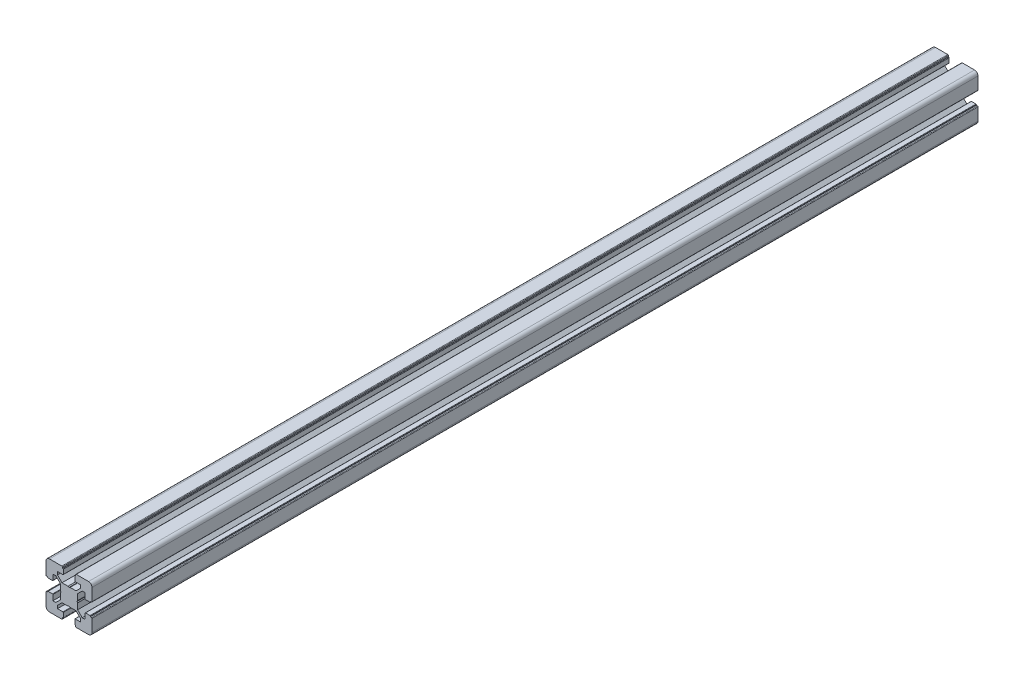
ISO-10303-21;
HEADER;
FILE_DESCRIPTION(('STEP AP214'),'2;1');
FILE_NAME('part.step','',(''),(''),'','','');
FILE_SCHEMA(('AUTOMOTIVE_DESIGN { 1 0 10303 214 1 1 1 1 }'));
ENDSEC;
DATA;
#1=APPLICATION_CONTEXT('core data for automotive mechanical design processes');
#2=APPLICATION_PROTOCOL_DEFINITION('international standard','automotive_design',2000,#1);
#3=PRODUCT_CONTEXT('',#1,'mechanical');
#4=PRODUCT('Part','Part','',(#3));
#5=PRODUCT_RELATED_PRODUCT_CATEGORY('part','',(#4));
#6=PRODUCT_DEFINITION_FORMATION('','',#4);
#7=PRODUCT_DEFINITION_CONTEXT('part definition',#1,'design');
#8=PRODUCT_DEFINITION('design','',#6,#7);
#9=PRODUCT_DEFINITION_SHAPE('','',#8);
#10=(LENGTH_UNIT() NAMED_UNIT(*) SI_UNIT(.MILLI.,.METRE.));
#11=(NAMED_UNIT(*) PLANE_ANGLE_UNIT() SI_UNIT($,.RADIAN.));
#12=(NAMED_UNIT(*) SI_UNIT($,.STERADIAN.) SOLID_ANGLE_UNIT());
#13=UNCERTAINTY_MEASURE_WITH_UNIT(LENGTH_MEASURE(1.E-05),#10,'distance_accuracy_value','');
#14=(GEOMETRIC_REPRESENTATION_CONTEXT(3) GLOBAL_UNCERTAINTY_ASSIGNED_CONTEXT((#13)) GLOBAL_UNIT_ASSIGNED_CONTEXT((#10,
#11,#12)) REPRESENTATION_CONTEXT('',''));
#15=CARTESIAN_POINT('',(0.,0.,0.));
#16=DIRECTION('',(0.,0.,1.));
#17=DIRECTION('',(1.,0.,0.));
#18=AXIS2_PLACEMENT_3D('',#15,#16,#17);
#19=CARTESIAN_POINT('',(-12.5999333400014,39.4999999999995,770.));
#20=DIRECTION('',(0.,0.,-1.));
#21=DIRECTION('',(-1.,0.,0.));
#22=AXIS2_PLACEMENT_3D('',#19,#20,#21);
#23=CYLINDRICAL_SURFACE('',#22,0.50000000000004);
#24=CARTESIAN_POINT('',(-12.5999333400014,39.4999999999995,0.));
#25=DIRECTION('',(0.,0.,1.));
#26=DIRECTION('',(1.,0.,0.));
#27=AXIS2_PLACEMENT_3D('',#24,#25,#26);
#28=CIRCLE('',#27,0.50000000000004);
#29=CARTESIAN_POINT('',(-12.0999333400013,39.5,0.));
#30=VERTEX_POINT('',#29);
#31=CARTESIAN_POINT('',(-12.5999333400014,39.9999999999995,0.));
#32=VERTEX_POINT('',#31);
#33=EDGE_CURVE('E700',#30,#32,#28,.T.);
#34=ORIENTED_EDGE('',*,*,#33,.T.);
#35=DIRECTION('',(0.,0.,-1.));
#36=VECTOR('',#35,1.);
#37=CARTESIAN_POINT('',(-12.5999333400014,39.9999999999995,770.));
#38=LINE('',#37,#36);
#39=CARTESIAN_POINT('',(-12.5999333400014,39.9999999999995,770.));
#40=VERTEX_POINT('',#39);
#41=EDGE_CURVE('E11',#40,#32,#38,.T.);
#42=ORIENTED_EDGE('',*,*,#41,.F.);
#43=CARTESIAN_POINT('',(-12.5999333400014,39.4999999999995,770.));
#44=DIRECTION('',(0.,0.,1.));
#45=DIRECTION('',(1.,0.,0.));
#46=AXIS2_PLACEMENT_3D('',#43,#44,#45);
#47=CIRCLE('',#46,0.50000000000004);
#48=CARTESIAN_POINT('',(-12.0999333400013,39.5,770.));
#49=VERTEX_POINT('',#48);
#50=EDGE_CURVE('E998',#49,#40,#47,.T.);
#51=ORIENTED_EDGE('',*,*,#50,.F.);
#52=DIRECTION('',(0.,0.,-1.));
#53=VECTOR('',#52,1.);
#54=CARTESIAN_POINT('',(-12.0999333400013,39.5,770.));
#55=LINE('',#54,#53);
#56=EDGE_CURVE('E696',#49,#30,#55,.T.);
#57=ORIENTED_EDGE('',*,*,#56,.T.);
#58=EDGE_LOOP('',(#34,#42,#51,#57));
#59=FACE_BOUND('',#58,.T.);
#60=ADVANCED_FACE('F47',(#59),#23,.T.);
#61=CARTESIAN_POINT('',(-12.5999333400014,39.9999999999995,770.));
#62=DIRECTION('',(0.,-1.,0.));
#63=DIRECTION('',(1.,0.,0.));
#64=AXIS2_PLACEMENT_3D('',#61,#62,#63);
#65=PLANE('',#64);
#66=DIRECTION('',(-1.,0.,0.));
#67=VECTOR('',#66,1.);
#68=CARTESIAN_POINT('',(-12.5999333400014,39.9999999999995,0.));
#69=LINE('',#68,#67);
#70=CARTESIAN_POINT('',(-23.2999666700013,39.9999999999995,0.));
#71=VERTEX_POINT('',#70);
#72=EDGE_CURVE('E704',#32,#71,#69,.T.);
#73=ORIENTED_EDGE('',*,*,#72,.T.);
#74=DIRECTION('',(0.,0.,-1.));
#75=VECTOR('',#74,1.);
#76=CARTESIAN_POINT('',(-23.2999666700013,39.9999999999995,770.));
#77=LINE('',#76,#75);
#78=CARTESIAN_POINT('',(-23.2999666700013,39.9999999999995,770.));
#79=VERTEX_POINT('',#78);
#80=EDGE_CURVE('E56',#79,#71,#77,.T.);
#81=ORIENTED_EDGE('',*,*,#80,.F.);
#82=DIRECTION('',(-1.,0.,0.));
#83=VECTOR('',#82,1.);
#84=CARTESIAN_POINT('',(-12.5999333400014,39.9999999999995,770.));
#85=LINE('',#84,#83);
#86=EDGE_CURVE('E383',#40,#79,#85,.T.);
#87=ORIENTED_EDGE('',*,*,#86,.F.);
#88=ORIENTED_EDGE('',*,*,#41,.T.);
#89=EDGE_LOOP('',(#73,#81,#87,#88));
#90=FACE_BOUND('',#89,.T.);
#91=ADVANCED_FACE('F1708',(#90),#65,.F.);
#92=CARTESIAN_POINT('',(-23.299966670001,36.9999999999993,770.));
#93=DIRECTION('',(0.,0.,-1.));
#94=DIRECTION('',(-1.,0.,0.));
#95=AXIS2_PLACEMENT_3D('',#92,#93,#94);
#96=CYLINDRICAL_SURFACE('',#95,3.00000000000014);
#97=CARTESIAN_POINT('',(-23.299966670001,36.9999999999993,0.));
#98=DIRECTION('',(0.,0.,1.));
#99=DIRECTION('',(1.,0.,0.));
#100=AXIS2_PLACEMENT_3D('',#97,#98,#99);
#101=CIRCLE('',#100,3.00000000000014);
#102=CARTESIAN_POINT('',(-26.2999666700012,36.9999999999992,0.));
#103=VERTEX_POINT('',#102);
#104=EDGE_CURVE('E707',#71,#103,#101,.T.);
#105=ORIENTED_EDGE('',*,*,#104,.T.);
#106=DIRECTION('',(0.,0.,-1.));
#107=VECTOR('',#106,1.);
#108=CARTESIAN_POINT('',(-26.2999666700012,36.9999999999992,770.));
#109=LINE('',#108,#107);
#110=CARTESIAN_POINT('',(-26.2999666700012,36.9999999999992,770.));
#111=VERTEX_POINT('',#110);
#112=EDGE_CURVE('E1377',#111,#103,#109,.T.);
#113=ORIENTED_EDGE('',*,*,#112,.F.);
#114=CARTESIAN_POINT('',(-23.299966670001,36.9999999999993,770.));
#115=DIRECTION('',(0.,0.,1.));
#116=DIRECTION('',(1.,0.,0.));
#117=AXIS2_PLACEMENT_3D('',#114,#115,#116);
#118=CIRCLE('',#117,3.00000000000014);
#119=EDGE_CURVE('E1387',#79,#111,#118,.T.);
#120=ORIENTED_EDGE('',*,*,#119,.F.);
#121=ORIENTED_EDGE('',*,*,#80,.T.);
#122=EDGE_LOOP('',(#105,#113,#120,#121));
#123=FACE_BOUND('',#122,.T.);
#124=ADVANCED_FACE('F1385',(#123),#96,.T.);
#125=CARTESIAN_POINT('',(-26.2999666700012,36.9999999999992,770.));
#126=DIRECTION('',(1.,0.,0.));
#127=DIRECTION('',(0.,1.,0.));
#128=AXIS2_PLACEMENT_3D('',#125,#126,#127);
#129=PLANE('',#128);
#130=DIRECTION('',(0.,-1.,0.));
#131=VECTOR('',#130,1.);
#132=CARTESIAN_POINT('',(-26.2999666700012,36.9999999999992,0.));
#133=LINE('',#132,#131);
#134=CARTESIAN_POINT('',(-26.2999666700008,26.3000333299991,0.));
#135=VERTEX_POINT('',#134);
#136=EDGE_CURVE('E710',#103,#135,#133,.T.);
#137=ORIENTED_EDGE('',*,*,#136,.T.);
#138=DIRECTION('',(0.,0.,-1.));
#139=VECTOR('',#138,1.);
#140=CARTESIAN_POINT('',(-26.2999666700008,26.3000333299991,770.));
#141=LINE('',#140,#139);
#142=CARTESIAN_POINT('',(-26.2999666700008,26.3000333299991,770.));
#143=VERTEX_POINT('',#142);
#144=EDGE_CURVE('E1373',#143,#135,#141,.T.);
#145=ORIENTED_EDGE('',*,*,#144,.F.);
#146=DIRECTION('',(0.,-1.,0.));
#147=VECTOR('',#146,1.);
#148=CARTESIAN_POINT('',(-26.2999666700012,36.9999999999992,770.));
#149=LINE('',#148,#147);
#150=EDGE_CURVE('E1406',#111,#143,#149,.T.);
#151=ORIENTED_EDGE('',*,*,#150,.F.);
#152=ORIENTED_EDGE('',*,*,#112,.T.);
#153=EDGE_LOOP('',(#137,#145,#151,#152));
#154=FACE_BOUND('',#153,.T.);
#155=ADVANCED_FACE('F1396',(#154),#129,.F.);
#156=CARTESIAN_POINT('',(-25.7999666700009,26.3000333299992,770.));
#157=DIRECTION('',(0.,0.,-1.));
#158=DIRECTION('',(-1.,0.,0.));
#159=AXIS2_PLACEMENT_3D('',#156,#157,#158);
#160=CYLINDRICAL_SURFACE('',#159,0.499999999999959);
#161=CARTESIAN_POINT('',(-25.7999666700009,26.3000333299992,0.));
#162=DIRECTION('',(0.,0.,1.));
#163=DIRECTION('',(1.,0.,0.));
#164=AXIS2_PLACEMENT_3D('',#161,#162,#163);
#165=CIRCLE('',#164,0.499999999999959);
#166=CARTESIAN_POINT('',(-25.7999666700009,25.8000333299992,0.));
#167=VERTEX_POINT('',#166);
#168=EDGE_CURVE('E713',#135,#167,#165,.T.);
#169=ORIENTED_EDGE('',*,*,#168,.T.);
#170=DIRECTION('',(0.,0.,-1.));
#171=VECTOR('',#170,1.);
#172=CARTESIAN_POINT('',(-25.7999666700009,25.8000333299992,770.));
#173=LINE('',#172,#171);
#174=CARTESIAN_POINT('',(-25.7999666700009,25.8000333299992,770.));
#175=VERTEX_POINT('',#174);
#176=EDGE_CURVE('E1369',#175,#167,#173,.T.);
#177=ORIENTED_EDGE('',*,*,#176,.F.);
#178=CARTESIAN_POINT('',(-25.7999666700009,26.3000333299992,770.));
#179=DIRECTION('',(0.,0.,1.));
#180=DIRECTION('',(1.,0.,0.));
#181=AXIS2_PLACEMENT_3D('',#178,#179,#180);
#182=CIRCLE('',#181,0.499999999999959);
#183=EDGE_CURVE('E1402',#143,#175,#182,.T.);
#184=ORIENTED_EDGE('',*,*,#183,.F.);
#185=ORIENTED_EDGE('',*,*,#144,.T.);
#186=EDGE_LOOP('',(#169,#177,#184,#185));
#187=FACE_BOUND('',#186,.T.);
#188=ADVANCED_FACE('F1400',(#187),#160,.T.);
#189=CARTESIAN_POINT('',(-25.7999666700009,25.8000333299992,770.));
#190=DIRECTION('',(0.,1.,0.));
#191=DIRECTION('',(-1.,0.,0.));
#192=AXIS2_PLACEMENT_3D('',#189,#190,#191);
#193=PLANE('',#192);
#194=DIRECTION('',(1.,0.,0.));
#195=VECTOR('',#194,1.);
#196=CARTESIAN_POINT('',(-25.7999666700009,25.8000333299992,0.));
#197=LINE('',#196,#195);
#198=CARTESIAN_POINT('',(-24.7999666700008,25.8000333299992,0.));
#199=VERTEX_POINT('',#198);
#200=EDGE_CURVE('E716',#167,#199,#197,.T.);
#201=ORIENTED_EDGE('',*,*,#200,.T.);
#202=DIRECTION('',(0.,0.,-1.));
#203=VECTOR('',#202,1.);
#204=CARTESIAN_POINT('',(-24.7999666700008,25.8000333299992,770.));
#205=LINE('',#204,#203);
#206=CARTESIAN_POINT('',(-24.7999666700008,25.8000333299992,770.));
#207=VERTEX_POINT('',#206);
#208=EDGE_CURVE('E1365',#207,#199,#205,.T.);
#209=ORIENTED_EDGE('',*,*,#208,.F.);
#210=DIRECTION('',(1.,0.,0.));
#211=VECTOR('',#210,1.);
#212=CARTESIAN_POINT('',(-25.7999666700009,25.8000333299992,770.));
#213=LINE('',#212,#211);
#214=EDGE_CURVE('E1405',#175,#207,#213,.T.);
#215=ORIENTED_EDGE('',*,*,#214,.F.);
#216=ORIENTED_EDGE('',*,*,#176,.T.);
#217=EDGE_LOOP('',(#201,#209,#215,#216));
#218=FACE_BOUND('',#217,.T.);
#219=ADVANCED_FACE('F1721',(#218),#193,.F.);
#220=CARTESIAN_POINT('',(-24.7999666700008,25.8000333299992,770.));
#221=DIRECTION('',(1.,0.,0.));
#222=DIRECTION('',(0.,1.,0.));
#223=AXIS2_PLACEMENT_3D('',#220,#221,#222);
#224=PLANE('',#223);
#225=DIRECTION('',(0.,-1.,0.));
#226=VECTOR('',#225,1.);
#227=CARTESIAN_POINT('',(-24.7999666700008,25.8000333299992,0.));
#228=LINE('',#227,#226);
#229=CARTESIAN_POINT('',(-24.7999666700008,25.3000333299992,0.));
#230=VERTEX_POINT('',#229);
#231=EDGE_CURVE('E719',#199,#230,#228,.T.);
#232=ORIENTED_EDGE('',*,*,#231,.T.);
#233=DIRECTION('',(0.,0.,-1.));
#234=VECTOR('',#233,1.);
#235=CARTESIAN_POINT('',(-24.7999666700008,25.3000333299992,770.));
#236=LINE('',#235,#234);
#237=CARTESIAN_POINT('',(-24.7999666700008,25.3000333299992,770.));
#238=VERTEX_POINT('',#237);
#239=EDGE_CURVE('E1361',#238,#230,#236,.T.);
#240=ORIENTED_EDGE('',*,*,#239,.F.);
#241=DIRECTION('',(0.,-1.,0.));
#242=VECTOR('',#241,1.);
#243=CARTESIAN_POINT('',(-24.7999666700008,25.8000333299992,770.));
#244=LINE('',#243,#242);
#245=EDGE_CURVE('E1410',#207,#238,#244,.T.);
#246=ORIENTED_EDGE('',*,*,#245,.F.);
#247=ORIENTED_EDGE('',*,*,#208,.T.);
#248=EDGE_LOOP('',(#232,#240,#246,#247));
#249=FACE_BOUND('',#248,.T.);
#250=ADVANCED_FACE('F1724',(#249),#224,.F.);
#251=CARTESIAN_POINT('',(-24.4999666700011,25.3000333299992,770.));
#252=DIRECTION('',(0.,0.,-1.));
#253=DIRECTION('',(-1.,0.,0.));
#254=AXIS2_PLACEMENT_3D('',#251,#252,#253);
#255=CYLINDRICAL_SURFACE('',#254,0.29999999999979);
#256=CARTESIAN_POINT('',(-24.4999666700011,25.3000333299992,0.));
#257=DIRECTION('',(0.,0.,1.));
#258=DIRECTION('',(1.,0.,0.));
#259=AXIS2_PLACEMENT_3D('',#256,#257,#258);
#260=CIRCLE('',#259,0.29999999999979);
#261=CARTESIAN_POINT('',(-24.4999666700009,25.0000333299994,0.));
#262=VERTEX_POINT('',#261);
#263=EDGE_CURVE('E722',#230,#262,#260,.T.);
#264=ORIENTED_EDGE('',*,*,#263,.T.);
#265=DIRECTION('',(0.,0.,-1.));
#266=VECTOR('',#265,1.);
#267=CARTESIAN_POINT('',(-24.4999666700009,25.0000333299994,770.));
#268=LINE('',#267,#266);
#269=CARTESIAN_POINT('',(-24.4999666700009,25.0000333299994,770.));
#270=VERTEX_POINT('',#269);
#271=EDGE_CURVE('E1357',#270,#262,#268,.T.);
#272=ORIENTED_EDGE('',*,*,#271,.F.);
#273=CARTESIAN_POINT('',(-24.4999666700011,25.3000333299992,770.));
#274=DIRECTION('',(0.,0.,1.));
#275=DIRECTION('',(1.,0.,0.));
#276=AXIS2_PLACEMENT_3D('',#273,#274,#275);
#277=CIRCLE('',#276,0.29999999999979);
#278=EDGE_CURVE('E1417',#238,#270,#277,.T.);
#279=ORIENTED_EDGE('',*,*,#278,.F.);
#280=ORIENTED_EDGE('',*,*,#239,.T.);
#281=EDGE_LOOP('',(#264,#272,#279,#280));
#282=FACE_BOUND('',#281,.T.);
#283=ADVANCED_FACE('F1728',(#282),#255,.T.);
#284=CARTESIAN_POINT('',(-24.4999666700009,25.0000333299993,770.));
#285=DIRECTION('',(0.,1.,0.));
#286=DIRECTION('',(-1.,0.,0.));
#287=AXIS2_PLACEMENT_3D('',#284,#285,#286);
#288=PLANE('',#287);
#289=DIRECTION('',(1.,0.,0.));
#290=VECTOR('',#289,1.);
#291=CARTESIAN_POINT('',(-24.4999666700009,25.0000333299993,0.));
#292=LINE('',#291,#290);
#293=CARTESIAN_POINT('',(-20.599966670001,25.0000333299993,0.));
#294=VERTEX_POINT('',#293);
#295=EDGE_CURVE('E725',#262,#294,#292,.T.);
#296=ORIENTED_EDGE('',*,*,#295,.T.);
#297=DIRECTION('',(0.,0.,-1.));
#298=VECTOR('',#297,1.);
#299=CARTESIAN_POINT('',(-20.599966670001,25.0000333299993,770.));
#300=LINE('',#299,#298);
#301=CARTESIAN_POINT('',(-20.599966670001,25.0000333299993,770.));
#302=VERTEX_POINT('',#301);
#303=EDGE_CURVE('E1353',#302,#294,#300,.T.);
#304=ORIENTED_EDGE('',*,*,#303,.F.);
#305=DIRECTION('',(1.,0.,0.));
#306=VECTOR('',#305,1.);
#307=CARTESIAN_POINT('',(-24.4999666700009,25.0000333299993,770.));
#308=LINE('',#307,#306);
#309=EDGE_CURVE('E1420',#270,#302,#308,.T.);
#310=ORIENTED_EDGE('',*,*,#309,.F.);
#311=ORIENTED_EDGE('',*,*,#271,.T.);
#312=EDGE_LOOP('',(#296,#304,#310,#311));
#313=FACE_BOUND('',#312,.T.);
#314=ADVANCED_FACE('F1732',(#313),#288,.F.);
#315=CARTESIAN_POINT('',(-20.5999666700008,25.3000333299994,770.));
#316=DIRECTION('',(0.,0.,-1.));
#317=DIRECTION('',(-1.,0.,0.));
#318=AXIS2_PLACEMENT_3D('',#315,#316,#317);
#319=CYLINDRICAL_SURFACE('',#318,0.300000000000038);
#320=CARTESIAN_POINT('',(-20.5999666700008,25.3000333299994,0.));
#321=DIRECTION('',(0.,0.,1.));
#322=DIRECTION('',(1.,0.,0.));
#323=AXIS2_PLACEMENT_3D('',#320,#321,#322);
#324=CIRCLE('',#323,0.300000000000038);
#325=CARTESIAN_POINT('',(-20.2999666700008,25.3000333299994,0.));
#326=VERTEX_POINT('',#325);
#327=EDGE_CURVE('E728',#294,#326,#324,.T.);
#328=ORIENTED_EDGE('',*,*,#327,.T.);
#329=DIRECTION('',(0.,0.,-1.));
#330=VECTOR('',#329,1.);
#331=CARTESIAN_POINT('',(-20.2999666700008,25.3000333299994,770.));
#332=LINE('',#331,#330);
#333=CARTESIAN_POINT('',(-20.2999666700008,25.3000333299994,770.));
#334=VERTEX_POINT('',#333);
#335=EDGE_CURVE('E1349',#334,#326,#332,.T.);
#336=ORIENTED_EDGE('',*,*,#335,.F.);
#337=CARTESIAN_POINT('',(-20.5999666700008,25.3000333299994,770.));
#338=DIRECTION('',(0.,0.,1.));
#339=DIRECTION('',(1.,0.,0.));
#340=AXIS2_PLACEMENT_3D('',#337,#338,#339);
#341=CIRCLE('',#340,0.300000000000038);
#342=EDGE_CURVE('E1423',#302,#334,#341,.T.);
#343=ORIENTED_EDGE('',*,*,#342,.F.);
#344=ORIENTED_EDGE('',*,*,#303,.T.);
#345=EDGE_LOOP('',(#328,#336,#343,#344));
#346=FACE_BOUND('',#345,.T.);
#347=ADVANCED_FACE('F1736',(#346),#319,.T.);
#348=CARTESIAN_POINT('',(-20.2999666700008,25.3000333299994,770.));
#349=DIRECTION('',(-1.,0.,0.));
#350=DIRECTION('',(0.,-1.,0.));
#351=AXIS2_PLACEMENT_3D('',#348,#349,#350);
#352=PLANE('',#351);
#353=DIRECTION('',(0.,1.,0.));
#354=VECTOR('',#353,1.);
#355=CARTESIAN_POINT('',(-20.2999666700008,25.3000333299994,0.));
#356=LINE('',#355,#354);
#357=CARTESIAN_POINT('',(-20.2999666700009,30.0501526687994,0.));
#358=VERTEX_POINT('',#357);
#359=EDGE_CURVE('E731',#326,#358,#356,.T.);
#360=ORIENTED_EDGE('',*,*,#359,.T.);
#361=DIRECTION('',(0.,0.,-1.));
#362=VECTOR('',#361,1.);
#363=CARTESIAN_POINT('',(-20.2999666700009,30.0501526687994,770.));
#364=LINE('',#363,#362);
#365=CARTESIAN_POINT('',(-20.2999666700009,30.0501526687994,770.));
#366=VERTEX_POINT('',#365);
#367=EDGE_CURVE('E1345',#366,#358,#364,.T.);
#368=ORIENTED_EDGE('',*,*,#367,.F.);
#369=DIRECTION('',(0.,1.,0.));
#370=VECTOR('',#369,1.);
#371=CARTESIAN_POINT('',(-20.2999666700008,25.3000333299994,770.));
#372=LINE('',#371,#370);
#373=EDGE_CURVE('E1426',#334,#366,#372,.T.);
#374=ORIENTED_EDGE('',*,*,#373,.F.);
#375=ORIENTED_EDGE('',*,*,#335,.T.);
#376=EDGE_LOOP('',(#360,#368,#374,#375));
#377=FACE_BOUND('',#376,.T.);
#378=ADVANCED_FACE('F1740',(#377),#352,.F.);
#379=CARTESIAN_POINT('',(-20.2999666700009,30.0501526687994,770.));
#380=DIRECTION('',(0.,1.,0.));
#381=DIRECTION('',(-1.,0.,0.));
#382=AXIS2_PLACEMENT_3D('',#379,#380,#381);
#383=PLANE('',#382);
#384=DIRECTION('',(1.,0.,0.));
#385=VECTOR('',#384,1.);
#386=CARTESIAN_POINT('',(-20.2999666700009,30.0501526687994,0.));
#387=LINE('',#386,#385);
#388=CARTESIAN_POINT('',(-17.7643329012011,30.0501526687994,0.));
#389=VERTEX_POINT('',#388);
#390=EDGE_CURVE('E734',#358,#389,#387,.T.);
#391=ORIENTED_EDGE('',*,*,#390,.T.);
#392=DIRECTION('',(0.,0.,-1.));
#393=VECTOR('',#392,1.);
#394=CARTESIAN_POINT('',(-17.7643329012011,30.0501526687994,770.));
#395=LINE('',#394,#393);
#396=CARTESIAN_POINT('',(-17.7643329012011,30.0501526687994,770.));
#397=VERTEX_POINT('',#396);
#398=EDGE_CURVE('E1341',#397,#389,#395,.T.);
#399=ORIENTED_EDGE('',*,*,#398,.F.);
#400=DIRECTION('',(1.,0.,0.));
#401=VECTOR('',#400,1.);
#402=CARTESIAN_POINT('',(-20.2999666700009,30.0501526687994,770.));
#403=LINE('',#402,#401);
#404=EDGE_CURVE('E1429',#366,#397,#403,.T.);
#405=ORIENTED_EDGE('',*,*,#404,.F.);
#406=ORIENTED_EDGE('',*,*,#367,.T.);
#407=EDGE_LOOP('',(#391,#399,#405,#406));
#408=FACE_BOUND('',#407,.T.);
#409=ADVANCED_FACE('F1744',(#408),#383,.F.);
#410=CARTESIAN_POINT('',(-17.7643329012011,30.0501526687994,770.));
#411=DIRECTION('',(0.707106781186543,0.707106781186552,0.));
#412=DIRECTION('',(-0.707106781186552,0.707106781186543,0.));
#413=AXIS2_PLACEMENT_3D('',#410,#411,#412);
#414=PLANE('',#413);
#415=DIRECTION('',(0.707106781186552,-0.707106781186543,0.));
#416=VECTOR('',#415,1.);
#417=CARTESIAN_POINT('',(-17.7643329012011,30.0501526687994,0.));
#418=LINE('',#417,#416);
#419=CARTESIAN_POINT('',(-13.799856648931,26.0856764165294,0.));
#420=VERTEX_POINT('',#419);
#421=EDGE_CURVE('E737',#389,#420,#418,.T.);
#422=ORIENTED_EDGE('',*,*,#421,.T.);
#423=DIRECTION('',(0.,0.,-1.));
#424=VECTOR('',#423,1.);
#425=CARTESIAN_POINT('',(-13.799856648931,26.0856764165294,770.));
#426=LINE('',#425,#424);
#427=CARTESIAN_POINT('',(-13.799856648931,26.0856764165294,770.));
#428=VERTEX_POINT('',#427);
#429=EDGE_CURVE('E1337',#428,#420,#426,.T.);
#430=ORIENTED_EDGE('',*,*,#429,.F.);
#431=DIRECTION('',(0.707106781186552,-0.707106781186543,0.));
#432=VECTOR('',#431,1.);
#433=CARTESIAN_POINT('',(-17.7643329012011,30.0501526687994,770.));
#434=LINE('',#433,#432);
#435=EDGE_CURVE('E1432',#397,#428,#434,.T.);
#436=ORIENTED_EDGE('',*,*,#435,.F.);
#437=ORIENTED_EDGE('',*,*,#398,.T.);
#438=EDGE_LOOP('',(#422,#430,#436,#437));
#439=FACE_BOUND('',#438,.T.);
#440=ADVANCED_FACE('F1748',(#439),#414,.F.);
#441=CARTESIAN_POINT('',(-13.799856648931,26.0856764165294,770.));
#442=DIRECTION('',(1.,0.,0.));
#443=DIRECTION('',(0.,1.,0.));
#444=AXIS2_PLACEMENT_3D('',#441,#442,#443);
#445=PLANE('',#444);
#446=DIRECTION('',(0.,-1.,0.));
#447=VECTOR('',#446,1.);
#448=CARTESIAN_POINT('',(-13.799856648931,26.0856764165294,0.));
#449=LINE('',#448,#447);
#450=CARTESIAN_POINT('',(-13.7998566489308,20.8660254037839,0.));
#451=VERTEX_POINT('',#450);
#452=EDGE_CURVE('E740',#420,#451,#449,.T.);
#453=ORIENTED_EDGE('',*,*,#452,.T.);
#454=DIRECTION('',(0.,0.,-1.));
#455=VECTOR('',#454,1.);
#456=CARTESIAN_POINT('',(-13.7998566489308,20.8660254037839,770.));
#457=LINE('',#456,#455);
#458=CARTESIAN_POINT('',(-13.7998566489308,20.8660254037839,770.));
#459=VERTEX_POINT('',#458);
#460=EDGE_CURVE('E1333',#459,#451,#457,.T.);
#461=ORIENTED_EDGE('',*,*,#460,.F.);
#462=DIRECTION('',(0.,-1.,0.));
#463=VECTOR('',#462,1.);
#464=CARTESIAN_POINT('',(-13.799856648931,26.0856764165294,770.));
#465=LINE('',#464,#463);
#466=EDGE_CURVE('E1435',#428,#459,#465,.T.);
#467=ORIENTED_EDGE('',*,*,#466,.F.);
#468=ORIENTED_EDGE('',*,*,#429,.T.);
#469=EDGE_LOOP('',(#453,#461,#467,#468));
#470=FACE_BOUND('',#469,.T.);
#471=ADVANCED_FACE('F1752',(#470),#445,.F.);
#472=CARTESIAN_POINT('',(-13.7998566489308,20.8660254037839,770.));
#473=DIRECTION('',(0.8660254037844,0.500000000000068,0.));
#474=DIRECTION('',(-0.500000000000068,0.8660254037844,0.));
#475=AXIS2_PLACEMENT_3D('',#472,#473,#474);
#476=PLANE('',#475);
#477=DIRECTION('',(0.500000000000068,-0.8660254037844,0.));
#478=VECTOR('',#477,1.);
#479=CARTESIAN_POINT('',(-13.7998566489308,20.8660254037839,0.));
#480=LINE('',#479,#478);
#481=CARTESIAN_POINT('',(-13.2998566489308,19.9999999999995,0.));
#482=VERTEX_POINT('',#481);
#483=EDGE_CURVE('E743',#451,#482,#480,.T.);
#484=ORIENTED_EDGE('',*,*,#483,.T.);
#485=DIRECTION('',(0.,0.,-1.));
#486=VECTOR('',#485,1.);
#487=CARTESIAN_POINT('',(-13.2998566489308,19.9999999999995,770.));
#488=LINE('',#487,#486);
#489=CARTESIAN_POINT('',(-13.2998566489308,19.9999999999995,770.));
#490=VERTEX_POINT('',#489);
#491=EDGE_CURVE('E1329',#490,#482,#488,.T.);
#492=ORIENTED_EDGE('',*,*,#491,.F.);
#493=DIRECTION('',(0.500000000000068,-0.8660254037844,0.));
#494=VECTOR('',#493,1.);
#495=CARTESIAN_POINT('',(-13.7998566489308,20.8660254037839,770.));
#496=LINE('',#495,#494);
#497=EDGE_CURVE('E1438',#459,#490,#496,.T.);
#498=ORIENTED_EDGE('',*,*,#497,.F.);
#499=ORIENTED_EDGE('',*,*,#460,.T.);
#500=EDGE_LOOP('',(#484,#492,#498,#499));
#501=FACE_BOUND('',#500,.T.);
#502=ADVANCED_FACE('F1756',(#501),#476,.F.);
#503=CARTESIAN_POINT('',(-13.2998566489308,19.9999999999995,770.));
#504=DIRECTION('',(0.866025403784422,-0.500000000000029,0.));
#505=DIRECTION('',(0.500000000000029,0.866025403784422,0.));
#506=AXIS2_PLACEMENT_3D('',#503,#504,#505);
#507=PLANE('',#506);
#508=DIRECTION('',(-0.500000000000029,-0.866025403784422,0.));
#509=VECTOR('',#508,1.);
#510=CARTESIAN_POINT('',(-13.2998566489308,19.9999999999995,0.));
#511=LINE('',#510,#509);
#512=CARTESIAN_POINT('',(-13.7998566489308,19.1339745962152,0.));
#513=VERTEX_POINT('',#512);
#514=EDGE_CURVE('E746',#482,#513,#511,.T.);
#515=ORIENTED_EDGE('',*,*,#514,.T.);
#516=DIRECTION('',(0.,0.,-1.));
#517=VECTOR('',#516,1.);
#518=CARTESIAN_POINT('',(-13.7998566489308,19.1339745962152,770.));
#519=LINE('',#518,#517);
#520=CARTESIAN_POINT('',(-13.7998566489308,19.1339745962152,770.));
#521=VERTEX_POINT('',#520);
#522=EDGE_CURVE('E1325',#521,#513,#519,.T.);
#523=ORIENTED_EDGE('',*,*,#522,.F.);
#524=DIRECTION('',(-0.500000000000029,-0.866025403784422,0.));
#525=VECTOR('',#524,1.);
#526=CARTESIAN_POINT('',(-13.2998566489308,19.9999999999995,770.));
#527=LINE('',#526,#525);
#528=EDGE_CURVE('E1441',#490,#521,#527,.T.);
#529=ORIENTED_EDGE('',*,*,#528,.F.);
#530=ORIENTED_EDGE('',*,*,#491,.T.);
#531=EDGE_LOOP('',(#515,#523,#529,#530));
#532=FACE_BOUND('',#531,.T.);
#533=ADVANCED_FACE('F1760',(#532),#507,.F.);
#534=CARTESIAN_POINT('',(-13.7998566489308,19.1339745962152,770.));
#535=DIRECTION('',(1.,0.,0.));
#536=DIRECTION('',(0.,1.,0.));
#537=AXIS2_PLACEMENT_3D('',#534,#535,#536);
#538=PLANE('',#537);
#539=DIRECTION('',(0.,-1.,0.));
#540=VECTOR('',#539,1.);
#541=CARTESIAN_POINT('',(-13.7998566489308,19.1339745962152,0.));
#542=LINE('',#541,#540);
#543=CARTESIAN_POINT('',(-13.7998566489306,13.9143235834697,0.));
#544=VERTEX_POINT('',#543);
#545=EDGE_CURVE('E749',#513,#544,#542,.T.);
#546=ORIENTED_EDGE('',*,*,#545,.T.);
#547=DIRECTION('',(0.,0.,-1.));
#548=VECTOR('',#547,1.);
#549=CARTESIAN_POINT('',(-13.7998566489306,13.9143235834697,770.));
#550=LINE('',#549,#548);
#551=CARTESIAN_POINT('',(-13.7998566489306,13.9143235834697,770.));
#552=VERTEX_POINT('',#551);
#553=EDGE_CURVE('E1321',#552,#544,#550,.T.);
#554=ORIENTED_EDGE('',*,*,#553,.F.);
#555=DIRECTION('',(0.,-1.,0.));
#556=VECTOR('',#555,1.);
#557=CARTESIAN_POINT('',(-13.7998566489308,19.1339745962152,770.));
#558=LINE('',#557,#556);
#559=EDGE_CURVE('E1444',#521,#552,#558,.T.);
#560=ORIENTED_EDGE('',*,*,#559,.F.);
#561=ORIENTED_EDGE('',*,*,#522,.T.);
#562=EDGE_LOOP('',(#546,#554,#560,#561));
#563=FACE_BOUND('',#562,.T.);
#564=ADVANCED_FACE('F1764',(#563),#538,.F.);
#565=CARTESIAN_POINT('',(-13.7998566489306,13.9143235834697,770.));
#566=DIRECTION('',(0.707106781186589,-0.707106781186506,0.));
#567=DIRECTION('',(0.707106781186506,0.707106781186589,0.));
#568=AXIS2_PLACEMENT_3D('',#565,#566,#567);
#569=PLANE('',#568);
#570=DIRECTION('',(-0.707106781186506,-0.707106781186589,0.));
#571=VECTOR('',#570,1.);
#572=CARTESIAN_POINT('',(-13.7998566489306,13.9143235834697,0.));
#573=LINE('',#572,#571);
#574=CARTESIAN_POINT('',(-17.7642662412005,9.9499139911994,0.));
#575=VERTEX_POINT('',#574);
#576=EDGE_CURVE('E752',#544,#575,#573,.T.);
#577=ORIENTED_EDGE('',*,*,#576,.T.);
#578=DIRECTION('',(0.,0.,-1.));
#579=VECTOR('',#578,1.);
#580=CARTESIAN_POINT('',(-17.7642662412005,9.9499139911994,770.));
#581=LINE('',#580,#579);
#582=CARTESIAN_POINT('',(-17.7642662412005,9.9499139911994,770.));
#583=VERTEX_POINT('',#582);
#584=EDGE_CURVE('E1317',#583,#575,#581,.T.);
#585=ORIENTED_EDGE('',*,*,#584,.F.);
#586=DIRECTION('',(-0.707106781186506,-0.707106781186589,0.));
#587=VECTOR('',#586,1.);
#588=CARTESIAN_POINT('',(-13.7998566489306,13.9143235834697,770.));
#589=LINE('',#588,#587);
#590=EDGE_CURVE('E1447',#552,#583,#589,.T.);
#591=ORIENTED_EDGE('',*,*,#590,.F.);
#592=ORIENTED_EDGE('',*,*,#553,.T.);
#593=EDGE_LOOP('',(#577,#585,#591,#592));
#594=FACE_BOUND('',#593,.T.);
#595=ADVANCED_FACE('F1768',(#594),#569,.F.);
#596=CARTESIAN_POINT('',(-17.7642662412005,9.9499139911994,770.));
#597=DIRECTION('',(0.,-1.,0.));
#598=DIRECTION('',(1.,0.,0.));
#599=AXIS2_PLACEMENT_3D('',#596,#597,#598);
#600=PLANE('',#599);
#601=DIRECTION('',(-1.,0.,0.));
#602=VECTOR('',#601,1.);
#603=CARTESIAN_POINT('',(-17.7642662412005,9.9499139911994,0.));
#604=LINE('',#603,#602);
#605=CARTESIAN_POINT('',(-20.2999666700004,9.94991399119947,0.));
#606=VERTEX_POINT('',#605);
#607=EDGE_CURVE('E755',#575,#606,#604,.T.);
#608=ORIENTED_EDGE('',*,*,#607,.T.);
#609=DIRECTION('',(0.,0.,-1.));
#610=VECTOR('',#609,1.);
#611=CARTESIAN_POINT('',(-20.2999666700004,9.94991399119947,770.));
#612=LINE('',#611,#610);
#613=CARTESIAN_POINT('',(-20.2999666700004,9.94991399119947,770.));
#614=VERTEX_POINT('',#613);
#615=EDGE_CURVE('E1313',#614,#606,#612,.T.);
#616=ORIENTED_EDGE('',*,*,#615,.F.);
#617=DIRECTION('',(-1.,0.,0.));
#618=VECTOR('',#617,1.);
#619=CARTESIAN_POINT('',(-17.7642662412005,9.9499139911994,770.));
#620=LINE('',#619,#618);
#621=EDGE_CURVE('E1450',#583,#614,#620,.T.);
#622=ORIENTED_EDGE('',*,*,#621,.F.);
#623=ORIENTED_EDGE('',*,*,#584,.T.);
#624=EDGE_LOOP('',(#608,#616,#622,#623));
#625=FACE_BOUND('',#624,.T.);
#626=ADVANCED_FACE('F1772',(#625),#600,.F.);
#627=CARTESIAN_POINT('',(-20.2999666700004,9.94991399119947,770.));
#628=DIRECTION('',(-1.,0.,0.));
#629=DIRECTION('',(0.,-1.,0.));
#630=AXIS2_PLACEMENT_3D('',#627,#628,#629);
#631=PLANE('',#630);
#632=DIRECTION('',(0.,1.,0.));
#633=VECTOR('',#632,1.);
#634=CARTESIAN_POINT('',(-20.2999666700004,9.94991399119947,0.));
#635=LINE('',#634,#633);
#636=CARTESIAN_POINT('',(-20.2999666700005,14.7000333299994,0.));
#637=VERTEX_POINT('',#636);
#638=EDGE_CURVE('E758',#606,#637,#635,.T.);
#639=ORIENTED_EDGE('',*,*,#638,.T.);
#640=DIRECTION('',(0.,0.,-1.));
#641=VECTOR('',#640,1.);
#642=CARTESIAN_POINT('',(-20.2999666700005,14.7000333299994,770.));
#643=LINE('',#642,#641);
#644=CARTESIAN_POINT('',(-20.2999666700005,14.7000333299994,770.));
#645=VERTEX_POINT('',#644);
#646=EDGE_CURVE('E1309',#645,#637,#643,.T.);
#647=ORIENTED_EDGE('',*,*,#646,.F.);
#648=DIRECTION('',(0.,1.,0.));
#649=VECTOR('',#648,1.);
#650=CARTESIAN_POINT('',(-20.2999666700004,9.94991399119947,770.));
#651=LINE('',#650,#649);
#652=EDGE_CURVE('E1453',#614,#645,#651,.T.);
#653=ORIENTED_EDGE('',*,*,#652,.F.);
#654=ORIENTED_EDGE('',*,*,#615,.T.);
#655=EDGE_LOOP('',(#639,#647,#653,#654));
#656=FACE_BOUND('',#655,.T.);
#657=ADVANCED_FACE('F1776',(#656),#631,.F.);
#658=CARTESIAN_POINT('',(-20.5999666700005,14.7000333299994,770.));
#659=DIRECTION('',(0.,0.,-1.));
#660=DIRECTION('',(-1.,0.,0.));
#661=AXIS2_PLACEMENT_3D('',#658,#659,#660);
#662=CYLINDRICAL_SURFACE('',#661,0.299999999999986);
#663=CARTESIAN_POINT('',(-20.5999666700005,14.7000333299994,0.));
#664=DIRECTION('',(0.,0.,1.));
#665=DIRECTION('',(1.,0.,0.));
#666=AXIS2_PLACEMENT_3D('',#663,#664,#665);
#667=CIRCLE('',#666,0.299999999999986);
#668=CARTESIAN_POINT('',(-20.5999666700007,15.0000333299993,0.));
#669=VERTEX_POINT('',#668);
#670=EDGE_CURVE('E761',#637,#669,#667,.T.);
#671=ORIENTED_EDGE('',*,*,#670,.T.);
#672=DIRECTION('',(0.,0.,-1.));
#673=VECTOR('',#672,1.);
#674=CARTESIAN_POINT('',(-20.5999666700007,15.0000333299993,770.));
#675=LINE('',#674,#673);
#676=CARTESIAN_POINT('',(-20.5999666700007,15.0000333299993,770.));
#677=VERTEX_POINT('',#676);
#678=EDGE_CURVE('E1305',#677,#669,#675,.T.);
#679=ORIENTED_EDGE('',*,*,#678,.F.);
#680=CARTESIAN_POINT('',(-20.5999666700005,14.7000333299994,770.));
#681=DIRECTION('',(0.,0.,1.));
#682=DIRECTION('',(1.,0.,0.));
#683=AXIS2_PLACEMENT_3D('',#680,#681,#682);
#684=CIRCLE('',#683,0.299999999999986);
#685=EDGE_CURVE('E1456',#645,#677,#684,.T.);
#686=ORIENTED_EDGE('',*,*,#685,.F.);
#687=ORIENTED_EDGE('',*,*,#646,.T.);
#688=EDGE_LOOP('',(#671,#679,#686,#687));
#689=FACE_BOUND('',#688,.T.);
#690=ADVANCED_FACE('F1780',(#689),#662,.T.);
#691=CARTESIAN_POINT('',(-20.5999666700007,15.0000333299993,770.));
#692=DIRECTION('',(0.,-1.,0.));
#693=DIRECTION('',(1.,0.,0.));
#694=AXIS2_PLACEMENT_3D('',#691,#692,#693);
#695=PLANE('',#694);
#696=DIRECTION('',(-1.,0.,0.));
#697=VECTOR('',#696,1.);
#698=CARTESIAN_POINT('',(-20.5999666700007,15.0000333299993,0.));
#699=LINE('',#698,#697);
#700=CARTESIAN_POINT('',(-24.4999666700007,15.0000333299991,0.));
#701=VERTEX_POINT('',#700);
#702=EDGE_CURVE('E764',#669,#701,#699,.T.);
#703=ORIENTED_EDGE('',*,*,#702,.T.);
#704=DIRECTION('',(0.,0.,-1.));
#705=VECTOR('',#704,1.);
#706=CARTESIAN_POINT('',(-24.4999666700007,15.0000333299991,770.));
#707=LINE('',#706,#705);
#708=CARTESIAN_POINT('',(-24.4999666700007,15.0000333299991,770.));
#709=VERTEX_POINT('',#708);
#710=EDGE_CURVE('E1301',#709,#701,#707,.T.);
#711=ORIENTED_EDGE('',*,*,#710,.F.);
#712=DIRECTION('',(-1.,0.,0.));
#713=VECTOR('',#712,1.);
#714=CARTESIAN_POINT('',(-20.5999666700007,15.0000333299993,770.));
#715=LINE('',#714,#713);
#716=EDGE_CURVE('E1459',#677,#709,#715,.T.);
#717=ORIENTED_EDGE('',*,*,#716,.F.);
#718=ORIENTED_EDGE('',*,*,#678,.T.);
#719=EDGE_LOOP('',(#703,#711,#717,#718));
#720=FACE_BOUND('',#719,.T.);
#721=ADVANCED_FACE('F1784',(#720),#695,.F.);
#722=CARTESIAN_POINT('',(-24.4999666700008,14.7000333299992,770.));
#723=DIRECTION('',(0.,0.,-1.));
#724=DIRECTION('',(-1.,0.,0.));
#725=AXIS2_PLACEMENT_3D('',#722,#723,#724);
#726=CYLINDRICAL_SURFACE('',#725,0.299999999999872);
#727=CARTESIAN_POINT('',(-24.4999666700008,14.7000333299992,0.));
#728=DIRECTION('',(0.,0.,1.));
#729=DIRECTION('',(1.,0.,0.));
#730=AXIS2_PLACEMENT_3D('',#727,#728,#729);
#731=CIRCLE('',#730,0.299999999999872);
#732=CARTESIAN_POINT('',(-24.7999666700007,14.7000333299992,0.));
#733=VERTEX_POINT('',#732);
#734=EDGE_CURVE('E767',#701,#733,#731,.T.);
#735=ORIENTED_EDGE('',*,*,#734,.T.);
#736=DIRECTION('',(0.,0.,-1.));
#737=VECTOR('',#736,1.);
#738=CARTESIAN_POINT('',(-24.7999666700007,14.7000333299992,770.));
#739=LINE('',#738,#737);
#740=CARTESIAN_POINT('',(-24.7999666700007,14.7000333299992,770.));
#741=VERTEX_POINT('',#740);
#742=EDGE_CURVE('E1297',#741,#733,#739,.T.);
#743=ORIENTED_EDGE('',*,*,#742,.F.);
#744=CARTESIAN_POINT('',(-24.4999666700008,14.7000333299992,770.));
#745=DIRECTION('',(0.,0.,1.));
#746=DIRECTION('',(1.,0.,0.));
#747=AXIS2_PLACEMENT_3D('',#744,#745,#746);
#748=CIRCLE('',#747,0.299999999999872);
#749=EDGE_CURVE('E1462',#709,#741,#748,.T.);
#750=ORIENTED_EDGE('',*,*,#749,.F.);
#751=ORIENTED_EDGE('',*,*,#710,.T.);
#752=EDGE_LOOP('',(#735,#743,#750,#751));
#753=FACE_BOUND('',#752,.T.);
#754=ADVANCED_FACE('F1788',(#753),#726,.T.);
#755=CARTESIAN_POINT('',(-24.7999666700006,14.7000333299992,770.));
#756=DIRECTION('',(1.,2.28983498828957E-13,0.));
#757=DIRECTION('',(-2.28983498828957E-13,1.,0.));
#758=AXIS2_PLACEMENT_3D('',#755,#756,#757);
#759=PLANE('',#758);
#760=DIRECTION('',(2.28983498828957E-13,-1.,0.));
#761=VECTOR('',#760,1.);
#762=CARTESIAN_POINT('',(-24.7999666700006,14.7000333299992,0.));
#763=LINE('',#762,#761);
#764=CARTESIAN_POINT('',(-24.7999666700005,14.2000333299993,0.));
#765=VERTEX_POINT('',#764);
#766=EDGE_CURVE('E770',#733,#765,#763,.T.);
#767=ORIENTED_EDGE('',*,*,#766,.T.);
#768=DIRECTION('',(0.,0.,-1.));
#769=VECTOR('',#768,1.);
#770=CARTESIAN_POINT('',(-24.7999666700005,14.2000333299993,770.));
#771=LINE('',#770,#769);
#772=CARTESIAN_POINT('',(-24.7999666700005,14.2000333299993,770.));
#773=VERTEX_POINT('',#772);
#774=EDGE_CURVE('E1293',#773,#765,#771,.T.);
#775=ORIENTED_EDGE('',*,*,#774,.F.);
#776=DIRECTION('',(2.28983498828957E-13,-1.,0.));
#777=VECTOR('',#776,1.);
#778=CARTESIAN_POINT('',(-24.7999666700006,14.7000333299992,770.));
#779=LINE('',#778,#777);
#780=EDGE_CURVE('E1465',#741,#773,#779,.T.);
#781=ORIENTED_EDGE('',*,*,#780,.F.);
#782=ORIENTED_EDGE('',*,*,#742,.T.);
#783=EDGE_LOOP('',(#767,#775,#781,#782));
#784=FACE_BOUND('',#783,.T.);
#785=ADVANCED_FACE('F1792',(#784),#759,.F.);
#786=CARTESIAN_POINT('',(-24.7999666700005,14.2000333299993,770.));
#787=DIRECTION('',(0.,-1.,0.));
#788=DIRECTION('',(0.,0.,-1.));
#789=AXIS2_PLACEMENT_3D('',#786,#787,#788);
#790=PLANE('',#789);
#791=DIRECTION('',(-1.,0.,0.));
#792=VECTOR('',#791,1.);
#793=CARTESIAN_POINT('',(-24.7999666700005,14.2000333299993,0.));
#794=LINE('',#793,#792);
#795=CARTESIAN_POINT('',(-25.7999666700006,14.2000333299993,0.));
#796=VERTEX_POINT('',#795);
#797=EDGE_CURVE('E773',#765,#796,#794,.T.);
#798=ORIENTED_EDGE('',*,*,#797,.T.);
#799=DIRECTION('',(0.,0.,-1.));
#800=VECTOR('',#799,1.);
#801=CARTESIAN_POINT('',(-25.7999666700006,14.2000333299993,770.));
#802=LINE('',#801,#800);
#803=CARTESIAN_POINT('',(-25.7999666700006,14.2000333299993,770.));
#804=VERTEX_POINT('',#803);
#805=EDGE_CURVE('E1289',#804,#796,#802,.T.);
#806=ORIENTED_EDGE('',*,*,#805,.F.);
#807=DIRECTION('',(-1.,0.,0.));
#808=VECTOR('',#807,1.);
#809=CARTESIAN_POINT('',(-24.7999666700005,14.2000333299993,770.));
#810=LINE('',#809,#808);
#811=EDGE_CURVE('E1468',#773,#804,#810,.T.);
#812=ORIENTED_EDGE('',*,*,#811,.F.);
#813=ORIENTED_EDGE('',*,*,#774,.T.);
#814=EDGE_LOOP('',(#798,#806,#812,#813));
#815=FACE_BOUND('',#814,.T.);
#816=ADVANCED_FACE('F1796',(#815),#790,.F.);
#817=CARTESIAN_POINT('',(-25.7999666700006,13.7000333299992,770.));
#818=DIRECTION('',(0.,0.,-1.));
#819=DIRECTION('',(-1.,0.,0.));
#820=AXIS2_PLACEMENT_3D('',#817,#818,#819);
#821=CYLINDRICAL_SURFACE('',#820,0.500000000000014);
#822=CARTESIAN_POINT('',(-25.7999666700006,13.7000333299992,0.));
#823=DIRECTION('',(0.,0.,1.));
#824=DIRECTION('',(1.,0.,0.));
#825=AXIS2_PLACEMENT_3D('',#822,#823,#824);
#826=CIRCLE('',#825,0.500000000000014);
#827=CARTESIAN_POINT('',(-26.2999666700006,13.7000333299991,0.));
#828=VERTEX_POINT('',#827);
#829=EDGE_CURVE('E776',#796,#828,#826,.T.);
#830=ORIENTED_EDGE('',*,*,#829,.T.);
#831=DIRECTION('',(0.,0.,-1.));
#832=VECTOR('',#831,1.);
#833=CARTESIAN_POINT('',(-26.2999666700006,13.7000333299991,770.));
#834=LINE('',#833,#832);
#835=CARTESIAN_POINT('',(-26.2999666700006,13.7000333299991,770.));
#836=VERTEX_POINT('',#835);
#837=EDGE_CURVE('E1285',#836,#828,#834,.T.);
#838=ORIENTED_EDGE('',*,*,#837,.F.);
#839=CARTESIAN_POINT('',(-25.7999666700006,13.7000333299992,770.));
#840=DIRECTION('',(0.,0.,1.));
#841=DIRECTION('',(1.,0.,0.));
#842=AXIS2_PLACEMENT_3D('',#839,#840,#841);
#843=CIRCLE('',#842,0.500000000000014);
#844=EDGE_CURVE('E1471',#804,#836,#843,.T.);
#845=ORIENTED_EDGE('',*,*,#844,.F.);
#846=ORIENTED_EDGE('',*,*,#805,.T.);
#847=EDGE_LOOP('',(#830,#838,#845,#846));
#848=FACE_BOUND('',#847,.T.);
#849=ADVANCED_FACE('F1800',(#848),#821,.T.);
#850=CARTESIAN_POINT('',(-26.2999666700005,13.7000333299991,770.));
#851=DIRECTION('',(1.,0.,0.));
#852=DIRECTION('',(0.,1.,0.));
#853=AXIS2_PLACEMENT_3D('',#850,#851,#852);
#854=PLANE('',#853);
#855=DIRECTION('',(0.,-1.,0.));
#856=VECTOR('',#855,1.);
#857=CARTESIAN_POINT('',(-26.2999666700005,13.7000333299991,0.));
#858=LINE('',#857,#856);
#859=CARTESIAN_POINT('',(-26.2999666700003,2.99999999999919,0.));
#860=VERTEX_POINT('',#859);
#861=EDGE_CURVE('E779',#828,#860,#858,.T.);
#862=ORIENTED_EDGE('',*,*,#861,.T.);
#863=DIRECTION('',(0.,0.,-1.));
#864=VECTOR('',#863,1.);
#865=CARTESIAN_POINT('',(-26.2999666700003,2.99999999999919,770.));
#866=LINE('',#865,#864);
#867=CARTESIAN_POINT('',(-26.2999666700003,2.99999999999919,770.));
#868=VERTEX_POINT('',#867);
#869=EDGE_CURVE('E1281',#868,#860,#866,.T.);
#870=ORIENTED_EDGE('',*,*,#869,.F.);
#871=DIRECTION('',(0.,-1.,0.));
#872=VECTOR('',#871,1.);
#873=CARTESIAN_POINT('',(-26.2999666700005,13.7000333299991,770.));
#874=LINE('',#873,#872);
#875=EDGE_CURVE('E1474',#836,#868,#874,.T.);
#876=ORIENTED_EDGE('',*,*,#875,.F.);
#877=ORIENTED_EDGE('',*,*,#837,.T.);
#878=EDGE_LOOP('',(#862,#870,#876,#877));
#879=FACE_BOUND('',#878,.T.);
#880=ADVANCED_FACE('F1804',(#879),#854,.F.);
#881=CARTESIAN_POINT('',(-23.2999666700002,2.9999999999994,770.));
#882=DIRECTION('',(0.,0.,-1.));
#883=DIRECTION('',(-1.,0.,0.));
#884=AXIS2_PLACEMENT_3D('',#881,#882,#883);
#885=CYLINDRICAL_SURFACE('',#884,3.00000000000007);
#886=CARTESIAN_POINT('',(-23.2999666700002,2.9999999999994,0.));
#887=DIRECTION('',(0.,0.,1.));
#888=DIRECTION('',(1.,0.,0.));
#889=AXIS2_PLACEMENT_3D('',#886,#887,#888);
#890=CIRCLE('',#889,3.00000000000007);
#891=CARTESIAN_POINT('',(-23.2999666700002,-6.62230686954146E-13,0.));
#892=VERTEX_POINT('',#891);
#893=EDGE_CURVE('E782',#860,#892,#890,.T.);
#894=ORIENTED_EDGE('',*,*,#893,.T.);
#895=DIRECTION('',(0.,0.,-1.));
#896=VECTOR('',#895,1.);
#897=CARTESIAN_POINT('',(-23.2999666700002,-6.62230686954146E-13,770.));
#898=LINE('',#897,#896);
#899=CARTESIAN_POINT('',(-23.2999666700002,-6.62230686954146E-13,770.));
#900=VERTEX_POINT('',#899);
#901=EDGE_CURVE('E1277',#900,#892,#898,.T.);
#902=ORIENTED_EDGE('',*,*,#901,.F.);
#903=CARTESIAN_POINT('',(-23.2999666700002,2.9999999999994,770.));
#904=DIRECTION('',(0.,0.,1.));
#905=DIRECTION('',(1.,0.,0.));
#906=AXIS2_PLACEMENT_3D('',#903,#904,#905);
#907=CIRCLE('',#906,3.00000000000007);
#908=EDGE_CURVE('E1477',#868,#900,#907,.T.);
#909=ORIENTED_EDGE('',*,*,#908,.F.);
#910=ORIENTED_EDGE('',*,*,#869,.T.);
#911=EDGE_LOOP('',(#894,#902,#909,#910));
#912=FACE_BOUND('',#911,.T.);
#913=ADVANCED_FACE('F1808',(#912),#885,.T.);
#914=CARTESIAN_POINT('',(-23.2999666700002,-6.78276879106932E-13,770.));
#915=DIRECTION('',(0.,1.,0.));
#916=DIRECTION('',(-1.,0.,0.));
#917=AXIS2_PLACEMENT_3D('',#914,#915,#916);
#918=PLANE('',#917);
#919=DIRECTION('',(1.,0.,0.));
#920=VECTOR('',#919,1.);
#921=CARTESIAN_POINT('',(-23.2999666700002,-6.78276879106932E-13,0.));
#922=LINE('',#921,#920);
#923=CARTESIAN_POINT('',(-12.6000000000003,-2.842171E-13,0.));
#924=VERTEX_POINT('',#923);
#925=EDGE_CURVE('E785',#892,#924,#922,.T.);
#926=ORIENTED_EDGE('',*,*,#925,.T.);
#927=DIRECTION('',(0.,0.,-1.));
#928=VECTOR('',#927,1.);
#929=CARTESIAN_POINT('',(-12.6000000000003,-2.842171E-13,770.));
#930=LINE('',#929,#928);
#931=CARTESIAN_POINT('',(-12.6000000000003,-2.842171E-13,770.));
#932=VERTEX_POINT('',#931);
#933=EDGE_CURVE('E1273',#932,#924,#930,.T.);
#934=ORIENTED_EDGE('',*,*,#933,.F.);
#935=DIRECTION('',(1.,0.,0.));
#936=VECTOR('',#935,1.);
#937=CARTESIAN_POINT('',(-23.2999666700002,-6.78276879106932E-13,770.));
#938=LINE('',#937,#936);
#939=EDGE_CURVE('E1480',#900,#932,#938,.T.);
#940=ORIENTED_EDGE('',*,*,#939,.F.);
#941=ORIENTED_EDGE('',*,*,#901,.T.);
#942=EDGE_LOOP('',(#926,#934,#940,#941));
#943=FACE_BOUND('',#942,.T.);
#944=ADVANCED_FACE('F1812',(#943),#918,.F.);
#945=CARTESIAN_POINT('',(-12.6000000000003,0.499999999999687,770.));
#946=DIRECTION('',(0.,0.,-1.));
#947=DIRECTION('',(-1.,0.,0.));
#948=AXIS2_PLACEMENT_3D('',#945,#946,#947);
#949=CYLINDRICAL_SURFACE('',#948,0.499999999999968);
#950=CARTESIAN_POINT('',(-12.6000000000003,0.499999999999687,0.));
#951=DIRECTION('',(0.,0.,1.));
#952=DIRECTION('',(1.,0.,0.));
#953=AXIS2_PLACEMENT_3D('',#950,#951,#952);
#954=CIRCLE('',#953,0.499999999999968);
#955=CARTESIAN_POINT('',(-12.1000000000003,0.499999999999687,0.));
#956=VERTEX_POINT('',#955);
#957=EDGE_CURVE('E788',#924,#956,#954,.T.);
#958=ORIENTED_EDGE('',*,*,#957,.T.);
#959=DIRECTION('',(0.,0.,-1.));
#960=VECTOR('',#959,1.);
#961=CARTESIAN_POINT('',(-12.1000000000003,0.499999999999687,770.));
#962=LINE('',#961,#960);
#963=CARTESIAN_POINT('',(-12.1000000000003,0.499999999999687,770.));
#964=VERTEX_POINT('',#963);
#965=EDGE_CURVE('E1269',#964,#956,#962,.T.);
#966=ORIENTED_EDGE('',*,*,#965,.F.);
#967=CARTESIAN_POINT('',(-12.6000000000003,0.499999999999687,770.));
#968=DIRECTION('',(0.,0.,1.));
#969=DIRECTION('',(1.,0.,0.));
#970=AXIS2_PLACEMENT_3D('',#967,#968,#969);
#971=CIRCLE('',#970,0.499999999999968);
#972=EDGE_CURVE('E1483',#932,#964,#971,.T.);
#973=ORIENTED_EDGE('',*,*,#972,.F.);
#974=ORIENTED_EDGE('',*,*,#933,.T.);
#975=EDGE_LOOP('',(#958,#966,#973,#974));
#976=FACE_BOUND('',#975,.T.);
#977=ADVANCED_FACE('F1816',(#976),#949,.T.);
#978=CARTESIAN_POINT('',(-12.1000000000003,0.499999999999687,770.));
#979=DIRECTION('',(-1.,0.,0.));
#980=DIRECTION('',(0.,-1.,0.));
#981=AXIS2_PLACEMENT_3D('',#978,#979,#980);
#982=PLANE('',#981);
#983=DIRECTION('',(0.,1.,0.));
#984=VECTOR('',#983,1.);
#985=CARTESIAN_POINT('',(-12.1000000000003,0.499999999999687,0.));
#986=LINE('',#985,#984);
#987=CARTESIAN_POINT('',(-12.1000000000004,1.49999999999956,0.));
#988=VERTEX_POINT('',#987);
#989=EDGE_CURVE('E791',#956,#988,#986,.T.);
#990=ORIENTED_EDGE('',*,*,#989,.T.);
#991=DIRECTION('',(0.,0.,-1.));
#992=VECTOR('',#991,1.);
#993=CARTESIAN_POINT('',(-12.1000000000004,1.49999999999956,770.));
#994=LINE('',#993,#992);
#995=CARTESIAN_POINT('',(-12.1000000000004,1.49999999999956,770.));
#996=VERTEX_POINT('',#995);
#997=EDGE_CURVE('E1265',#996,#988,#994,.T.);
#998=ORIENTED_EDGE('',*,*,#997,.F.);
#999=DIRECTION('',(0.,1.,0.));
#1000=VECTOR('',#999,1.);
#1001=CARTESIAN_POINT('',(-12.1000000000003,0.499999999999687,770.));
#1002=LINE('',#1001,#1000);
#1003=EDGE_CURVE('E1486',#964,#996,#1002,.T.);
#1004=ORIENTED_EDGE('',*,*,#1003,.F.);
#1005=ORIENTED_EDGE('',*,*,#965,.T.);
#1006=EDGE_LOOP('',(#990,#998,#1004,#1005));
#1007=FACE_BOUND('',#1006,.T.);
#1008=ADVANCED_FACE('F1820',(#1007),#982,.F.);
#1009=CARTESIAN_POINT('',(-12.1000000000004,1.49999999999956,770.));
#1010=DIRECTION('',(-2.84060969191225E-13,1.,0.));
#1011=DIRECTION('',(-1.,-2.84060969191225E-13,0.));
#1012=AXIS2_PLACEMENT_3D('',#1009,#1010,#1011);
#1013=PLANE('',#1012);
#1014=DIRECTION('',(1.,2.84060969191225E-13,0.));
#1015=VECTOR('',#1014,1.);
#1016=CARTESIAN_POINT('',(-12.1000000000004,1.49999999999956,0.));
#1017=LINE('',#1016,#1015);
#1018=CARTESIAN_POINT('',(-11.6000000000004,1.4999999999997,0.));
#1019=VERTEX_POINT('',#1018);
#1020=EDGE_CURVE('E794',#988,#1019,#1017,.T.);
#1021=ORIENTED_EDGE('',*,*,#1020,.T.);
#1022=DIRECTION('',(0.,0.,-1.));
#1023=VECTOR('',#1022,1.);
#1024=CARTESIAN_POINT('',(-11.6000000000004,1.4999999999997,770.));
#1025=LINE('',#1024,#1023);
#1026=CARTESIAN_POINT('',(-11.6000000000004,1.4999999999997,770.));
#1027=VERTEX_POINT('',#1026);
#1028=EDGE_CURVE('E1261',#1027,#1019,#1025,.T.);
#1029=ORIENTED_EDGE('',*,*,#1028,.F.);
#1030=DIRECTION('',(1.,2.84060969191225E-13,0.));
#1031=VECTOR('',#1030,1.);
#1032=CARTESIAN_POINT('',(-12.1000000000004,1.49999999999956,770.));
#1033=LINE('',#1032,#1031);
#1034=EDGE_CURVE('E1489',#996,#1027,#1033,.T.);
#1035=ORIENTED_EDGE('',*,*,#1034,.F.);
#1036=ORIENTED_EDGE('',*,*,#997,.T.);
#1037=EDGE_LOOP('',(#1021,#1029,#1035,#1036));
#1038=FACE_BOUND('',#1037,.T.);
#1039=ADVANCED_FACE('F1824',(#1038),#1013,.F.);
#1040=CARTESIAN_POINT('',(-11.6000000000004,1.79999999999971,770.));
#1041=DIRECTION('',(0.,0.,-1.));
#1042=DIRECTION('',(-1.,0.,0.));
#1043=AXIS2_PLACEMENT_3D('',#1040,#1041,#1042);
#1044=CYLINDRICAL_SURFACE('',#1043,0.300000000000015);
#1045=CARTESIAN_POINT('',(-11.6000000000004,1.79999999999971,0.));
#1046=DIRECTION('',(0.,0.,1.));
#1047=DIRECTION('',(1.,0.,0.));
#1048=AXIS2_PLACEMENT_3D('',#1045,#1046,#1047);
#1049=CIRCLE('',#1048,0.300000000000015);
#1050=CARTESIAN_POINT('',(-11.3000000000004,1.79999999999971,0.));
#1051=VERTEX_POINT('',#1050);
#1052=EDGE_CURVE('E797',#1019,#1051,#1049,.T.);
#1053=ORIENTED_EDGE('',*,*,#1052,.T.);
#1054=DIRECTION('',(0.,0.,-1.));
#1055=VECTOR('',#1054,1.);
#1056=CARTESIAN_POINT('',(-11.3000000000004,1.79999999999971,770.));
#1057=LINE('',#1056,#1055);
#1058=CARTESIAN_POINT('',(-11.3000000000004,1.79999999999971,770.));
#1059=VERTEX_POINT('',#1058);
#1060=EDGE_CURVE('E1257',#1059,#1051,#1057,.T.);
#1061=ORIENTED_EDGE('',*,*,#1060,.F.);
#1062=CARTESIAN_POINT('',(-11.6000000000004,1.79999999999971,770.));
#1063=DIRECTION('',(0.,0.,1.));
#1064=DIRECTION('',(1.,0.,0.));
#1065=AXIS2_PLACEMENT_3D('',#1062,#1063,#1064);
#1066=CIRCLE('',#1065,0.300000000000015);
#1067=EDGE_CURVE('E1492',#1027,#1059,#1066,.T.);
#1068=ORIENTED_EDGE('',*,*,#1067,.F.);
#1069=ORIENTED_EDGE('',*,*,#1028,.T.);
#1070=EDGE_LOOP('',(#1053,#1061,#1068,#1069));
#1071=FACE_BOUND('',#1070,.T.);
#1072=ADVANCED_FACE('F1828',(#1071),#1044,.T.);
#1073=CARTESIAN_POINT('',(-11.3000000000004,1.79999999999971,770.));
#1074=DIRECTION('',(-1.,0.,0.));
#1075=DIRECTION('',(0.,-1.,0.));
#1076=AXIS2_PLACEMENT_3D('',#1073,#1074,#1075);
#1077=PLANE('',#1076);
#1078=DIRECTION('',(0.,1.,0.));
#1079=VECTOR('',#1078,1.);
#1080=CARTESIAN_POINT('',(-11.3000000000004,1.79999999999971,0.));
#1081=LINE('',#1080,#1079);
#1082=CARTESIAN_POINT('',(-11.3000000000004,5.69999999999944,0.));
#1083=VERTEX_POINT('',#1082);
#1084=EDGE_CURVE('E800',#1051,#1083,#1081,.T.);
#1085=ORIENTED_EDGE('',*,*,#1084,.T.);
#1086=DIRECTION('',(0.,0.,-1.));
#1087=VECTOR('',#1086,1.);
#1088=CARTESIAN_POINT('',(-11.3000000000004,5.69999999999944,770.));
#1089=LINE('',#1088,#1087);
#1090=CARTESIAN_POINT('',(-11.3000000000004,5.69999999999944,770.));
#1091=VERTEX_POINT('',#1090);
#1092=EDGE_CURVE('E1253',#1091,#1083,#1089,.T.);
#1093=ORIENTED_EDGE('',*,*,#1092,.F.);
#1094=DIRECTION('',(0.,1.,0.));
#1095=VECTOR('',#1094,1.);
#1096=CARTESIAN_POINT('',(-11.3000000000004,1.79999999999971,770.));
#1097=LINE('',#1096,#1095);
#1098=EDGE_CURVE('E1495',#1059,#1091,#1097,.T.);
#1099=ORIENTED_EDGE('',*,*,#1098,.F.);
#1100=ORIENTED_EDGE('',*,*,#1060,.T.);
#1101=EDGE_LOOP('',(#1085,#1093,#1099,#1100));
#1102=FACE_BOUND('',#1101,.T.);
#1103=ADVANCED_FACE('F1832',(#1102),#1077,.F.);
#1104=CARTESIAN_POINT('',(-11.6000000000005,5.69999999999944,770.));
#1105=DIRECTION('',(0.,0.,-1.));
#1106=DIRECTION('',(-1.,0.,0.));
#1107=AXIS2_PLACEMENT_3D('',#1104,#1105,#1106);
#1108=CYLINDRICAL_SURFACE('',#1107,0.300000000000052);
#1109=CARTESIAN_POINT('',(-11.6000000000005,5.69999999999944,0.));
#1110=DIRECTION('',(0.,0.,1.));
#1111=DIRECTION('',(1.,0.,0.));
#1112=AXIS2_PLACEMENT_3D('',#1109,#1110,#1111);
#1113=CIRCLE('',#1112,0.300000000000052);
#1114=CARTESIAN_POINT('',(-11.6000000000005,5.99999999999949,0.));
#1115=VERTEX_POINT('',#1114);
#1116=EDGE_CURVE('E803',#1083,#1115,#1113,.T.);
#1117=ORIENTED_EDGE('',*,*,#1116,.T.);
#1118=DIRECTION('',(0.,0.,-1.));
#1119=VECTOR('',#1118,1.);
#1120=CARTESIAN_POINT('',(-11.6000000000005,5.99999999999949,770.));
#1121=LINE('',#1120,#1119);
#1122=CARTESIAN_POINT('',(-11.6000000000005,5.99999999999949,770.));
#1123=VERTEX_POINT('',#1122);
#1124=EDGE_CURVE('E1249',#1123,#1115,#1121,.T.);
#1125=ORIENTED_EDGE('',*,*,#1124,.F.);
#1126=CARTESIAN_POINT('',(-11.6000000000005,5.69999999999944,770.));
#1127=DIRECTION('',(0.,0.,1.));
#1128=DIRECTION('',(1.,0.,0.));
#1129=AXIS2_PLACEMENT_3D('',#1126,#1127,#1128);
#1130=CIRCLE('',#1129,0.300000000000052);
#1131=EDGE_CURVE('E1498',#1091,#1123,#1130,.T.);
#1132=ORIENTED_EDGE('',*,*,#1131,.F.);
#1133=ORIENTED_EDGE('',*,*,#1092,.T.);
#1134=EDGE_LOOP('',(#1117,#1125,#1132,#1133));
#1135=FACE_BOUND('',#1134,.T.);
#1136=ADVANCED_FACE('F1836',(#1135),#1108,.T.);
#1137=CARTESIAN_POINT('',(-11.6000000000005,5.99999999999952,770.));
#1138=DIRECTION('',(0.,-1.,0.));
#1139=DIRECTION('',(1.,0.,0.));
#1140=AXIS2_PLACEMENT_3D('',#1137,#1138,#1139);
#1141=PLANE('',#1140);
#1142=DIRECTION('',(-1.,0.,0.));
#1143=VECTOR('',#1142,1.);
#1144=CARTESIAN_POINT('',(-11.6000000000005,5.99999999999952,0.));
#1145=LINE('',#1144,#1143);
#1146=CARTESIAN_POINT('',(-16.3501193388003,5.99999999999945,0.));
#1147=VERTEX_POINT('',#1146);
#1148=EDGE_CURVE('E806',#1115,#1147,#1145,.T.);
#1149=ORIENTED_EDGE('',*,*,#1148,.T.);
#1150=DIRECTION('',(0.,0.,-1.));
#1151=VECTOR('',#1150,1.);
#1152=CARTESIAN_POINT('',(-16.3501193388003,5.99999999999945,770.));
#1153=LINE('',#1152,#1151);
#1154=CARTESIAN_POINT('',(-16.3501193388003,5.99999999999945,770.));
#1155=VERTEX_POINT('',#1154);
#1156=EDGE_CURVE('E1245',#1155,#1147,#1153,.T.);
#1157=ORIENTED_EDGE('',*,*,#1156,.F.);
#1158=DIRECTION('',(-1.,0.,0.));
#1159=VECTOR('',#1158,1.);
#1160=CARTESIAN_POINT('',(-11.6000000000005,5.99999999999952,770.));
#1161=LINE('',#1160,#1159);
#1162=EDGE_CURVE('E1501',#1123,#1155,#1161,.T.);
#1163=ORIENTED_EDGE('',*,*,#1162,.F.);
#1164=ORIENTED_EDGE('',*,*,#1124,.T.);
#1165=EDGE_LOOP('',(#1149,#1157,#1163,#1164));
#1166=FACE_BOUND('',#1165,.T.);
#1167=ADVANCED_FACE('F1840',(#1166),#1141,.F.);
#1168=CARTESIAN_POINT('',(-16.3501193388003,5.99999999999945,770.));
#1169=DIRECTION('',(-1.,0.,0.));
#1170=DIRECTION('',(0.,-1.,0.));
#1171=AXIS2_PLACEMENT_3D('',#1168,#1169,#1170);
#1172=PLANE('',#1171);
#1173=DIRECTION('',(0.,1.,0.));
#1174=VECTOR('',#1173,1.);
#1175=CARTESIAN_POINT('',(-16.3501193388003,5.99999999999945,0.));
#1176=LINE('',#1175,#1174);
#1177=CARTESIAN_POINT('',(-16.3501193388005,8.53563376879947,0.));
#1178=VERTEX_POINT('',#1177);
#1179=EDGE_CURVE('E809',#1147,#1178,#1176,.T.);
#1180=ORIENTED_EDGE('',*,*,#1179,.T.);
#1181=DIRECTION('',(0.,0.,-1.));
#1182=VECTOR('',#1181,1.);
#1183=CARTESIAN_POINT('',(-16.3501193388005,8.53563376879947,770.));
#1184=LINE('',#1183,#1182);
#1185=CARTESIAN_POINT('',(-16.3501193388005,8.53563376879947,770.));
#1186=VERTEX_POINT('',#1185);
#1187=EDGE_CURVE('E1241',#1186,#1178,#1184,.T.);
#1188=ORIENTED_EDGE('',*,*,#1187,.F.);
#1189=DIRECTION('',(0.,1.,0.));
#1190=VECTOR('',#1189,1.);
#1191=CARTESIAN_POINT('',(-16.3501193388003,5.99999999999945,770.));
#1192=LINE('',#1191,#1190);
#1193=EDGE_CURVE('E1504',#1155,#1186,#1192,.T.);
#1194=ORIENTED_EDGE('',*,*,#1193,.F.);
#1195=ORIENTED_EDGE('',*,*,#1156,.T.);
#1196=EDGE_LOOP('',(#1180,#1188,#1194,#1195));
#1197=FACE_BOUND('',#1196,.T.);
#1198=ADVANCED_FACE('F1844',(#1197),#1172,.F.);
#1199=CARTESIAN_POINT('',(-16.3501193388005,8.53563376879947,770.));
#1200=DIRECTION('',(-0.707106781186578,0.707106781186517,0.));
#1201=DIRECTION('',(-0.707106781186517,-0.707106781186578,0.));
#1202=AXIS2_PLACEMENT_3D('',#1199,#1200,#1201);
#1203=PLANE('',#1202);
#1204=DIRECTION('',(0.707106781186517,0.707106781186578,0.));
#1205=VECTOR('',#1204,1.);
#1206=CARTESIAN_POINT('',(-16.3501193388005,8.53563376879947,0.));
#1207=LINE('',#1206,#1205);
#1208=CARTESIAN_POINT('',(-12.3856430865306,12.5001100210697,0.));
#1209=VERTEX_POINT('',#1208);
#1210=EDGE_CURVE('E812',#1178,#1209,#1207,.T.);
#1211=ORIENTED_EDGE('',*,*,#1210,.T.);
#1212=DIRECTION('',(0.,0.,-1.));
#1213=VECTOR('',#1212,1.);
#1214=CARTESIAN_POINT('',(-12.3856430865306,12.5001100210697,770.));
#1215=LINE('',#1214,#1213);
#1216=CARTESIAN_POINT('',(-12.3856430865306,12.5001100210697,770.));
#1217=VERTEX_POINT('',#1216);
#1218=EDGE_CURVE('E1237',#1217,#1209,#1215,.T.);
#1219=ORIENTED_EDGE('',*,*,#1218,.F.);
#1220=DIRECTION('',(0.707106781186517,0.707106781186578,0.));
#1221=VECTOR('',#1220,1.);
#1222=CARTESIAN_POINT('',(-16.3501193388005,8.53563376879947,770.));
#1223=LINE('',#1222,#1221);
#1224=EDGE_CURVE('E1507',#1186,#1217,#1223,.T.);
#1225=ORIENTED_EDGE('',*,*,#1224,.F.);
#1226=ORIENTED_EDGE('',*,*,#1187,.T.);
#1227=EDGE_LOOP('',(#1211,#1219,#1225,#1226));
#1228=FACE_BOUND('',#1227,.T.);
#1229=ADVANCED_FACE('F1848',(#1228),#1203,.F.);
#1230=CARTESIAN_POINT('',(-12.3856430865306,12.5001100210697,770.));
#1231=DIRECTION('',(0.,1.,0.));
#1232=DIRECTION('',(-1.,0.,0.));
#1233=AXIS2_PLACEMENT_3D('',#1230,#1231,#1232);
#1234=PLANE('',#1233);
#1235=DIRECTION('',(1.,0.,0.));
#1236=VECTOR('',#1235,1.);
#1237=CARTESIAN_POINT('',(-12.3856430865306,12.5001100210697,0.));
#1238=LINE('',#1237,#1236);
#1239=CARTESIAN_POINT('',(-7.16599207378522,12.5001100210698,0.));
#1240=VERTEX_POINT('',#1239);
#1241=EDGE_CURVE('E815',#1209,#1240,#1238,.T.);
#1242=ORIENTED_EDGE('',*,*,#1241,.T.);
#1243=DIRECTION('',(0.,0.,-1.));
#1244=VECTOR('',#1243,1.);
#1245=CARTESIAN_POINT('',(-7.16599207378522,12.5001100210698,770.));
#1246=LINE('',#1245,#1244);
#1247=CARTESIAN_POINT('',(-7.16599207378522,12.5001100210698,770.));
#1248=VERTEX_POINT('',#1247);
#1249=EDGE_CURVE('E1233',#1248,#1240,#1246,.T.);
#1250=ORIENTED_EDGE('',*,*,#1249,.F.);
#1251=DIRECTION('',(1.,0.,0.));
#1252=VECTOR('',#1251,1.);
#1253=CARTESIAN_POINT('',(-12.3856430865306,12.5001100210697,770.));
#1254=LINE('',#1253,#1252);
#1255=EDGE_CURVE('E1510',#1217,#1248,#1254,.T.);
#1256=ORIENTED_EDGE('',*,*,#1255,.F.);
#1257=ORIENTED_EDGE('',*,*,#1218,.T.);
#1258=EDGE_LOOP('',(#1242,#1250,#1256,#1257));
#1259=FACE_BOUND('',#1258,.T.);
#1260=ADVANCED_FACE('F1852',(#1259),#1234,.F.);
#1261=CARTESIAN_POINT('',(-7.16599207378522,12.5001100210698,770.));
#1262=DIRECTION('',(-0.500000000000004,0.866025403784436,0.));
#1263=DIRECTION('',(-0.866025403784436,-0.500000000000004,0.));
#1264=AXIS2_PLACEMENT_3D('',#1261,#1262,#1263);
#1265=PLANE('',#1264);
#1266=DIRECTION('',(0.866025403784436,0.500000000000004,0.));
#1267=VECTOR('',#1266,1.);
#1268=CARTESIAN_POINT('',(-7.16599207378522,12.5001100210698,0.));
#1269=LINE('',#1268,#1267);
#1270=CARTESIAN_POINT('',(-6.29996667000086,13.0001100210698,0.));
#1271=VERTEX_POINT('',#1270);
#1272=EDGE_CURVE('E818',#1240,#1271,#1269,.T.);
#1273=ORIENTED_EDGE('',*,*,#1272,.T.);
#1274=DIRECTION('',(0.,0.,-1.));
#1275=VECTOR('',#1274,1.);
#1276=CARTESIAN_POINT('',(-6.29996667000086,13.0001100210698,770.));
#1277=LINE('',#1276,#1275);
#1278=CARTESIAN_POINT('',(-6.29996667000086,13.0001100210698,770.));
#1279=VERTEX_POINT('',#1278);
#1280=EDGE_CURVE('E1229',#1279,#1271,#1277,.T.);
#1281=ORIENTED_EDGE('',*,*,#1280,.F.);
#1282=DIRECTION('',(0.866025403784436,0.500000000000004,0.));
#1283=VECTOR('',#1282,1.);
#1284=CARTESIAN_POINT('',(-7.16599207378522,12.5001100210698,770.));
#1285=LINE('',#1284,#1283);
#1286=EDGE_CURVE('E1513',#1248,#1279,#1285,.T.);
#1287=ORIENTED_EDGE('',*,*,#1286,.F.);
#1288=ORIENTED_EDGE('',*,*,#1249,.T.);
#1289=EDGE_LOOP('',(#1273,#1281,#1287,#1288));
#1290=FACE_BOUND('',#1289,.T.);
#1291=ADVANCED_FACE('F1856',(#1290),#1265,.F.);
#1292=CARTESIAN_POINT('',(-6.29996667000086,13.0001100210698,770.));
#1293=DIRECTION('',(0.49999999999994,0.866025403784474,0.));
#1294=DIRECTION('',(-0.866025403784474,0.49999999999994,0.));
#1295=AXIS2_PLACEMENT_3D('',#1292,#1293,#1294);
#1296=PLANE('',#1295);
#1297=DIRECTION('',(0.866025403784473,-0.49999999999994,0.));
#1298=VECTOR('',#1297,1.);
#1299=CARTESIAN_POINT('',(-6.29996667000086,13.0001100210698,0.));
#1300=LINE('',#1299,#1298);
#1301=CARTESIAN_POINT('',(-5.43394126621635,12.5001100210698,0.));
#1302=VERTEX_POINT('',#1301);
#1303=EDGE_CURVE('E821',#1271,#1302,#1300,.T.);
#1304=ORIENTED_EDGE('',*,*,#1303,.T.);
#1305=DIRECTION('',(0.,0.,-1.));
#1306=VECTOR('',#1305,1.);
#1307=CARTESIAN_POINT('',(-5.43394126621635,12.5001100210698,770.));
#1308=LINE('',#1307,#1306);
#1309=CARTESIAN_POINT('',(-5.43394126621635,12.5001100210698,770.));
#1310=VERTEX_POINT('',#1309);
#1311=EDGE_CURVE('E1225',#1310,#1302,#1308,.T.);
#1312=ORIENTED_EDGE('',*,*,#1311,.F.);
#1313=DIRECTION('',(0.866025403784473,-0.49999999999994,0.));
#1314=VECTOR('',#1313,1.);
#1315=CARTESIAN_POINT('',(-6.29996667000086,13.0001100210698,770.));
#1316=LINE('',#1315,#1314);
#1317=EDGE_CURVE('E1516',#1279,#1310,#1316,.T.);
#1318=ORIENTED_EDGE('',*,*,#1317,.F.);
#1319=ORIENTED_EDGE('',*,*,#1280,.T.);
#1320=EDGE_LOOP('',(#1304,#1312,#1318,#1319));
#1321=FACE_BOUND('',#1320,.T.);
#1322=ADVANCED_FACE('F1860',(#1321),#1296,.F.);
#1323=CARTESIAN_POINT('',(-5.43394126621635,12.5001100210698,770.));
#1324=DIRECTION('',(0.,1.,0.));
#1325=DIRECTION('',(-1.,0.,0.));
#1326=AXIS2_PLACEMENT_3D('',#1323,#1324,#1325);
#1327=PLANE('',#1326);
#1328=DIRECTION('',(1.,0.,0.));
#1329=VECTOR('',#1328,1.);
#1330=CARTESIAN_POINT('',(-5.43394126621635,12.5001100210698,0.));
#1331=LINE('',#1330,#1329);
#1332=CARTESIAN_POINT('',(-0.214290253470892,12.5001100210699,0.));
#1333=VERTEX_POINT('',#1332);
#1334=EDGE_CURVE('E824',#1302,#1333,#1331,.T.);
#1335=ORIENTED_EDGE('',*,*,#1334,.T.);
#1336=DIRECTION('',(0.,0.,-1.));
#1337=VECTOR('',#1336,1.);
#1338=CARTESIAN_POINT('',(-0.214290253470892,12.5001100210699,770.));
#1339=LINE('',#1338,#1337);
#1340=CARTESIAN_POINT('',(-0.214290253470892,12.5001100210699,770.));
#1341=VERTEX_POINT('',#1340);
#1342=EDGE_CURVE('E1221',#1341,#1333,#1339,.T.);
#1343=ORIENTED_EDGE('',*,*,#1342,.F.);
#1344=DIRECTION('',(1.,0.,0.));
#1345=VECTOR('',#1344,1.);
#1346=CARTESIAN_POINT('',(-5.43394126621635,12.5001100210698,770.));
#1347=LINE('',#1346,#1345);
#1348=EDGE_CURVE('E1519',#1310,#1341,#1347,.T.);
#1349=ORIENTED_EDGE('',*,*,#1348,.F.);
#1350=ORIENTED_EDGE('',*,*,#1311,.T.);
#1351=EDGE_LOOP('',(#1335,#1343,#1349,#1350));
#1352=FACE_BOUND('',#1351,.T.);
#1353=ADVANCED_FACE('F1864',(#1352),#1327,.F.);
#1354=CARTESIAN_POINT('',(-0.214290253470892,12.5001100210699,770.));
#1355=DIRECTION('',(0.70710678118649,0.707106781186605,0.));
#1356=DIRECTION('',(-0.707106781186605,0.70710678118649,0.));
#1357=AXIS2_PLACEMENT_3D('',#1354,#1355,#1356);
#1358=PLANE('',#1357);
#1359=DIRECTION('',(0.707106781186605,-0.70710678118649,0.));
#1360=VECTOR('',#1359,1.);
#1361=CARTESIAN_POINT('',(-0.214290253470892,12.5001100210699,0.));
#1362=LINE('',#1361,#1360);
#1363=CARTESIAN_POINT('',(3.75011933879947,8.53570042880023,0.));
#1364=VERTEX_POINT('',#1363);
#1365=EDGE_CURVE('E827',#1333,#1364,#1362,.T.);
#1366=ORIENTED_EDGE('',*,*,#1365,.T.);
#1367=DIRECTION('',(0.,0.,-1.));
#1368=VECTOR('',#1367,1.);
#1369=CARTESIAN_POINT('',(3.75011933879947,8.53570042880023,770.));
#1370=LINE('',#1369,#1368);
#1371=CARTESIAN_POINT('',(3.75011933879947,8.53570042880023,770.));
#1372=VERTEX_POINT('',#1371);
#1373=EDGE_CURVE('E1217',#1372,#1364,#1370,.T.);
#1374=ORIENTED_EDGE('',*,*,#1373,.F.);
#1375=DIRECTION('',(0.707106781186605,-0.70710678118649,0.));
#1376=VECTOR('',#1375,1.);
#1377=CARTESIAN_POINT('',(-0.214290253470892,12.5001100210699,770.));
#1378=LINE('',#1377,#1376);
#1379=EDGE_CURVE('E1522',#1341,#1372,#1378,.T.);
#1380=ORIENTED_EDGE('',*,*,#1379,.F.);
#1381=ORIENTED_EDGE('',*,*,#1342,.T.);
#1382=EDGE_LOOP('',(#1366,#1374,#1380,#1381));
#1383=FACE_BOUND('',#1382,.T.);
#1384=ADVANCED_FACE('F1868',(#1383),#1358,.F.);
#1385=CARTESIAN_POINT('',(3.75011933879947,8.53570042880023,770.));
#1386=DIRECTION('',(1.,0.,0.));
#1387=DIRECTION('',(0.,1.,0.));
#1388=AXIS2_PLACEMENT_3D('',#1385,#1386,#1387);
#1389=PLANE('',#1388);
#1390=DIRECTION('',(0.,-1.,0.));
#1391=VECTOR('',#1390,1.);
#1392=CARTESIAN_POINT('',(3.75011933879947,8.53570042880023,0.));
#1393=LINE('',#1392,#1391);
#1394=CARTESIAN_POINT('',(3.75011933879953,6.,0.));
#1395=VERTEX_POINT('',#1394);
#1396=EDGE_CURVE('E830',#1364,#1395,#1393,.T.);
#1397=ORIENTED_EDGE('',*,*,#1396,.T.);
#1398=DIRECTION('',(0.,0.,-1.));
#1399=VECTOR('',#1398,1.);
#1400=CARTESIAN_POINT('',(3.75011933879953,6.,770.));
#1401=LINE('',#1400,#1399);
#1402=CARTESIAN_POINT('',(3.75011933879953,6.,770.));
#1403=VERTEX_POINT('',#1402);
#1404=EDGE_CURVE('E1213',#1403,#1395,#1401,.T.);
#1405=ORIENTED_EDGE('',*,*,#1404,.F.);
#1406=DIRECTION('',(0.,-1.,0.));
#1407=VECTOR('',#1406,1.);
#1408=CARTESIAN_POINT('',(3.75011933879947,8.53570042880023,770.));
#1409=LINE('',#1408,#1407);
#1410=EDGE_CURVE('E1525',#1372,#1403,#1409,.T.);
#1411=ORIENTED_EDGE('',*,*,#1410,.F.);
#1412=ORIENTED_EDGE('',*,*,#1373,.T.);
#1413=EDGE_LOOP('',(#1397,#1405,#1411,#1412));
#1414=FACE_BOUND('',#1413,.T.);
#1415=ADVANCED_FACE('F1872',(#1414),#1389,.F.);
#1416=CARTESIAN_POINT('',(3.75011933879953,6.,770.));
#1417=DIRECTION('',(0.,-1.,0.));
#1418=DIRECTION('',(1.,0.,0.));
#1419=AXIS2_PLACEMENT_3D('',#1416,#1417,#1418);
#1420=PLANE('',#1419);
#1421=DIRECTION('',(-1.,0.,0.));
#1422=VECTOR('',#1421,1.);
#1423=CARTESIAN_POINT('',(3.75011933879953,6.,0.));
#1424=LINE('',#1423,#1422);
#1425=CARTESIAN_POINT('',(-1.00000000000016,5.99999999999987,0.));
#1426=VERTEX_POINT('',#1425);
#1427=EDGE_CURVE('E833',#1395,#1426,#1424,.T.);
#1428=ORIENTED_EDGE('',*,*,#1427,.T.);
#1429=DIRECTION('',(0.,0.,-1.));
#1430=VECTOR('',#1429,1.);
#1431=CARTESIAN_POINT('',(-1.00000000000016,5.99999999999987,770.));
#1432=LINE('',#1431,#1430);
#1433=CARTESIAN_POINT('',(-1.00000000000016,5.99999999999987,770.));
#1434=VERTEX_POINT('',#1433);
#1435=EDGE_CURVE('E1209',#1434,#1426,#1432,.T.);
#1436=ORIENTED_EDGE('',*,*,#1435,.F.);
#1437=DIRECTION('',(-1.,0.,0.));
#1438=VECTOR('',#1437,1.);
#1439=CARTESIAN_POINT('',(3.75011933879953,6.,770.));
#1440=LINE('',#1439,#1438);
#1441=EDGE_CURVE('E1528',#1403,#1434,#1440,.T.);
#1442=ORIENTED_EDGE('',*,*,#1441,.F.);
#1443=ORIENTED_EDGE('',*,*,#1404,.T.);
#1444=EDGE_LOOP('',(#1428,#1436,#1442,#1443));
#1445=FACE_BOUND('',#1444,.T.);
#1446=ADVANCED_FACE('F1876',(#1445),#1420,.F.);
#1447=CARTESIAN_POINT('',(-1.00000000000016,5.69999999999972,770.));
#1448=DIRECTION('',(0.,0.,-1.));
#1449=DIRECTION('',(-1.,0.,0.));
#1450=AXIS2_PLACEMENT_3D('',#1447,#1448,#1449);
#1451=CYLINDRICAL_SURFACE('',#1450,0.300000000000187);
#1452=CARTESIAN_POINT('',(-1.00000000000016,5.69999999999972,0.));
#1453=DIRECTION('',(0.,0.,1.));
#1454=DIRECTION('',(1.,0.,0.));
#1455=AXIS2_PLACEMENT_3D('',#1452,#1453,#1454);
#1456=CIRCLE('',#1455,0.300000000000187);
#1457=CARTESIAN_POINT('',(-1.30000000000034,5.69999999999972,0.));
#1458=VERTEX_POINT('',#1457);
#1459=EDGE_CURVE('E836',#1426,#1458,#1456,.T.);
#1460=ORIENTED_EDGE('',*,*,#1459,.T.);
#1461=DIRECTION('',(0.,0.,-1.));
#1462=VECTOR('',#1461,1.);
#1463=CARTESIAN_POINT('',(-1.30000000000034,5.69999999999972,770.));
#1464=LINE('',#1463,#1462);
#1465=CARTESIAN_POINT('',(-1.30000000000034,5.69999999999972,770.));
#1466=VERTEX_POINT('',#1465);
#1467=EDGE_CURVE('E1205',#1466,#1458,#1464,.T.);
#1468=ORIENTED_EDGE('',*,*,#1467,.F.);
#1469=CARTESIAN_POINT('',(-1.00000000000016,5.69999999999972,770.));
#1470=DIRECTION('',(0.,0.,1.));
#1471=DIRECTION('',(1.,0.,0.));
#1472=AXIS2_PLACEMENT_3D('',#1469,#1470,#1471);
#1473=CIRCLE('',#1472,0.300000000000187);
#1474=EDGE_CURVE('E1531',#1434,#1466,#1473,.T.);
#1475=ORIENTED_EDGE('',*,*,#1474,.F.);
#1476=ORIENTED_EDGE('',*,*,#1435,.T.);
#1477=EDGE_LOOP('',(#1460,#1468,#1475,#1476));
#1478=FACE_BOUND('',#1477,.T.);
#1479=ADVANCED_FACE('F1880',(#1478),#1451,.T.);
#1480=CARTESIAN_POINT('',(-1.30000000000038,5.69999999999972,770.));
#1481=DIRECTION('',(1.,0.,0.));
#1482=DIRECTION('',(0.,1.,0.));
#1483=AXIS2_PLACEMENT_3D('',#1480,#1481,#1482);
#1484=PLANE('',#1483);
#1485=DIRECTION('',(0.,-1.,0.));
#1486=VECTOR('',#1485,1.);
#1487=CARTESIAN_POINT('',(-1.30000000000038,5.69999999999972,0.));
#1488=LINE('',#1487,#1486);
#1489=CARTESIAN_POINT('',(-1.30000000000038,1.8,0.));
#1490=VERTEX_POINT('',#1489);
#1491=EDGE_CURVE('E839',#1458,#1490,#1488,.T.);
#1492=ORIENTED_EDGE('',*,*,#1491,.T.);
#1493=DIRECTION('',(0.,0.,-1.));
#1494=VECTOR('',#1493,1.);
#1495=CARTESIAN_POINT('',(-1.30000000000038,1.8,770.));
#1496=LINE('',#1495,#1494);
#1497=CARTESIAN_POINT('',(-1.30000000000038,1.8,770.));
#1498=VERTEX_POINT('',#1497);
#1499=EDGE_CURVE('E1201',#1498,#1490,#1496,.T.);
#1500=ORIENTED_EDGE('',*,*,#1499,.F.);
#1501=DIRECTION('',(0.,-1.,0.));
#1502=VECTOR('',#1501,1.);
#1503=CARTESIAN_POINT('',(-1.30000000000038,5.69999999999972,770.));
#1504=LINE('',#1503,#1502);
#1505=EDGE_CURVE('E1534',#1466,#1498,#1504,.T.);
#1506=ORIENTED_EDGE('',*,*,#1505,.F.);
#1507=ORIENTED_EDGE('',*,*,#1467,.T.);
#1508=EDGE_LOOP('',(#1492,#1500,#1506,#1507));
#1509=FACE_BOUND('',#1508,.T.);
#1510=ADVANCED_FACE('F1884',(#1509),#1484,.F.);
#1511=CARTESIAN_POINT('',(-1.00000000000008,1.8,770.));
#1512=DIRECTION('',(0.,0.,-1.));
#1513=DIRECTION('',(-1.,0.,0.));
#1514=AXIS2_PLACEMENT_3D('',#1511,#1512,#1513);
#1515=CYLINDRICAL_SURFACE('',#1514,0.300000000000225);
#1516=CARTESIAN_POINT('',(-1.00000000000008,1.8,0.));
#1517=DIRECTION('',(0.,0.,1.));
#1518=DIRECTION('',(1.,0.,0.));
#1519=AXIS2_PLACEMENT_3D('',#1516,#1517,#1518);
#1520=CIRCLE('',#1519,0.300000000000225);
#1521=CARTESIAN_POINT('',(-1.00000000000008,1.49999999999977,0.));
#1522=VERTEX_POINT('',#1521);
#1523=EDGE_CURVE('E842',#1490,#1522,#1520,.T.);
#1524=ORIENTED_EDGE('',*,*,#1523,.T.);
#1525=DIRECTION('',(0.,0.,-1.));
#1526=VECTOR('',#1525,1.);
#1527=CARTESIAN_POINT('',(-1.00000000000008,1.49999999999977,770.));
#1528=LINE('',#1527,#1526);
#1529=CARTESIAN_POINT('',(-1.00000000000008,1.49999999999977,770.));
#1530=VERTEX_POINT('',#1529);
#1531=EDGE_CURVE('E1197',#1530,#1522,#1528,.T.);
#1532=ORIENTED_EDGE('',*,*,#1531,.F.);
#1533=CARTESIAN_POINT('',(-1.00000000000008,1.8,770.));
#1534=DIRECTION('',(0.,0.,1.));
#1535=DIRECTION('',(1.,0.,0.));
#1536=AXIS2_PLACEMENT_3D('',#1533,#1534,#1535);
#1537=CIRCLE('',#1536,0.300000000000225);
#1538=EDGE_CURVE('E1537',#1498,#1530,#1537,.T.);
#1539=ORIENTED_EDGE('',*,*,#1538,.F.);
#1540=ORIENTED_EDGE('',*,*,#1499,.T.);
#1541=EDGE_LOOP('',(#1524,#1532,#1539,#1540));
#1542=FACE_BOUND('',#1541,.T.);
#1543=ADVANCED_FACE('F1888',(#1542),#1515,.T.);
#1544=CARTESIAN_POINT('',(-1.00000000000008,1.49999999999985,770.));
#1545=DIRECTION('',(0.,1.,0.));
#1546=DIRECTION('',(-1.,0.,0.));
#1547=AXIS2_PLACEMENT_3D('',#1544,#1545,#1546);
#1548=PLANE('',#1547);
#1549=DIRECTION('',(1.,0.,0.));
#1550=VECTOR('',#1549,1.);
#1551=CARTESIAN_POINT('',(-1.00000000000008,1.49999999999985,0.));
#1552=LINE('',#1551,#1550);
#1553=CARTESIAN_POINT('',(-0.500000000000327,1.49999999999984,0.));
#1554=VERTEX_POINT('',#1553);
#1555=EDGE_CURVE('E845',#1522,#1554,#1552,.T.);
#1556=ORIENTED_EDGE('',*,*,#1555,.T.);
#1557=DIRECTION('',(0.,0.,-1.));
#1558=VECTOR('',#1557,1.);
#1559=CARTESIAN_POINT('',(-0.500000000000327,1.49999999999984,770.));
#1560=LINE('',#1559,#1558);
#1561=CARTESIAN_POINT('',(-0.500000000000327,1.49999999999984,770.));
#1562=VERTEX_POINT('',#1561);
#1563=EDGE_CURVE('E1193',#1562,#1554,#1560,.T.);
#1564=ORIENTED_EDGE('',*,*,#1563,.F.);
#1565=DIRECTION('',(1.,0.,0.));
#1566=VECTOR('',#1565,1.);
#1567=CARTESIAN_POINT('',(-1.00000000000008,1.49999999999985,770.));
#1568=LINE('',#1567,#1566);
#1569=EDGE_CURVE('E1540',#1530,#1562,#1568,.T.);
#1570=ORIENTED_EDGE('',*,*,#1569,.F.);
#1571=ORIENTED_EDGE('',*,*,#1531,.T.);
#1572=EDGE_LOOP('',(#1556,#1564,#1570,#1571));
#1573=FACE_BOUND('',#1572,.T.);
#1574=ADVANCED_FACE('F1892',(#1573),#1548,.F.);
#1575=CARTESIAN_POINT('',(-0.500000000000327,1.49999999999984,770.));
#1576=DIRECTION('',(1.,3.54967791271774E-13,0.));
#1577=DIRECTION('',(-3.54967791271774E-13,1.,0.));
#1578=AXIS2_PLACEMENT_3D('',#1575,#1576,#1577);
#1579=PLANE('',#1578);
#1580=DIRECTION('',(3.54967791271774E-13,-1.,0.));
#1581=VECTOR('',#1580,1.);
#1582=CARTESIAN_POINT('',(-0.500000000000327,1.49999999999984,0.));
#1583=LINE('',#1582,#1581);
#1584=CARTESIAN_POINT('',(-0.499999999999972,0.499999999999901,0.));
#1585=VERTEX_POINT('',#1584);
#1586=EDGE_CURVE('E848',#1554,#1585,#1583,.T.);
#1587=ORIENTED_EDGE('',*,*,#1586,.T.);
#1588=DIRECTION('',(0.,0.,-1.));
#1589=VECTOR('',#1588,1.);
#1590=CARTESIAN_POINT('',(-0.499999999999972,0.499999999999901,770.));
#1591=LINE('',#1590,#1589);
#1592=CARTESIAN_POINT('',(-0.499999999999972,0.499999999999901,770.));
#1593=VERTEX_POINT('',#1592);
#1594=EDGE_CURVE('E1189',#1593,#1585,#1591,.T.);
#1595=ORIENTED_EDGE('',*,*,#1594,.F.);
#1596=DIRECTION('',(3.54967791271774E-13,-1.,0.));
#1597=VECTOR('',#1596,1.);
#1598=CARTESIAN_POINT('',(-0.500000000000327,1.49999999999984,770.));
#1599=LINE('',#1598,#1597);
#1600=EDGE_CURVE('E1543',#1562,#1593,#1599,.T.);
#1601=ORIENTED_EDGE('',*,*,#1600,.F.);
#1602=ORIENTED_EDGE('',*,*,#1563,.T.);
#1603=EDGE_LOOP('',(#1587,#1595,#1601,#1602));
#1604=FACE_BOUND('',#1603,.T.);
#1605=ADVANCED_FACE('F1896',(#1604),#1579,.F.);
#1606=CARTESIAN_POINT('',(0.,0.499999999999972,770.));
#1607=DIRECTION('',(0.,0.,-1.));
#1608=DIRECTION('',(-1.,0.,0.));
#1609=AXIS2_PLACEMENT_3D('',#1606,#1607,#1608);
#1610=CYLINDRICAL_SURFACE('',#1609,0.499999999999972);
#1611=CARTESIAN_POINT('',(0.,0.499999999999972,0.));
#1612=DIRECTION('',(0.,0.,1.));
#1613=DIRECTION('',(1.,0.,0.));
#1614=AXIS2_PLACEMENT_3D('',#1611,#1612,#1613);
#1615=CIRCLE('',#1614,0.499999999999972);
#1616=CARTESIAN_POINT('',(0.,0.,0.));
#1617=VERTEX_POINT('',#1616);
#1618=EDGE_CURVE('E851',#1585,#1617,#1615,.T.);
#1619=ORIENTED_EDGE('',*,*,#1618,.T.);
#1620=DIRECTION('',(0.,0.,-1.));
#1621=VECTOR('',#1620,1.);
#1622=CARTESIAN_POINT('',(0.,0.,770.));
#1623=LINE('',#1622,#1621);
#1624=CARTESIAN_POINT('',(0.,0.,770.));
#1625=VERTEX_POINT('',#1624);
#1626=EDGE_CURVE('E1185',#1625,#1617,#1623,.T.);
#1627=ORIENTED_EDGE('',*,*,#1626,.F.);
#1628=CARTESIAN_POINT('',(0.,0.499999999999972,770.));
#1629=DIRECTION('',(0.,0.,1.));
#1630=DIRECTION('',(1.,0.,0.));
#1631=AXIS2_PLACEMENT_3D('',#1628,#1629,#1630);
#1632=CIRCLE('',#1631,0.499999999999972);
#1633=EDGE_CURVE('E1546',#1593,#1625,#1632,.T.);
#1634=ORIENTED_EDGE('',*,*,#1633,.F.);
#1635=ORIENTED_EDGE('',*,*,#1594,.T.);
#1636=EDGE_LOOP('',(#1619,#1627,#1634,#1635));
#1637=FACE_BOUND('',#1636,.T.);
#1638=ADVANCED_FACE('F1900',(#1637),#1610,.T.);
#1639=CARTESIAN_POINT('',(0.,0.,770.));
#1640=DIRECTION('',(0.,1.,0.));
#1641=DIRECTION('',(0.,0.,1.));
#1642=AXIS2_PLACEMENT_3D('',#1639,#1640,#1641);
#1643=PLANE('',#1642);
#1644=DIRECTION('',(1.,0.,0.));
#1645=VECTOR('',#1644,1.);
#1646=CARTESIAN_POINT('',(0.,0.,0.));
#1647=LINE('',#1646,#1645);
#1648=CARTESIAN_POINT('',(10.7000333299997,0.,0.));
#1649=VERTEX_POINT('',#1648);
#1650=EDGE_CURVE('E854',#1617,#1649,#1647,.T.);
#1651=ORIENTED_EDGE('',*,*,#1650,.T.);
#1652=DIRECTION('',(0.,0.,-1.));
#1653=VECTOR('',#1652,1.);
#1654=CARTESIAN_POINT('',(10.7000333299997,0.,770.));
#1655=LINE('',#1654,#1653);
#1656=CARTESIAN_POINT('',(10.7000333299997,0.,770.));
#1657=VERTEX_POINT('',#1656);
#1658=EDGE_CURVE('E1181',#1657,#1649,#1655,.T.);
#1659=ORIENTED_EDGE('',*,*,#1658,.F.);
#1660=DIRECTION('',(1.,0.,0.));
#1661=VECTOR('',#1660,1.);
#1662=CARTESIAN_POINT('',(0.,0.,770.));
#1663=LINE('',#1662,#1661);
#1664=EDGE_CURVE('E1549',#1625,#1657,#1663,.T.);
#1665=ORIENTED_EDGE('',*,*,#1664,.F.);
#1666=ORIENTED_EDGE('',*,*,#1626,.T.);
#1667=EDGE_LOOP('',(#1651,#1659,#1665,#1666));
#1668=FACE_BOUND('',#1667,.T.);
#1669=ADVANCED_FACE('F1904',(#1668),#1643,.F.);
#1670=CARTESIAN_POINT('',(10.7000333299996,3.00000000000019,770.));
#1671=DIRECTION('',(0.,0.,-1.));
#1672=DIRECTION('',(-1.,0.,0.));
#1673=AXIS2_PLACEMENT_3D('',#1670,#1671,#1672);
#1674=CYLINDRICAL_SURFACE('',#1673,3.00000000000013);
#1675=CARTESIAN_POINT('',(10.7000333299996,3.00000000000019,0.));
#1676=DIRECTION('',(0.,0.,1.));
#1677=DIRECTION('',(1.,0.,0.));
#1678=AXIS2_PLACEMENT_3D('',#1675,#1676,#1677);
#1679=CIRCLE('',#1678,3.00000000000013);
#1680=CARTESIAN_POINT('',(13.7000333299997,3.00000000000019,0.));
#1681=VERTEX_POINT('',#1680);
#1682=EDGE_CURVE('E857',#1649,#1681,#1679,.T.);
#1683=ORIENTED_EDGE('',*,*,#1682,.T.);
#1684=DIRECTION('',(0.,0.,-1.));
#1685=VECTOR('',#1684,1.);
#1686=CARTESIAN_POINT('',(13.7000333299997,3.00000000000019,770.));
#1687=LINE('',#1686,#1685);
#1688=CARTESIAN_POINT('',(13.7000333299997,3.00000000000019,770.));
#1689=VERTEX_POINT('',#1688);
#1690=EDGE_CURVE('E1177',#1689,#1681,#1687,.T.);
#1691=ORIENTED_EDGE('',*,*,#1690,.F.);
#1692=CARTESIAN_POINT('',(10.7000333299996,3.00000000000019,770.));
#1693=DIRECTION('',(0.,0.,1.));
#1694=DIRECTION('',(1.,0.,0.));
#1695=AXIS2_PLACEMENT_3D('',#1692,#1693,#1694);
#1696=CIRCLE('',#1695,3.00000000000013);
#1697=EDGE_CURVE('E1552',#1657,#1689,#1696,.T.);
#1698=ORIENTED_EDGE('',*,*,#1697,.F.);
#1699=ORIENTED_EDGE('',*,*,#1658,.T.);
#1700=EDGE_LOOP('',(#1683,#1691,#1698,#1699));
#1701=FACE_BOUND('',#1700,.T.);
#1702=ADVANCED_FACE('F1908',(#1701),#1674,.T.);
#1703=CARTESIAN_POINT('',(13.7000333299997,3.00000000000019,770.));
#1704=DIRECTION('',(-1.,0.,0.));
#1705=DIRECTION('',(0.,-1.,0.));
#1706=AXIS2_PLACEMENT_3D('',#1703,#1704,#1705);
#1707=PLANE('',#1706);
#1708=DIRECTION('',(0.,1.,0.));
#1709=VECTOR('',#1708,1.);
#1710=CARTESIAN_POINT('',(13.7000333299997,3.00000000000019,0.));
#1711=LINE('',#1710,#1709);
#1712=CARTESIAN_POINT('',(13.7000333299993,13.6999666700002,0.));
#1713=VERTEX_POINT('',#1712);
#1714=EDGE_CURVE('E860',#1681,#1713,#1711,.T.);
#1715=ORIENTED_EDGE('',*,*,#1714,.T.);
#1716=DIRECTION('',(0.,0.,-1.));
#1717=VECTOR('',#1716,1.);
#1718=CARTESIAN_POINT('',(13.7000333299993,13.6999666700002,770.));
#1719=LINE('',#1718,#1717);
#1720=CARTESIAN_POINT('',(13.7000333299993,13.6999666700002,770.));
#1721=VERTEX_POINT('',#1720);
#1722=EDGE_CURVE('E1173',#1721,#1713,#1719,.T.);
#1723=ORIENTED_EDGE('',*,*,#1722,.F.);
#1724=DIRECTION('',(0.,1.,0.));
#1725=VECTOR('',#1724,1.);
#1726=CARTESIAN_POINT('',(13.7000333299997,3.00000000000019,770.));
#1727=LINE('',#1726,#1725);
#1728=EDGE_CURVE('E1555',#1689,#1721,#1727,.T.);
#1729=ORIENTED_EDGE('',*,*,#1728,.F.);
#1730=ORIENTED_EDGE('',*,*,#1690,.T.);
#1731=EDGE_LOOP('',(#1715,#1723,#1729,#1730));
#1732=FACE_BOUND('',#1731,.T.);
#1733=ADVANCED_FACE('F1912',(#1732),#1707,.F.);
#1734=CARTESIAN_POINT('',(13.2000333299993,13.6999666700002,770.));
#1735=DIRECTION('',(0.,0.,-1.));
#1736=DIRECTION('',(-1.,0.,0.));
#1737=AXIS2_PLACEMENT_3D('',#1734,#1735,#1736);
#1738=CYLINDRICAL_SURFACE('',#1737,0.499999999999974);
#1739=CARTESIAN_POINT('',(13.2000333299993,13.6999666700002,0.));
#1740=DIRECTION('',(0.,0.,1.));
#1741=DIRECTION('',(1.,0.,0.));
#1742=AXIS2_PLACEMENT_3D('',#1739,#1740,#1741);
#1743=CIRCLE('',#1742,0.499999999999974);
#1744=CARTESIAN_POINT('',(13.2000333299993,14.1999666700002,0.));
#1745=VERTEX_POINT('',#1744);
#1746=EDGE_CURVE('E863',#1713,#1745,#1743,.T.);
#1747=ORIENTED_EDGE('',*,*,#1746,.T.);
#1748=DIRECTION('',(0.,0.,-1.));
#1749=VECTOR('',#1748,1.);
#1750=CARTESIAN_POINT('',(13.2000333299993,14.1999666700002,770.));
#1751=LINE('',#1750,#1749);
#1752=CARTESIAN_POINT('',(13.2000333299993,14.1999666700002,770.));
#1753=VERTEX_POINT('',#1752);
#1754=EDGE_CURVE('E1169',#1753,#1745,#1751,.T.);
#1755=ORIENTED_EDGE('',*,*,#1754,.F.);
#1756=CARTESIAN_POINT('',(13.2000333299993,13.6999666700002,770.));
#1757=DIRECTION('',(0.,0.,1.));
#1758=DIRECTION('',(1.,0.,0.));
#1759=AXIS2_PLACEMENT_3D('',#1756,#1757,#1758);
#1760=CIRCLE('',#1759,0.499999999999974);
#1761=EDGE_CURVE('E1558',#1721,#1753,#1760,.T.);
#1762=ORIENTED_EDGE('',*,*,#1761,.F.);
#1763=ORIENTED_EDGE('',*,*,#1722,.T.);
#1764=EDGE_LOOP('',(#1747,#1755,#1762,#1763));
#1765=FACE_BOUND('',#1764,.T.);
#1766=ADVANCED_FACE('F1916',(#1765),#1738,.T.);
#1767=CARTESIAN_POINT('',(13.2000333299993,14.1999666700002,770.));
#1768=DIRECTION('',(0.,-1.,0.));
#1769=DIRECTION('',(1.,0.,0.));
#1770=AXIS2_PLACEMENT_3D('',#1767,#1768,#1769);
#1771=PLANE('',#1770);
#1772=DIRECTION('',(-1.,0.,0.));
#1773=VECTOR('',#1772,1.);
#1774=CARTESIAN_POINT('',(13.2000333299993,14.1999666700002,0.));
#1775=LINE('',#1774,#1773);
#1776=CARTESIAN_POINT('',(12.2000333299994,14.1999666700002,0.));
#1777=VERTEX_POINT('',#1776);
#1778=EDGE_CURVE('E866',#1745,#1777,#1775,.T.);
#1779=ORIENTED_EDGE('',*,*,#1778,.T.);
#1780=DIRECTION('',(0.,0.,-1.));
#1781=VECTOR('',#1780,1.);
#1782=CARTESIAN_POINT('',(12.2000333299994,14.1999666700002,770.));
#1783=LINE('',#1782,#1781);
#1784=CARTESIAN_POINT('',(12.2000333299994,14.1999666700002,770.));
#1785=VERTEX_POINT('',#1784);
#1786=EDGE_CURVE('E1165',#1785,#1777,#1783,.T.);
#1787=ORIENTED_EDGE('',*,*,#1786,.F.);
#1788=DIRECTION('',(-1.,0.,0.));
#1789=VECTOR('',#1788,1.);
#1790=CARTESIAN_POINT('',(13.2000333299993,14.1999666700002,770.));
#1791=LINE('',#1790,#1789);
#1792=EDGE_CURVE('E1561',#1753,#1785,#1791,.T.);
#1793=ORIENTED_EDGE('',*,*,#1792,.F.);
#1794=ORIENTED_EDGE('',*,*,#1754,.T.);
#1795=EDGE_LOOP('',(#1779,#1787,#1793,#1794));
#1796=FACE_BOUND('',#1795,.T.);
#1797=ADVANCED_FACE('F1920',(#1796),#1771,.F.);
#1798=CARTESIAN_POINT('',(12.2000333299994,14.1999666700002,770.));
#1799=DIRECTION('',(-1.,0.,0.));
#1800=DIRECTION('',(0.,0.,1.));
#1801=AXIS2_PLACEMENT_3D('',#1798,#1799,#1800);
#1802=PLANE('',#1801);
#1803=DIRECTION('',(0.,1.,0.));
#1804=VECTOR('',#1803,1.);
#1805=CARTESIAN_POINT('',(12.2000333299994,14.1999666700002,0.));
#1806=LINE('',#1805,#1804);
#1807=CARTESIAN_POINT('',(12.2000333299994,14.6999666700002,0.));
#1808=VERTEX_POINT('',#1807);
#1809=EDGE_CURVE('E869',#1777,#1808,#1806,.T.);
#1810=ORIENTED_EDGE('',*,*,#1809,.T.);
#1811=DIRECTION('',(0.,0.,-1.));
#1812=VECTOR('',#1811,1.);
#1813=CARTESIAN_POINT('',(12.2000333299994,14.6999666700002,770.));
#1814=LINE('',#1813,#1812);
#1815=CARTESIAN_POINT('',(12.2000333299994,14.6999666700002,770.));
#1816=VERTEX_POINT('',#1815);
#1817=EDGE_CURVE('E1161',#1816,#1808,#1814,.T.);
#1818=ORIENTED_EDGE('',*,*,#1817,.F.);
#1819=DIRECTION('',(0.,1.,0.));
#1820=VECTOR('',#1819,1.);
#1821=CARTESIAN_POINT('',(12.2000333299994,14.1999666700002,770.));
#1822=LINE('',#1821,#1820);
#1823=EDGE_CURVE('E1564',#1785,#1816,#1822,.T.);
#1824=ORIENTED_EDGE('',*,*,#1823,.F.);
#1825=ORIENTED_EDGE('',*,*,#1786,.T.);
#1826=EDGE_LOOP('',(#1810,#1818,#1824,#1825));
#1827=FACE_BOUND('',#1826,.T.);
#1828=ADVANCED_FACE('F1924',(#1827),#1802,.F.);
#1829=CARTESIAN_POINT('',(11.9000333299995,14.6999666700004,770.));
#1830=DIRECTION('',(0.,0.,-1.));
#1831=DIRECTION('',(-1.,0.,0.));
#1832=AXIS2_PLACEMENT_3D('',#1829,#1830,#1831);
#1833=CYLINDRICAL_SURFACE('',#1832,0.299999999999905);
#1834=CARTESIAN_POINT('',(11.9000333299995,14.6999666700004,0.));
#1835=DIRECTION('',(0.,0.,1.));
#1836=DIRECTION('',(1.,0.,0.));
#1837=AXIS2_PLACEMENT_3D('',#1834,#1835,#1836);
#1838=CIRCLE('',#1837,0.299999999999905);
#1839=CARTESIAN_POINT('',(11.9000333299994,14.9999666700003,0.));
#1840=VERTEX_POINT('',#1839);
#1841=EDGE_CURVE('E872',#1808,#1840,#1838,.T.);
#1842=ORIENTED_EDGE('',*,*,#1841,.T.);
#1843=DIRECTION('',(0.,0.,-1.));
#1844=VECTOR('',#1843,1.);
#1845=CARTESIAN_POINT('',(11.9000333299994,14.9999666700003,770.));
#1846=LINE('',#1845,#1844);
#1847=CARTESIAN_POINT('',(11.9000333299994,14.9999666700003,770.));
#1848=VERTEX_POINT('',#1847);
#1849=EDGE_CURVE('E1157',#1848,#1840,#1846,.T.);
#1850=ORIENTED_EDGE('',*,*,#1849,.F.);
#1851=CARTESIAN_POINT('',(11.9000333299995,14.6999666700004,770.));
#1852=DIRECTION('',(0.,0.,1.));
#1853=DIRECTION('',(1.,0.,0.));
#1854=AXIS2_PLACEMENT_3D('',#1851,#1852,#1853);
#1855=CIRCLE('',#1854,0.299999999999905);
#1856=EDGE_CURVE('E1567',#1816,#1848,#1855,.T.);
#1857=ORIENTED_EDGE('',*,*,#1856,.F.);
#1858=ORIENTED_EDGE('',*,*,#1817,.T.);
#1859=EDGE_LOOP('',(#1842,#1850,#1857,#1858));
#1860=FACE_BOUND('',#1859,.T.);
#1861=ADVANCED_FACE('F1928',(#1860),#1833,.T.);
#1862=CARTESIAN_POINT('',(11.9000333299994,14.9999666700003,770.));
#1863=DIRECTION('',(0.,-1.,0.));
#1864=DIRECTION('',(1.,0.,0.));
#1865=AXIS2_PLACEMENT_3D('',#1862,#1863,#1864);
#1866=PLANE('',#1865);
#1867=DIRECTION('',(-1.,0.,0.));
#1868=VECTOR('',#1867,1.);
#1869=CARTESIAN_POINT('',(11.9000333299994,14.9999666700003,0.));
#1870=LINE('',#1869,#1868);
#1871=CARTESIAN_POINT('',(8.00003332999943,14.99996667,0.));
#1872=VERTEX_POINT('',#1871);
#1873=EDGE_CURVE('E875',#1840,#1872,#1870,.T.);
#1874=ORIENTED_EDGE('',*,*,#1873,.T.);
#1875=DIRECTION('',(0.,0.,-1.));
#1876=VECTOR('',#1875,1.);
#1877=CARTESIAN_POINT('',(8.00003332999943,14.99996667,770.));
#1878=LINE('',#1877,#1876);
#1879=CARTESIAN_POINT('',(8.00003332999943,14.99996667,770.));
#1880=VERTEX_POINT('',#1879);
#1881=EDGE_CURVE('E1153',#1880,#1872,#1878,.T.);
#1882=ORIENTED_EDGE('',*,*,#1881,.F.);
#1883=DIRECTION('',(-1.,0.,0.));
#1884=VECTOR('',#1883,1.);
#1885=CARTESIAN_POINT('',(11.9000333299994,14.9999666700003,770.));
#1886=LINE('',#1885,#1884);
#1887=EDGE_CURVE('E1570',#1848,#1880,#1886,.T.);
#1888=ORIENTED_EDGE('',*,*,#1887,.F.);
#1889=ORIENTED_EDGE('',*,*,#1849,.T.);
#1890=EDGE_LOOP('',(#1874,#1882,#1888,#1889));
#1891=FACE_BOUND('',#1890,.T.);
#1892=ADVANCED_FACE('F1932',(#1891),#1866,.F.);
#1893=CARTESIAN_POINT('',(8.00003332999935,14.69996667,770.));
#1894=DIRECTION('',(0.,0.,-1.));
#1895=DIRECTION('',(-1.,0.,0.));
#1896=AXIS2_PLACEMENT_3D('',#1893,#1894,#1895);
#1897=CYLINDRICAL_SURFACE('',#1896,0.299999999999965);
#1898=CARTESIAN_POINT('',(8.00003332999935,14.69996667,0.));
#1899=DIRECTION('',(0.,0.,1.));
#1900=DIRECTION('',(1.,0.,0.));
#1901=AXIS2_PLACEMENT_3D('',#1898,#1899,#1900);
#1902=CIRCLE('',#1901,0.299999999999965);
#1903=CARTESIAN_POINT('',(7.70003332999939,14.69996667,0.));
#1904=VERTEX_POINT('',#1903);
#1905=EDGE_CURVE('E878',#1872,#1904,#1902,.T.);
#1906=ORIENTED_EDGE('',*,*,#1905,.T.);
#1907=DIRECTION('',(0.,0.,-1.));
#1908=VECTOR('',#1907,1.);
#1909=CARTESIAN_POINT('',(7.70003332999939,14.69996667,770.));
#1910=LINE('',#1909,#1908);
#1911=CARTESIAN_POINT('',(7.70003332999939,14.69996667,770.));
#1912=VERTEX_POINT('',#1911);
#1913=EDGE_CURVE('E1149',#1912,#1904,#1910,.T.);
#1914=ORIENTED_EDGE('',*,*,#1913,.F.);
#1915=CARTESIAN_POINT('',(8.00003332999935,14.69996667,770.));
#1916=DIRECTION('',(0.,0.,1.));
#1917=DIRECTION('',(1.,0.,0.));
#1918=AXIS2_PLACEMENT_3D('',#1915,#1916,#1917);
#1919=CIRCLE('',#1918,0.299999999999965);
#1920=EDGE_CURVE('E1573',#1880,#1912,#1919,.T.);
#1921=ORIENTED_EDGE('',*,*,#1920,.F.);
#1922=ORIENTED_EDGE('',*,*,#1881,.T.);
#1923=EDGE_LOOP('',(#1906,#1914,#1921,#1922));
#1924=FACE_BOUND('',#1923,.T.);
#1925=ADVANCED_FACE('F1936',(#1924),#1897,.T.);
#1926=CARTESIAN_POINT('',(7.70003332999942,14.69996667,770.));
#1927=DIRECTION('',(1.,0.,0.));
#1928=DIRECTION('',(0.,1.,0.));
#1929=AXIS2_PLACEMENT_3D('',#1926,#1927,#1928);
#1930=PLANE('',#1929);
#1931=DIRECTION('',(0.,-1.,0.));
#1932=VECTOR('',#1931,1.);
#1933=CARTESIAN_POINT('',(7.70003332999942,14.69996667,0.));
#1934=LINE('',#1933,#1932);
#1935=CARTESIAN_POINT('',(7.70003332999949,9.94984733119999,0.));
#1936=VERTEX_POINT('',#1935);
#1937=EDGE_CURVE('E881',#1904,#1936,#1934,.T.);
#1938=ORIENTED_EDGE('',*,*,#1937,.T.);
#1939=DIRECTION('',(0.,0.,-1.));
#1940=VECTOR('',#1939,1.);
#1941=CARTESIAN_POINT('',(7.70003332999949,9.94984733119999,770.));
#1942=LINE('',#1941,#1940);
#1943=CARTESIAN_POINT('',(7.70003332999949,9.94984733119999,770.));
#1944=VERTEX_POINT('',#1943);
#1945=EDGE_CURVE('E1145',#1944,#1936,#1942,.T.);
#1946=ORIENTED_EDGE('',*,*,#1945,.F.);
#1947=DIRECTION('',(0.,-1.,0.));
#1948=VECTOR('',#1947,1.);
#1949=CARTESIAN_POINT('',(7.70003332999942,14.69996667,770.));
#1950=LINE('',#1949,#1948);
#1951=EDGE_CURVE('E1576',#1912,#1944,#1950,.T.);
#1952=ORIENTED_EDGE('',*,*,#1951,.F.);
#1953=ORIENTED_EDGE('',*,*,#1913,.T.);
#1954=EDGE_LOOP('',(#1938,#1946,#1952,#1953));
#1955=FACE_BOUND('',#1954,.T.);
#1956=ADVANCED_FACE('F1940',(#1955),#1930,.F.);
#1957=CARTESIAN_POINT('',(7.70003332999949,9.94984733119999,770.));
#1958=DIRECTION('',(0.,-1.,0.));
#1959=DIRECTION('',(1.,0.,0.));
#1960=AXIS2_PLACEMENT_3D('',#1957,#1958,#1959);
#1961=PLANE('',#1960);
#1962=DIRECTION('',(-1.,0.,0.));
#1963=VECTOR('',#1962,1.);
#1964=CARTESIAN_POINT('',(7.70003332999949,9.94984733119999,0.));
#1965=LINE('',#1964,#1963);
#1966=CARTESIAN_POINT('',(5.16439956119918,9.94984733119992,0.));
#1967=VERTEX_POINT('',#1966);
#1968=EDGE_CURVE('E884',#1936,#1967,#1965,.T.);
#1969=ORIENTED_EDGE('',*,*,#1968,.T.);
#1970=DIRECTION('',(0.,0.,-1.));
#1971=VECTOR('',#1970,1.);
#1972=CARTESIAN_POINT('',(5.16439956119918,9.94984733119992,770.));
#1973=LINE('',#1972,#1971);
#1974=CARTESIAN_POINT('',(5.16439956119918,9.94984733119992,770.));
#1975=VERTEX_POINT('',#1974);
#1976=EDGE_CURVE('E1141',#1975,#1967,#1973,.T.);
#1977=ORIENTED_EDGE('',*,*,#1976,.F.);
#1978=DIRECTION('',(-1.,0.,0.));
#1979=VECTOR('',#1978,1.);
#1980=CARTESIAN_POINT('',(7.70003332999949,9.94984733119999,770.));
#1981=LINE('',#1980,#1979);
#1982=EDGE_CURVE('E1579',#1944,#1975,#1981,.T.);
#1983=ORIENTED_EDGE('',*,*,#1982,.F.);
#1984=ORIENTED_EDGE('',*,*,#1945,.T.);
#1985=EDGE_LOOP('',(#1969,#1977,#1983,#1984));
#1986=FACE_BOUND('',#1985,.T.);
#1987=ADVANCED_FACE('F1944',(#1986),#1961,.F.);
#1988=CARTESIAN_POINT('',(5.16439956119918,9.94984733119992,770.));
#1989=DIRECTION('',(-0.707106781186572,-0.707106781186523,0.));
#1990=DIRECTION('',(0.707106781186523,-0.707106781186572,0.));
#1991=AXIS2_PLACEMENT_3D('',#1988,#1989,#1990);
#1992=PLANE('',#1991);
#1993=DIRECTION('',(-0.707106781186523,0.707106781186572,0.));
#1994=VECTOR('',#1993,1.);
#1995=CARTESIAN_POINT('',(5.16439956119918,9.94984733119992,0.));
#1996=LINE('',#1995,#1994);
#1997=CARTESIAN_POINT('',(1.19992330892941,13.91432358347,0.));
#1998=VERTEX_POINT('',#1997);
#1999=EDGE_CURVE('E887',#1967,#1998,#1996,.T.);
#2000=ORIENTED_EDGE('',*,*,#1999,.T.);
#2001=DIRECTION('',(0.,0.,-1.));
#2002=VECTOR('',#2001,1.);
#2003=CARTESIAN_POINT('',(1.19992330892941,13.91432358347,770.));
#2004=LINE('',#2003,#2002);
#2005=CARTESIAN_POINT('',(1.19992330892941,13.91432358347,770.));
#2006=VERTEX_POINT('',#2005);
#2007=EDGE_CURVE('E1137',#2006,#1998,#2004,.T.);
#2008=ORIENTED_EDGE('',*,*,#2007,.F.);
#2009=DIRECTION('',(-0.707106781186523,0.707106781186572,0.));
#2010=VECTOR('',#2009,1.);
#2011=CARTESIAN_POINT('',(5.16439956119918,9.94984733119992,770.));
#2012=LINE('',#2011,#2010);
#2013=EDGE_CURVE('E1582',#1975,#2006,#2012,.T.);
#2014=ORIENTED_EDGE('',*,*,#2013,.F.);
#2015=ORIENTED_EDGE('',*,*,#1976,.T.);
#2016=EDGE_LOOP('',(#2000,#2008,#2014,#2015));
#2017=FACE_BOUND('',#2016,.T.);
#2018=ADVANCED_FACE('F1948',(#2017),#1992,.F.);
#2019=CARTESIAN_POINT('',(1.19992330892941,13.91432358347,770.));
#2020=DIRECTION('',(-1.,0.,0.));
#2021=DIRECTION('',(0.,-1.,0.));
#2022=AXIS2_PLACEMENT_3D('',#2019,#2020,#2021);
#2023=PLANE('',#2022);
#2024=DIRECTION('',(0.,1.,0.));
#2025=VECTOR('',#2024,1.);
#2026=CARTESIAN_POINT('',(1.19992330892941,13.91432358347,0.));
#2027=LINE('',#2026,#2025);
#2028=CARTESIAN_POINT('',(1.19992330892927,19.1339745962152,0.));
#2029=VERTEX_POINT('',#2028);
#2030=EDGE_CURVE('E890',#1998,#2029,#2027,.T.);
#2031=ORIENTED_EDGE('',*,*,#2030,.T.);
#2032=DIRECTION('',(0.,0.,-1.));
#2033=VECTOR('',#2032,1.);
#2034=CARTESIAN_POINT('',(1.19992330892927,19.1339745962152,770.));
#2035=LINE('',#2034,#2033);
#2036=CARTESIAN_POINT('',(1.19992330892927,19.1339745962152,770.));
#2037=VERTEX_POINT('',#2036);
#2038=EDGE_CURVE('E1133',#2037,#2029,#2035,.T.);
#2039=ORIENTED_EDGE('',*,*,#2038,.F.);
#2040=DIRECTION('',(0.,1.,0.));
#2041=VECTOR('',#2040,1.);
#2042=CARTESIAN_POINT('',(1.19992330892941,13.91432358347,770.));
#2043=LINE('',#2042,#2041);
#2044=EDGE_CURVE('E1585',#2006,#2037,#2043,.T.);
#2045=ORIENTED_EDGE('',*,*,#2044,.F.);
#2046=ORIENTED_EDGE('',*,*,#2007,.T.);
#2047=EDGE_LOOP('',(#2031,#2039,#2045,#2046));
#2048=FACE_BOUND('',#2047,.T.);
#2049=ADVANCED_FACE('F1952',(#2048),#2023,.F.);
#2050=CARTESIAN_POINT('',(1.19992330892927,19.1339745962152,770.));
#2051=DIRECTION('',(-0.866025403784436,-0.500000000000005,0.));
#2052=DIRECTION('',(0.500000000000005,-0.866025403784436,0.));
#2053=AXIS2_PLACEMENT_3D('',#2050,#2051,#2052);
#2054=PLANE('',#2053);
#2055=DIRECTION('',(-0.500000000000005,0.866025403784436,0.));
#2056=VECTOR('',#2055,1.);
#2057=CARTESIAN_POINT('',(1.19992330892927,19.1339745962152,0.));
#2058=LINE('',#2057,#2056);
#2059=CARTESIAN_POINT('',(0.699923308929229,19.9999999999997,0.));
#2060=VERTEX_POINT('',#2059);
#2061=EDGE_CURVE('E893',#2029,#2060,#2058,.T.);
#2062=ORIENTED_EDGE('',*,*,#2061,.T.);
#2063=DIRECTION('',(0.,0.,-1.));
#2064=VECTOR('',#2063,1.);
#2065=CARTESIAN_POINT('',(0.699923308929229,19.9999999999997,770.));
#2066=LINE('',#2065,#2064);
#2067=CARTESIAN_POINT('',(0.699923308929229,19.9999999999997,770.));
#2068=VERTEX_POINT('',#2067);
#2069=EDGE_CURVE('E1129',#2068,#2060,#2066,.T.);
#2070=ORIENTED_EDGE('',*,*,#2069,.F.);
#2071=DIRECTION('',(-0.500000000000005,0.866025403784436,0.));
#2072=VECTOR('',#2071,1.);
#2073=CARTESIAN_POINT('',(1.19992330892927,19.1339745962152,770.));
#2074=LINE('',#2073,#2072);
#2075=EDGE_CURVE('E1588',#2037,#2068,#2074,.T.);
#2076=ORIENTED_EDGE('',*,*,#2075,.F.);
#2077=ORIENTED_EDGE('',*,*,#2038,.T.);
#2078=EDGE_LOOP('',(#2062,#2070,#2076,#2077));
#2079=FACE_BOUND('',#2078,.T.);
#2080=ADVANCED_FACE('F1956',(#2079),#2054,.F.);
#2081=CARTESIAN_POINT('',(0.699923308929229,19.9999999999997,770.));
#2082=DIRECTION('',(-0.866025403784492,0.499999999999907,0.));
#2083=DIRECTION('',(-0.499999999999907,-0.866025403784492,0.));
#2084=AXIS2_PLACEMENT_3D('',#2081,#2082,#2083);
#2085=PLANE('',#2084);
#2086=DIRECTION('',(0.499999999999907,0.866025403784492,0.));
#2087=VECTOR('',#2086,1.);
#2088=CARTESIAN_POINT('',(0.699923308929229,19.9999999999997,0.));
#2089=LINE('',#2088,#2087);
#2090=CARTESIAN_POINT('',(1.1999233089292,20.8660254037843,0.));
#2091=VERTEX_POINT('',#2090);
#2092=EDGE_CURVE('E896',#2060,#2091,#2089,.T.);
#2093=ORIENTED_EDGE('',*,*,#2092,.T.);
#2094=DIRECTION('',(0.,0.,-1.));
#2095=VECTOR('',#2094,1.);
#2096=CARTESIAN_POINT('',(1.1999233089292,20.8660254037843,770.));
#2097=LINE('',#2096,#2095);
#2098=CARTESIAN_POINT('',(1.1999233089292,20.8660254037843,770.));
#2099=VERTEX_POINT('',#2098);
#2100=EDGE_CURVE('E1125',#2099,#2091,#2097,.T.);
#2101=ORIENTED_EDGE('',*,*,#2100,.F.);
#2102=DIRECTION('',(0.499999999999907,0.866025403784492,0.));
#2103=VECTOR('',#2102,1.);
#2104=CARTESIAN_POINT('',(0.699923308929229,19.9999999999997,770.));
#2105=LINE('',#2104,#2103);
#2106=EDGE_CURVE('E1591',#2068,#2099,#2105,.T.);
#2107=ORIENTED_EDGE('',*,*,#2106,.F.);
#2108=ORIENTED_EDGE('',*,*,#2069,.T.);
#2109=EDGE_LOOP('',(#2093,#2101,#2107,#2108));
#2110=FACE_BOUND('',#2109,.T.);
#2111=ADVANCED_FACE('F1960',(#2110),#2085,.F.);
#2112=CARTESIAN_POINT('',(1.1999233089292,20.8660254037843,770.));
#2113=DIRECTION('',(-1.,0.,0.));
#2114=DIRECTION('',(0.,-1.,0.));
#2115=AXIS2_PLACEMENT_3D('',#2112,#2113,#2114);
#2116=PLANE('',#2115);
#2117=DIRECTION('',(0.,1.,0.));
#2118=VECTOR('',#2117,1.);
#2119=CARTESIAN_POINT('',(1.1999233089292,20.8660254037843,0.));
#2120=LINE('',#2119,#2118);
#2121=CARTESIAN_POINT('',(1.19992330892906,26.0856764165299,0.));
#2122=VERTEX_POINT('',#2121);
#2123=EDGE_CURVE('E899',#2091,#2122,#2120,.T.);
#2124=ORIENTED_EDGE('',*,*,#2123,.T.);
#2125=DIRECTION('',(0.,0.,-1.));
#2126=VECTOR('',#2125,1.);
#2127=CARTESIAN_POINT('',(1.19992330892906,26.0856764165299,770.));
#2128=LINE('',#2127,#2126);
#2129=CARTESIAN_POINT('',(1.19992330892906,26.0856764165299,770.));
#2130=VERTEX_POINT('',#2129);
#2131=EDGE_CURVE('E1121',#2130,#2122,#2128,.T.);
#2132=ORIENTED_EDGE('',*,*,#2131,.F.);
#2133=DIRECTION('',(0.,1.,0.));
#2134=VECTOR('',#2133,1.);
#2135=CARTESIAN_POINT('',(1.1999233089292,20.8660254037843,770.));
#2136=LINE('',#2135,#2134);
#2137=EDGE_CURVE('E1594',#2099,#2130,#2136,.T.);
#2138=ORIENTED_EDGE('',*,*,#2137,.F.);
#2139=ORIENTED_EDGE('',*,*,#2100,.T.);
#2140=EDGE_LOOP('',(#2124,#2132,#2138,#2139));
#2141=FACE_BOUND('',#2140,.T.);
#2142=ADVANCED_FACE('F1964',(#2141),#2116,.F.);
#2143=CARTESIAN_POINT('',(1.19992330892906,26.0856764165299,770.));
#2144=DIRECTION('',(-0.707106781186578,0.707106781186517,0.));
#2145=DIRECTION('',(-0.707106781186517,-0.707106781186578,0.));
#2146=AXIS2_PLACEMENT_3D('',#2143,#2144,#2145);
#2147=PLANE('',#2146);
#2148=DIRECTION('',(0.707106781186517,0.707106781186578,0.));
#2149=VECTOR('',#2148,1.);
#2150=CARTESIAN_POINT('',(1.19992330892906,26.0856764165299,0.));
#2151=LINE('',#2150,#2149);
#2152=CARTESIAN_POINT('',(5.16433290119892,30.0500860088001,0.));
#2153=VERTEX_POINT('',#2152);
#2154=EDGE_CURVE('E902',#2122,#2153,#2151,.T.);
#2155=ORIENTED_EDGE('',*,*,#2154,.T.);
#2156=DIRECTION('',(0.,0.,-1.));
#2157=VECTOR('',#2156,1.);
#2158=CARTESIAN_POINT('',(5.16433290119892,30.0500860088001,770.));
#2159=LINE('',#2158,#2157);
#2160=CARTESIAN_POINT('',(5.16433290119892,30.0500860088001,770.));
#2161=VERTEX_POINT('',#2160);
#2162=EDGE_CURVE('E1117',#2161,#2153,#2159,.T.);
#2163=ORIENTED_EDGE('',*,*,#2162,.F.);
#2164=DIRECTION('',(0.707106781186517,0.707106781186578,0.));
#2165=VECTOR('',#2164,1.);
#2166=CARTESIAN_POINT('',(1.19992330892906,26.0856764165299,770.));
#2167=LINE('',#2166,#2165);
#2168=EDGE_CURVE('E1597',#2130,#2161,#2167,.T.);
#2169=ORIENTED_EDGE('',*,*,#2168,.F.);
#2170=ORIENTED_EDGE('',*,*,#2131,.T.);
#2171=EDGE_LOOP('',(#2155,#2163,#2169,#2170));
#2172=FACE_BOUND('',#2171,.T.);
#2173=ADVANCED_FACE('F1968',(#2172),#2147,.F.);
#2174=CARTESIAN_POINT('',(5.16433290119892,30.0500860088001,770.));
#2175=DIRECTION('',(0.,1.,0.));
#2176=DIRECTION('',(-1.,0.,0.));
#2177=AXIS2_PLACEMENT_3D('',#2174,#2175,#2176);
#2178=PLANE('',#2177);
#2179=DIRECTION('',(1.,0.,0.));
#2180=VECTOR('',#2179,1.);
#2181=CARTESIAN_POINT('',(5.16433290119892,30.0500860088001,0.));
#2182=LINE('',#2181,#2180);
#2183=CARTESIAN_POINT('',(7.70003332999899,30.0500860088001,0.));
#2184=VERTEX_POINT('',#2183);
#2185=EDGE_CURVE('E905',#2153,#2184,#2182,.T.);
#2186=ORIENTED_EDGE('',*,*,#2185,.T.);
#2187=DIRECTION('',(0.,0.,-1.));
#2188=VECTOR('',#2187,1.);
#2189=CARTESIAN_POINT('',(7.70003332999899,30.0500860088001,770.));
#2190=LINE('',#2189,#2188);
#2191=CARTESIAN_POINT('',(7.70003332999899,30.0500860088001,770.));
#2192=VERTEX_POINT('',#2191);
#2193=EDGE_CURVE('E1113',#2192,#2184,#2190,.T.);
#2194=ORIENTED_EDGE('',*,*,#2193,.F.);
#2195=DIRECTION('',(1.,0.,0.));
#2196=VECTOR('',#2195,1.);
#2197=CARTESIAN_POINT('',(5.16433290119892,30.0500860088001,770.));
#2198=LINE('',#2197,#2196);
#2199=EDGE_CURVE('E1600',#2161,#2192,#2198,.T.);
#2200=ORIENTED_EDGE('',*,*,#2199,.F.);
#2201=ORIENTED_EDGE('',*,*,#2162,.T.);
#2202=EDGE_LOOP('',(#2186,#2194,#2200,#2201));
#2203=FACE_BOUND('',#2202,.T.);
#2204=ADVANCED_FACE('F1972',(#2203),#2178,.F.);
#2205=CARTESIAN_POINT('',(7.70003332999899,30.0500860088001,770.));
#2206=DIRECTION('',(1.,0.,0.));
#2207=DIRECTION('',(0.,1.,0.));
#2208=AXIS2_PLACEMENT_3D('',#2205,#2206,#2207);
#2209=PLANE('',#2208);
#2210=DIRECTION('',(0.,-1.,0.));
#2211=VECTOR('',#2210,1.);
#2212=CARTESIAN_POINT('',(7.70003332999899,30.0500860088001,0.));
#2213=LINE('',#2212,#2211);
#2214=CARTESIAN_POINT('',(7.7000333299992,25.2999666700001,0.));
#2215=VERTEX_POINT('',#2214);
#2216=EDGE_CURVE('E908',#2184,#2215,#2213,.T.);
#2217=ORIENTED_EDGE('',*,*,#2216,.T.);
#2218=DIRECTION('',(0.,0.,-1.));
#2219=VECTOR('',#2218,1.);
#2220=CARTESIAN_POINT('',(7.7000333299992,25.2999666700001,770.));
#2221=LINE('',#2220,#2219);
#2222=CARTESIAN_POINT('',(7.7000333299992,25.2999666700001,770.));
#2223=VERTEX_POINT('',#2222);
#2224=EDGE_CURVE('E1109',#2223,#2215,#2221,.T.);
#2225=ORIENTED_EDGE('',*,*,#2224,.F.);
#2226=DIRECTION('',(0.,-1.,0.));
#2227=VECTOR('',#2226,1.);
#2228=CARTESIAN_POINT('',(7.70003332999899,30.0500860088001,770.));
#2229=LINE('',#2228,#2227);
#2230=EDGE_CURVE('E1603',#2192,#2223,#2229,.T.);
#2231=ORIENTED_EDGE('',*,*,#2230,.F.);
#2232=ORIENTED_EDGE('',*,*,#2193,.T.);
#2233=EDGE_LOOP('',(#2217,#2225,#2231,#2232));
#2234=FACE_BOUND('',#2233,.T.);
#2235=ADVANCED_FACE('F1976',(#2234),#2209,.F.);
#2236=CARTESIAN_POINT('',(8.00003332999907,25.2999666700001,770.));
#2237=DIRECTION('',(0.,0.,-1.));
#2238=DIRECTION('',(-1.,0.,0.));
#2239=AXIS2_PLACEMENT_3D('',#2236,#2237,#2238);
#2240=CYLINDRICAL_SURFACE('',#2239,0.299999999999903);
#2241=CARTESIAN_POINT('',(8.00003332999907,25.2999666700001,0.));
#2242=DIRECTION('',(0.,0.,1.));
#2243=DIRECTION('',(1.,0.,0.));
#2244=AXIS2_PLACEMENT_3D('',#2241,#2242,#2243);
#2245=CIRCLE('',#2244,0.299999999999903);
#2246=CARTESIAN_POINT('',(8.00003332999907,24.9999666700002,0.));
#2247=VERTEX_POINT('',#2246);
#2248=EDGE_CURVE('E911',#2215,#2247,#2245,.T.);
#2249=ORIENTED_EDGE('',*,*,#2248,.T.);
#2250=DIRECTION('',(0.,0.,-1.));
#2251=VECTOR('',#2250,1.);
#2252=CARTESIAN_POINT('',(8.00003332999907,24.9999666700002,770.));
#2253=LINE('',#2252,#2251);
#2254=CARTESIAN_POINT('',(8.00003332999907,24.9999666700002,770.));
#2255=VERTEX_POINT('',#2254);
#2256=EDGE_CURVE('E1105',#2255,#2247,#2253,.T.);
#2257=ORIENTED_EDGE('',*,*,#2256,.F.);
#2258=CARTESIAN_POINT('',(8.00003332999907,25.2999666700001,770.));
#2259=DIRECTION('',(0.,0.,1.));
#2260=DIRECTION('',(1.,0.,0.));
#2261=AXIS2_PLACEMENT_3D('',#2258,#2259,#2260);
#2262=CIRCLE('',#2261,0.299999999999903);
#2263=EDGE_CURVE('E1606',#2223,#2255,#2262,.T.);
#2264=ORIENTED_EDGE('',*,*,#2263,.F.);
#2265=ORIENTED_EDGE('',*,*,#2224,.T.);
#2266=EDGE_LOOP('',(#2249,#2257,#2264,#2265));
#2267=FACE_BOUND('',#2266,.T.);
#2268=ADVANCED_FACE('F1980',(#2267),#2240,.T.);
#2269=CARTESIAN_POINT('',(8.00003332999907,24.9999666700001,770.));
#2270=DIRECTION('',(0.,1.,0.));
#2271=DIRECTION('',(-1.,0.,0.));
#2272=AXIS2_PLACEMENT_3D('',#2269,#2270,#2271);
#2273=PLANE('',#2272);
#2274=DIRECTION('',(1.,0.,0.));
#2275=VECTOR('',#2274,1.);
#2276=CARTESIAN_POINT('',(8.00003332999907,24.9999666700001,0.));
#2277=LINE('',#2276,#2275);
#2278=CARTESIAN_POINT('',(11.9000333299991,24.9999666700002,0.));
#2279=VERTEX_POINT('',#2278);
#2280=EDGE_CURVE('E914',#2247,#2279,#2277,.T.);
#2281=ORIENTED_EDGE('',*,*,#2280,.T.);
#2282=DIRECTION('',(0.,0.,-1.));
#2283=VECTOR('',#2282,1.);
#2284=CARTESIAN_POINT('',(11.9000333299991,24.9999666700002,770.));
#2285=LINE('',#2284,#2283);
#2286=CARTESIAN_POINT('',(11.9000333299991,24.9999666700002,770.));
#2287=VERTEX_POINT('',#2286);
#2288=EDGE_CURVE('E1101',#2287,#2279,#2285,.T.);
#2289=ORIENTED_EDGE('',*,*,#2288,.F.);
#2290=DIRECTION('',(1.,0.,0.));
#2291=VECTOR('',#2290,1.);
#2292=CARTESIAN_POINT('',(8.00003332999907,24.9999666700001,770.));
#2293=LINE('',#2292,#2291);
#2294=EDGE_CURVE('E1609',#2255,#2287,#2293,.T.);
#2295=ORIENTED_EDGE('',*,*,#2294,.F.);
#2296=ORIENTED_EDGE('',*,*,#2256,.T.);
#2297=EDGE_LOOP('',(#2281,#2289,#2295,#2296));
#2298=FACE_BOUND('',#2297,.T.);
#2299=ADVANCED_FACE('F1984',(#2298),#2273,.F.);
#2300=CARTESIAN_POINT('',(11.9000333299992,25.2999666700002,770.));
#2301=DIRECTION('',(0.,0.,-1.));
#2302=DIRECTION('',(-1.,0.,0.));
#2303=AXIS2_PLACEMENT_3D('',#2300,#2301,#2302);
#2304=CYLINDRICAL_SURFACE('',#2303,0.299999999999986);
#2305=CARTESIAN_POINT('',(11.9000333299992,25.2999666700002,0.));
#2306=DIRECTION('',(0.,0.,1.));
#2307=DIRECTION('',(1.,0.,0.));
#2308=AXIS2_PLACEMENT_3D('',#2305,#2306,#2307);
#2309=CIRCLE('',#2308,0.299999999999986);
#2310=CARTESIAN_POINT('',(12.2000333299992,25.2999666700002,0.));
#2311=VERTEX_POINT('',#2310);
#2312=EDGE_CURVE('E917',#2279,#2311,#2309,.T.);
#2313=ORIENTED_EDGE('',*,*,#2312,.T.);
#2314=DIRECTION('',(0.,0.,-1.));
#2315=VECTOR('',#2314,1.);
#2316=CARTESIAN_POINT('',(12.2000333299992,25.2999666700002,770.));
#2317=LINE('',#2316,#2315);
#2318=CARTESIAN_POINT('',(12.2000333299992,25.2999666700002,770.));
#2319=VERTEX_POINT('',#2318);
#2320=EDGE_CURVE('E1097',#2319,#2311,#2317,.T.);
#2321=ORIENTED_EDGE('',*,*,#2320,.F.);
#2322=CARTESIAN_POINT('',(11.9000333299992,25.2999666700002,770.));
#2323=DIRECTION('',(0.,0.,1.));
#2324=DIRECTION('',(1.,0.,0.));
#2325=AXIS2_PLACEMENT_3D('',#2322,#2323,#2324);
#2326=CIRCLE('',#2325,0.299999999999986);
#2327=EDGE_CURVE('E1612',#2287,#2319,#2326,.T.);
#2328=ORIENTED_EDGE('',*,*,#2327,.F.);
#2329=ORIENTED_EDGE('',*,*,#2288,.T.);
#2330=EDGE_LOOP('',(#2313,#2321,#2328,#2329));
#2331=FACE_BOUND('',#2330,.T.);
#2332=ADVANCED_FACE('F1988',(#2331),#2304,.T.);
#2333=CARTESIAN_POINT('',(12.2000333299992,25.2999666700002,770.));
#2334=DIRECTION('',(-1.,-1.8041124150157E-13,0.));
#2335=DIRECTION('',(1.8041124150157E-13,-1.,0.));
#2336=AXIS2_PLACEMENT_3D('',#2333,#2334,#2335);
#2337=PLANE('',#2336);
#2338=DIRECTION('',(-1.8041124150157E-13,1.,0.));
#2339=VECTOR('',#2338,1.);
#2340=CARTESIAN_POINT('',(12.2000333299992,25.2999666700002,0.));
#2341=LINE('',#2340,#2339);
#2342=CARTESIAN_POINT('',(12.2000333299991,25.7999666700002,0.));
#2343=VERTEX_POINT('',#2342);
#2344=EDGE_CURVE('E920',#2311,#2343,#2341,.T.);
#2345=ORIENTED_EDGE('',*,*,#2344,.T.);
#2346=DIRECTION('',(0.,0.,-1.));
#2347=VECTOR('',#2346,1.);
#2348=CARTESIAN_POINT('',(12.2000333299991,25.7999666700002,770.));
#2349=LINE('',#2348,#2347);
#2350=CARTESIAN_POINT('',(12.2000333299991,25.7999666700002,770.));
#2351=VERTEX_POINT('',#2350);
#2352=EDGE_CURVE('E1093',#2351,#2343,#2349,.T.);
#2353=ORIENTED_EDGE('',*,*,#2352,.F.);
#2354=DIRECTION('',(-1.8041124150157E-13,1.,0.));
#2355=VECTOR('',#2354,1.);
#2356=CARTESIAN_POINT('',(12.2000333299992,25.2999666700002,770.));
#2357=LINE('',#2356,#2355);
#2358=EDGE_CURVE('E1615',#2319,#2351,#2357,.T.);
#2359=ORIENTED_EDGE('',*,*,#2358,.F.);
#2360=ORIENTED_EDGE('',*,*,#2320,.T.);
#2361=EDGE_LOOP('',(#2345,#2353,#2359,#2360));
#2362=FACE_BOUND('',#2361,.T.);
#2363=ADVANCED_FACE('F1992',(#2362),#2337,.F.);
#2364=CARTESIAN_POINT('',(12.2000333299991,25.7999666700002,770.));
#2365=DIRECTION('',(0.,1.,0.));
#2366=DIRECTION('',(0.,0.,1.));
#2367=AXIS2_PLACEMENT_3D('',#2364,#2365,#2366);
#2368=PLANE('',#2367);
#2369=DIRECTION('',(1.,0.,0.));
#2370=VECTOR('',#2369,1.);
#2371=CARTESIAN_POINT('',(12.2000333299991,25.7999666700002,0.));
#2372=LINE('',#2371,#2370);
#2373=CARTESIAN_POINT('',(13.2000333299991,25.7999666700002,0.));
#2374=VERTEX_POINT('',#2373);
#2375=EDGE_CURVE('E923',#2343,#2374,#2372,.T.);
#2376=ORIENTED_EDGE('',*,*,#2375,.T.);
#2377=DIRECTION('',(0.,0.,-1.));
#2378=VECTOR('',#2377,1.);
#2379=CARTESIAN_POINT('',(13.2000333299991,25.7999666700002,770.));
#2380=LINE('',#2379,#2378);
#2381=CARTESIAN_POINT('',(13.2000333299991,25.7999666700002,770.));
#2382=VERTEX_POINT('',#2381);
#2383=EDGE_CURVE('E1089',#2382,#2374,#2380,.T.);
#2384=ORIENTED_EDGE('',*,*,#2383,.F.);
#2385=DIRECTION('',(1.,0.,0.));
#2386=VECTOR('',#2385,1.);
#2387=CARTESIAN_POINT('',(12.2000333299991,25.7999666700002,770.));
#2388=LINE('',#2387,#2386);
#2389=EDGE_CURVE('E1618',#2351,#2382,#2388,.T.);
#2390=ORIENTED_EDGE('',*,*,#2389,.F.);
#2391=ORIENTED_EDGE('',*,*,#2352,.T.);
#2392=EDGE_LOOP('',(#2376,#2384,#2390,#2391));
#2393=FACE_BOUND('',#2392,.T.);
#2394=ADVANCED_FACE('F1996',(#2393),#2368,.F.);
#2395=CARTESIAN_POINT('',(13.200033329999,26.2999666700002,770.));
#2396=DIRECTION('',(0.,0.,-1.));
#2397=DIRECTION('',(-1.,0.,0.));
#2398=AXIS2_PLACEMENT_3D('',#2395,#2396,#2397);
#2399=CYLINDRICAL_SURFACE('',#2398,0.499999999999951);
#2400=CARTESIAN_POINT('',(13.200033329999,26.2999666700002,0.));
#2401=DIRECTION('',(0.,0.,1.));
#2402=DIRECTION('',(1.,0.,0.));
#2403=AXIS2_PLACEMENT_3D('',#2400,#2401,#2402);
#2404=CIRCLE('',#2403,0.499999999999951);
#2405=CARTESIAN_POINT('',(13.7000333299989,26.2999666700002,0.));
#2406=VERTEX_POINT('',#2405);
#2407=EDGE_CURVE('E926',#2374,#2406,#2404,.T.);
#2408=ORIENTED_EDGE('',*,*,#2407,.T.);
#2409=DIRECTION('',(0.,0.,-1.));
#2410=VECTOR('',#2409,1.);
#2411=CARTESIAN_POINT('',(13.7000333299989,26.2999666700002,770.));
#2412=LINE('',#2411,#2410);
#2413=CARTESIAN_POINT('',(13.7000333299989,26.2999666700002,770.));
#2414=VERTEX_POINT('',#2413);
#2415=EDGE_CURVE('E1085',#2414,#2406,#2412,.T.);
#2416=ORIENTED_EDGE('',*,*,#2415,.F.);
#2417=CARTESIAN_POINT('',(13.200033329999,26.2999666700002,770.));
#2418=DIRECTION('',(0.,0.,1.));
#2419=DIRECTION('',(1.,0.,0.));
#2420=AXIS2_PLACEMENT_3D('',#2417,#2418,#2419);
#2421=CIRCLE('',#2420,0.499999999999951);
#2422=EDGE_CURVE('E1621',#2382,#2414,#2421,.T.);
#2423=ORIENTED_EDGE('',*,*,#2422,.F.);
#2424=ORIENTED_EDGE('',*,*,#2383,.T.);
#2425=EDGE_LOOP('',(#2408,#2416,#2423,#2424));
#2426=FACE_BOUND('',#2425,.T.);
#2427=ADVANCED_FACE('F2000',(#2426),#2399,.T.);
#2428=CARTESIAN_POINT('',(13.7000333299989,26.2999666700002,770.));
#2429=DIRECTION('',(-1.,0.,0.));
#2430=DIRECTION('',(0.,-1.,0.));
#2431=AXIS2_PLACEMENT_3D('',#2428,#2429,#2430);
#2432=PLANE('',#2431);
#2433=DIRECTION('',(0.,1.,0.));
#2434=VECTOR('',#2433,1.);
#2435=CARTESIAN_POINT('',(13.7000333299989,26.2999666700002,0.));
#2436=LINE('',#2435,#2434);
#2437=CARTESIAN_POINT('',(13.7000333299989,37.,0.));
#2438=VERTEX_POINT('',#2437);
#2439=EDGE_CURVE('E929',#2406,#2438,#2436,.T.);
#2440=ORIENTED_EDGE('',*,*,#2439,.T.);
#2441=DIRECTION('',(0.,0.,-1.));
#2442=VECTOR('',#2441,1.);
#2443=CARTESIAN_POINT('',(13.7000333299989,37.,770.));
#2444=LINE('',#2443,#2442);
#2445=CARTESIAN_POINT('',(13.7000333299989,37.,770.));
#2446=VERTEX_POINT('',#2445);
#2447=EDGE_CURVE('E1081',#2446,#2438,#2444,.T.);
#2448=ORIENTED_EDGE('',*,*,#2447,.F.);
#2449=DIRECTION('',(0.,1.,0.));
#2450=VECTOR('',#2449,1.);
#2451=CARTESIAN_POINT('',(13.7000333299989,26.2999666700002,770.));
#2452=LINE('',#2451,#2450);
#2453=EDGE_CURVE('E1624',#2414,#2446,#2452,.T.);
#2454=ORIENTED_EDGE('',*,*,#2453,.F.);
#2455=ORIENTED_EDGE('',*,*,#2415,.T.);
#2456=EDGE_LOOP('',(#2440,#2448,#2454,#2455));
#2457=FACE_BOUND('',#2456,.T.);
#2458=ADVANCED_FACE('F2004',(#2457),#2432,.F.);
#2459=CARTESIAN_POINT('',(10.7000333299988,37.,770.));
#2460=DIRECTION('',(0.,0.,-1.));
#2461=DIRECTION('',(-1.,0.,0.));
#2462=AXIS2_PLACEMENT_3D('',#2459,#2460,#2461);
#2463=CYLINDRICAL_SURFACE('',#2462,3.00000000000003);
#2464=CARTESIAN_POINT('',(10.7000333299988,37.,0.));
#2465=DIRECTION('',(0.,0.,1.));
#2466=DIRECTION('',(1.,0.,0.));
#2467=AXIS2_PLACEMENT_3D('',#2464,#2465,#2466);
#2468=CIRCLE('',#2467,3.00000000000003);
#2469=CARTESIAN_POINT('',(10.7000333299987,40.,0.));
#2470=VERTEX_POINT('',#2469);
#2471=EDGE_CURVE('E932',#2438,#2470,#2468,.T.);
#2472=ORIENTED_EDGE('',*,*,#2471,.T.);
#2473=DIRECTION('',(0.,0.,-1.));
#2474=VECTOR('',#2473,1.);
#2475=CARTESIAN_POINT('',(10.7000333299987,40.,770.));
#2476=LINE('',#2475,#2474);
#2477=CARTESIAN_POINT('',(10.7000333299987,40.,770.));
#2478=VERTEX_POINT('',#2477);
#2479=EDGE_CURVE('E1077',#2478,#2470,#2476,.T.);
#2480=ORIENTED_EDGE('',*,*,#2479,.F.);
#2481=CARTESIAN_POINT('',(10.7000333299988,37.,770.));
#2482=DIRECTION('',(0.,0.,1.));
#2483=DIRECTION('',(1.,0.,0.));
#2484=AXIS2_PLACEMENT_3D('',#2481,#2482,#2483);
#2485=CIRCLE('',#2484,3.00000000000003);
#2486=EDGE_CURVE('E1627',#2446,#2478,#2485,.T.);
#2487=ORIENTED_EDGE('',*,*,#2486,.F.);
#2488=ORIENTED_EDGE('',*,*,#2447,.T.);
#2489=EDGE_LOOP('',(#2472,#2480,#2487,#2488));
#2490=FACE_BOUND('',#2489,.T.);
#2491=ADVANCED_FACE('F2008',(#2490),#2463,.T.);
#2492=CARTESIAN_POINT('',(10.7000333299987,40.,770.));
#2493=DIRECTION('',(0.,-1.,0.));
#2494=DIRECTION('',(1.,0.,0.));
#2495=AXIS2_PLACEMENT_3D('',#2492,#2493,#2494);
#2496=PLANE('',#2495);
#2497=DIRECTION('',(-1.,0.,0.));
#2498=VECTOR('',#2497,1.);
#2499=CARTESIAN_POINT('',(10.7000333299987,40.,0.));
#2500=LINE('',#2499,#2498);
#2501=CARTESIAN_POINT('',(6.6659998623E-05,40.,0.));
#2502=VERTEX_POINT('',#2501);
#2503=EDGE_CURVE('E935',#2470,#2502,#2500,.T.);
#2504=ORIENTED_EDGE('',*,*,#2503,.T.);
#2505=DIRECTION('',(0.,0.,-1.));
#2506=VECTOR('',#2505,1.);
#2507=CARTESIAN_POINT('',(6.6659998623E-05,40.,770.));
#2508=LINE('',#2507,#2506);
#2509=CARTESIAN_POINT('',(6.6659998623E-05,40.,770.));
#2510=VERTEX_POINT('',#2509);
#2511=EDGE_CURVE('E1073',#2510,#2502,#2508,.T.);
#2512=ORIENTED_EDGE('',*,*,#2511,.F.);
#2513=DIRECTION('',(-1.,0.,0.));
#2514=VECTOR('',#2513,1.);
#2515=CARTESIAN_POINT('',(10.7000333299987,40.,770.));
#2516=LINE('',#2515,#2514);
#2517=EDGE_CURVE('E1630',#2478,#2510,#2516,.T.);
#2518=ORIENTED_EDGE('',*,*,#2517,.F.);
#2519=ORIENTED_EDGE('',*,*,#2479,.T.);
#2520=EDGE_LOOP('',(#2504,#2512,#2518,#2519));
#2521=FACE_BOUND('',#2520,.T.);
#2522=ADVANCED_FACE('F2012',(#2521),#2496,.F.);
#2523=CARTESIAN_POINT('',(6.6659998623E-05,39.5,770.));
#2524=DIRECTION('',(0.,0.,-1.));
#2525=DIRECTION('',(-1.,0.,0.));
#2526=AXIS2_PLACEMENT_3D('',#2523,#2524,#2525);
#2527=CYLINDRICAL_SURFACE('',#2526,0.499999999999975);
#2528=CARTESIAN_POINT('',(6.6659998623E-05,39.5,0.));
#2529=DIRECTION('',(0.,0.,1.));
#2530=DIRECTION('',(1.,0.,0.));
#2531=AXIS2_PLACEMENT_3D('',#2528,#2529,#2530);
#2532=CIRCLE('',#2531,0.499999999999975);
#2533=CARTESIAN_POINT('',(-0.499933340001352,39.5,0.));
#2534=VERTEX_POINT('',#2533);
#2535=EDGE_CURVE('E938',#2502,#2534,#2532,.T.);
#2536=ORIENTED_EDGE('',*,*,#2535,.T.);
#2537=DIRECTION('',(0.,0.,-1.));
#2538=VECTOR('',#2537,1.);
#2539=CARTESIAN_POINT('',(-0.499933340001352,39.5,770.));
#2540=LINE('',#2539,#2538);
#2541=CARTESIAN_POINT('',(-0.499933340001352,39.5,770.));
#2542=VERTEX_POINT('',#2541);
#2543=EDGE_CURVE('E1069',#2542,#2534,#2540,.T.);
#2544=ORIENTED_EDGE('',*,*,#2543,.F.);
#2545=CARTESIAN_POINT('',(6.6659998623E-05,39.5,770.));
#2546=DIRECTION('',(0.,0.,1.));
#2547=DIRECTION('',(1.,0.,0.));
#2548=AXIS2_PLACEMENT_3D('',#2545,#2546,#2547);
#2549=CIRCLE('',#2548,0.499999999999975);
#2550=EDGE_CURVE('E1633',#2510,#2542,#2549,.T.);
#2551=ORIENTED_EDGE('',*,*,#2550,.F.);
#2552=ORIENTED_EDGE('',*,*,#2511,.T.);
#2553=EDGE_LOOP('',(#2536,#2544,#2551,#2552));
#2554=FACE_BOUND('',#2553,.T.);
#2555=ADVANCED_FACE('F2016',(#2554),#2527,.T.);
#2556=CARTESIAN_POINT('',(-0.499933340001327,39.5,770.));
#2557=DIRECTION('',(1.,1.21213802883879E-13,0.));
#2558=DIRECTION('',(-1.21213802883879E-13,1.,0.));
#2559=AXIS2_PLACEMENT_3D('',#2556,#2557,#2558);
#2560=PLANE('',#2559);
#2561=DIRECTION('',(1.21213802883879E-13,-1.,0.));
#2562=VECTOR('',#2561,1.);
#2563=CARTESIAN_POINT('',(-0.499933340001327,39.5,0.));
#2564=LINE('',#2563,#2562);
#2565=CARTESIAN_POINT('',(-0.499933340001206,38.5,0.));
#2566=VERTEX_POINT('',#2565);
#2567=EDGE_CURVE('E941',#2534,#2566,#2564,.T.);
#2568=ORIENTED_EDGE('',*,*,#2567,.T.);
#2569=DIRECTION('',(0.,0.,-1.));
#2570=VECTOR('',#2569,1.);
#2571=CARTESIAN_POINT('',(-0.499933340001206,38.5,770.));
#2572=LINE('',#2571,#2570);
#2573=CARTESIAN_POINT('',(-0.499933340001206,38.5,770.));
#2574=VERTEX_POINT('',#2573);
#2575=EDGE_CURVE('E1065',#2574,#2566,#2572,.T.);
#2576=ORIENTED_EDGE('',*,*,#2575,.F.);
#2577=DIRECTION('',(1.21213802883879E-13,-1.,0.));
#2578=VECTOR('',#2577,1.);
#2579=CARTESIAN_POINT('',(-0.499933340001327,39.5,770.));
#2580=LINE('',#2579,#2578);
#2581=EDGE_CURVE('E1636',#2542,#2574,#2580,.T.);
#2582=ORIENTED_EDGE('',*,*,#2581,.F.);
#2583=ORIENTED_EDGE('',*,*,#2543,.T.);
#2584=EDGE_LOOP('',(#2568,#2576,#2582,#2583));
#2585=FACE_BOUND('',#2584,.T.);
#2586=ADVANCED_FACE('F2020',(#2585),#2560,.F.);
#2587=CARTESIAN_POINT('',(-0.499933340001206,38.5,770.));
#2588=DIRECTION('',(0.,-1.,0.));
#2589=DIRECTION('',(0.,0.,-1.));
#2590=AXIS2_PLACEMENT_3D('',#2587,#2588,#2589);
#2591=PLANE('',#2590);
#2592=DIRECTION('',(-1.,0.,0.));
#2593=VECTOR('',#2592,1.);
#2594=CARTESIAN_POINT('',(-0.499933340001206,38.5,0.));
#2595=LINE('',#2594,#2593);
#2596=CARTESIAN_POINT('',(-0.99993334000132,38.5,0.));
#2597=VERTEX_POINT('',#2596);
#2598=EDGE_CURVE('E944',#2566,#2597,#2595,.T.);
#2599=ORIENTED_EDGE('',*,*,#2598,.T.);
#2600=DIRECTION('',(0.,0.,-1.));
#2601=VECTOR('',#2600,1.);
#2602=CARTESIAN_POINT('',(-0.99993334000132,38.5,770.));
#2603=LINE('',#2602,#2601);
#2604=CARTESIAN_POINT('',(-0.99993334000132,38.5,770.));
#2605=VERTEX_POINT('',#2604);
#2606=EDGE_CURVE('E1061',#2605,#2597,#2603,.T.);
#2607=ORIENTED_EDGE('',*,*,#2606,.F.);
#2608=DIRECTION('',(-1.,0.,0.));
#2609=VECTOR('',#2608,1.);
#2610=CARTESIAN_POINT('',(-0.499933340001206,38.5,770.));
#2611=LINE('',#2610,#2609);
#2612=EDGE_CURVE('E1639',#2574,#2605,#2611,.T.);
#2613=ORIENTED_EDGE('',*,*,#2612,.F.);
#2614=ORIENTED_EDGE('',*,*,#2575,.T.);
#2615=EDGE_LOOP('',(#2599,#2607,#2613,#2614));
#2616=FACE_BOUND('',#2615,.T.);
#2617=ADVANCED_FACE('F2024',(#2616),#2591,.F.);
#2618=CARTESIAN_POINT('',(-0.999933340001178,38.2,770.));
#2619=DIRECTION('',(0.,0.,-1.));
#2620=DIRECTION('',(-1.,0.,0.));
#2621=AXIS2_PLACEMENT_3D('',#2618,#2619,#2620);
#2622=CYLINDRICAL_SURFACE('',#2621,0.300000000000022);
#2623=CARTESIAN_POINT('',(-0.999933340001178,38.2,0.));
#2624=DIRECTION('',(0.,0.,1.));
#2625=DIRECTION('',(1.,0.,0.));
#2626=AXIS2_PLACEMENT_3D('',#2623,#2624,#2625);
#2627=CIRCLE('',#2626,0.300000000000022);
#2628=CARTESIAN_POINT('',(-1.2999333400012,38.2,0.));
#2629=VERTEX_POINT('',#2628);
#2630=EDGE_CURVE('E947',#2597,#2629,#2627,.T.);
#2631=ORIENTED_EDGE('',*,*,#2630,.T.);
#2632=DIRECTION('',(0.,0.,-1.));
#2633=VECTOR('',#2632,1.);
#2634=CARTESIAN_POINT('',(-1.2999333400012,38.2,770.));
#2635=LINE('',#2634,#2633);
#2636=CARTESIAN_POINT('',(-1.2999333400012,38.2,770.));
#2637=VERTEX_POINT('',#2636);
#2638=EDGE_CURVE('E1057',#2637,#2629,#2635,.T.);
#2639=ORIENTED_EDGE('',*,*,#2638,.F.);
#2640=CARTESIAN_POINT('',(-0.999933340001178,38.2,770.));
#2641=DIRECTION('',(0.,0.,1.));
#2642=DIRECTION('',(1.,0.,0.));
#2643=AXIS2_PLACEMENT_3D('',#2640,#2641,#2642);
#2644=CIRCLE('',#2643,0.300000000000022);
#2645=EDGE_CURVE('E1642',#2605,#2637,#2644,.T.);
#2646=ORIENTED_EDGE('',*,*,#2645,.F.);
#2647=ORIENTED_EDGE('',*,*,#2606,.T.);
#2648=EDGE_LOOP('',(#2631,#2639,#2646,#2647));
#2649=FACE_BOUND('',#2648,.T.);
#2650=ADVANCED_FACE('F2028',(#2649),#2622,.T.);
#2651=CARTESIAN_POINT('',(-1.29993334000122,38.2,770.));
#2652=DIRECTION('',(1.,0.,0.));
#2653=DIRECTION('',(0.,1.,0.));
#2654=AXIS2_PLACEMENT_3D('',#2651,#2652,#2653);
#2655=PLANE('',#2654);
#2656=DIRECTION('',(0.,-1.,0.));
#2657=VECTOR('',#2656,1.);
#2658=CARTESIAN_POINT('',(-1.29993334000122,38.2,0.));
#2659=LINE('',#2658,#2657);
#2660=CARTESIAN_POINT('',(-1.29993334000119,34.3,0.));
#2661=VERTEX_POINT('',#2660);
#2662=EDGE_CURVE('E950',#2629,#2661,#2659,.T.);
#2663=ORIENTED_EDGE('',*,*,#2662,.T.);
#2664=DIRECTION('',(0.,0.,-1.));
#2665=VECTOR('',#2664,1.);
#2666=CARTESIAN_POINT('',(-1.29993334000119,34.3,770.));
#2667=LINE('',#2666,#2665);
#2668=CARTESIAN_POINT('',(-1.29993334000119,34.3,770.));
#2669=VERTEX_POINT('',#2668);
#2670=EDGE_CURVE('E1053',#2669,#2661,#2667,.T.);
#2671=ORIENTED_EDGE('',*,*,#2670,.F.);
#2672=DIRECTION('',(0.,-1.,0.));
#2673=VECTOR('',#2672,1.);
#2674=CARTESIAN_POINT('',(-1.29993334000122,38.2,770.));
#2675=LINE('',#2674,#2673);
#2676=EDGE_CURVE('E1645',#2637,#2669,#2675,.T.);
#2677=ORIENTED_EDGE('',*,*,#2676,.F.);
#2678=ORIENTED_EDGE('',*,*,#2638,.T.);
#2679=EDGE_LOOP('',(#2663,#2671,#2677,#2678));
#2680=FACE_BOUND('',#2679,.T.);
#2681=ADVANCED_FACE('F2032',(#2680),#2655,.F.);
#2682=CARTESIAN_POINT('',(-0.999933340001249,34.3,770.));
#2683=DIRECTION('',(0.,0.,-1.));
#2684=DIRECTION('',(-1.,0.,0.));
#2685=AXIS2_PLACEMENT_3D('',#2682,#2683,#2684);
#2686=CYLINDRICAL_SURFACE('',#2685,0.299999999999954);
#2687=CARTESIAN_POINT('',(-0.999933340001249,34.3,0.));
#2688=DIRECTION('',(0.,0.,1.));
#2689=DIRECTION('',(1.,0.,0.));
#2690=AXIS2_PLACEMENT_3D('',#2687,#2688,#2689);
#2691=CIRCLE('',#2690,0.299999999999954);
#2692=CARTESIAN_POINT('',(-0.999933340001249,34.,0.));
#2693=VERTEX_POINT('',#2692);
#2694=EDGE_CURVE('E953',#2661,#2693,#2691,.T.);
#2695=ORIENTED_EDGE('',*,*,#2694,.T.);
#2696=DIRECTION('',(0.,0.,-1.));
#2697=VECTOR('',#2696,1.);
#2698=CARTESIAN_POINT('',(-0.999933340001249,34.,770.));
#2699=LINE('',#2698,#2697);
#2700=CARTESIAN_POINT('',(-0.999933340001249,34.,770.));
#2701=VERTEX_POINT('',#2700);
#2702=EDGE_CURVE('E1049',#2701,#2693,#2699,.T.);
#2703=ORIENTED_EDGE('',*,*,#2702,.F.);
#2704=CARTESIAN_POINT('',(-0.999933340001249,34.3,770.));
#2705=DIRECTION('',(0.,0.,1.));
#2706=DIRECTION('',(1.,0.,0.));
#2707=AXIS2_PLACEMENT_3D('',#2704,#2705,#2706);
#2708=CIRCLE('',#2707,0.299999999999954);
#2709=EDGE_CURVE('E1648',#2669,#2701,#2708,.T.);
#2710=ORIENTED_EDGE('',*,*,#2709,.F.);
#2711=ORIENTED_EDGE('',*,*,#2670,.T.);
#2712=EDGE_LOOP('',(#2695,#2703,#2710,#2711));
#2713=FACE_BOUND('',#2712,.T.);
#2714=ADVANCED_FACE('F2036',(#2713),#2686,.T.);
#2715=CARTESIAN_POINT('',(-0.999933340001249,34.,770.));
#2716=DIRECTION('',(0.,1.,0.));
#2717=DIRECTION('',(-1.,0.,0.));
#2718=AXIS2_PLACEMENT_3D('',#2715,#2716,#2717);
#2719=PLANE('',#2718);
#2720=DIRECTION('',(1.,0.,0.));
#2721=VECTOR('',#2720,1.);
#2722=CARTESIAN_POINT('',(-0.999933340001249,34.,0.));
#2723=LINE('',#2722,#2721);
#2724=CARTESIAN_POINT('',(3.7501859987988,34.,0.));
#2725=VERTEX_POINT('',#2724);
#2726=EDGE_CURVE('E956',#2693,#2725,#2723,.T.);
#2727=ORIENTED_EDGE('',*,*,#2726,.T.);
#2728=DIRECTION('',(0.,0.,-1.));
#2729=VECTOR('',#2728,1.);
#2730=CARTESIAN_POINT('',(3.7501859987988,34.,770.));
#2731=LINE('',#2730,#2729);
#2732=CARTESIAN_POINT('',(3.7501859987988,34.,770.));
#2733=VERTEX_POINT('',#2732);
#2734=EDGE_CURVE('E1045',#2733,#2725,#2731,.T.);
#2735=ORIENTED_EDGE('',*,*,#2734,.F.);
#2736=DIRECTION('',(1.,0.,0.));
#2737=VECTOR('',#2736,1.);
#2738=CARTESIAN_POINT('',(-0.999933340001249,34.,770.));
#2739=LINE('',#2738,#2737);
#2740=EDGE_CURVE('E1651',#2701,#2733,#2739,.T.);
#2741=ORIENTED_EDGE('',*,*,#2740,.F.);
#2742=ORIENTED_EDGE('',*,*,#2702,.T.);
#2743=EDGE_LOOP('',(#2727,#2735,#2741,#2742));
#2744=FACE_BOUND('',#2743,.T.);
#2745=ADVANCED_FACE('F2040',(#2744),#2719,.F.);
#2746=CARTESIAN_POINT('',(3.7501859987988,34.,770.));
#2747=DIRECTION('',(1.,0.,0.));
#2748=DIRECTION('',(0.,1.,0.));
#2749=AXIS2_PLACEMENT_3D('',#2746,#2747,#2748);
#2750=PLANE('',#2749);
#2751=DIRECTION('',(0.,-1.,0.));
#2752=VECTOR('',#2751,1.);
#2753=CARTESIAN_POINT('',(3.7501859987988,34.,0.));
#2754=LINE('',#2753,#2752);
#2755=CARTESIAN_POINT('',(3.75018599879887,31.4643662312,0.));
#2756=VERTEX_POINT('',#2755);
#2757=EDGE_CURVE('E959',#2725,#2756,#2754,.T.);
#2758=ORIENTED_EDGE('',*,*,#2757,.T.);
#2759=DIRECTION('',(0.,0.,-1.));
#2760=VECTOR('',#2759,1.);
#2761=CARTESIAN_POINT('',(3.75018599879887,31.4643662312,770.));
#2762=LINE('',#2761,#2760);
#2763=CARTESIAN_POINT('',(3.75018599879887,31.4643662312,770.));
#2764=VERTEX_POINT('',#2763);
#2765=EDGE_CURVE('E1041',#2764,#2756,#2762,.T.);
#2766=ORIENTED_EDGE('',*,*,#2765,.F.);
#2767=DIRECTION('',(0.,-1.,0.));
#2768=VECTOR('',#2767,1.);
#2769=CARTESIAN_POINT('',(3.7501859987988,34.,770.));
#2770=LINE('',#2769,#2768);
#2771=EDGE_CURVE('E1654',#2733,#2764,#2770,.T.);
#2772=ORIENTED_EDGE('',*,*,#2771,.F.);
#2773=ORIENTED_EDGE('',*,*,#2734,.T.);
#2774=EDGE_LOOP('',(#2758,#2766,#2772,#2773));
#2775=FACE_BOUND('',#2774,.T.);
#2776=ADVANCED_FACE('F2044',(#2775),#2750,.F.);
#2777=CARTESIAN_POINT('',(3.75018599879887,31.4643662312,770.));
#2778=DIRECTION('',(0.70710678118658,-0.707106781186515,0.));
#2779=DIRECTION('',(0.707106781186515,0.70710678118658,0.));
#2780=AXIS2_PLACEMENT_3D('',#2777,#2778,#2779);
#2781=PLANE('',#2780);
#2782=DIRECTION('',(-0.707106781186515,-0.70710678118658,0.));
#2783=VECTOR('',#2782,1.);
#2784=CARTESIAN_POINT('',(3.75018599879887,31.4643662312,0.));
#2785=LINE('',#2784,#2783);
#2786=CARTESIAN_POINT('',(-0.214290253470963,27.4998899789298,0.));
#2787=VERTEX_POINT('',#2786);
#2788=EDGE_CURVE('E962',#2756,#2787,#2785,.T.);
#2789=ORIENTED_EDGE('',*,*,#2788,.T.);
#2790=DIRECTION('',(0.,0.,-1.));
#2791=VECTOR('',#2790,1.);
#2792=CARTESIAN_POINT('',(-0.214290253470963,27.4998899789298,770.));
#2793=LINE('',#2792,#2791);
#2794=CARTESIAN_POINT('',(-0.214290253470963,27.4998899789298,770.));
#2795=VERTEX_POINT('',#2794);
#2796=EDGE_CURVE('E1037',#2795,#2787,#2793,.T.);
#2797=ORIENTED_EDGE('',*,*,#2796,.F.);
#2798=DIRECTION('',(-0.707106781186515,-0.70710678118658,0.));
#2799=VECTOR('',#2798,1.);
#2800=CARTESIAN_POINT('',(3.75018599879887,31.4643662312,770.));
#2801=LINE('',#2800,#2799);
#2802=EDGE_CURVE('E1657',#2764,#2795,#2801,.T.);
#2803=ORIENTED_EDGE('',*,*,#2802,.F.);
#2804=ORIENTED_EDGE('',*,*,#2765,.T.);
#2805=EDGE_LOOP('',(#2789,#2797,#2803,#2804));
#2806=FACE_BOUND('',#2805,.T.);
#2807=ADVANCED_FACE('F2048',(#2806),#2781,.F.);
#2808=CARTESIAN_POINT('',(-0.214290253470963,27.4998899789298,770.));
#2809=DIRECTION('',(0.,-1.,0.));
#2810=DIRECTION('',(1.,0.,0.));
#2811=AXIS2_PLACEMENT_3D('',#2808,#2809,#2810);
#2812=PLANE('',#2811);
#2813=DIRECTION('',(-1.,0.,0.));
#2814=VECTOR('',#2813,1.);
#2815=CARTESIAN_POINT('',(-0.214290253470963,27.4998899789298,0.));
#2816=LINE('',#2815,#2814);
#2817=CARTESIAN_POINT('',(-5.43394126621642,27.4998899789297,0.));
#2818=VERTEX_POINT('',#2817);
#2819=EDGE_CURVE('E965',#2787,#2818,#2816,.T.);
#2820=ORIENTED_EDGE('',*,*,#2819,.T.);
#2821=DIRECTION('',(0.,0.,-1.));
#2822=VECTOR('',#2821,1.);
#2823=CARTESIAN_POINT('',(-5.43394126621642,27.4998899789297,770.));
#2824=LINE('',#2823,#2822);
#2825=CARTESIAN_POINT('',(-5.43394126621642,27.4998899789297,770.));
#2826=VERTEX_POINT('',#2825);
#2827=EDGE_CURVE('E1033',#2826,#2818,#2824,.T.);
#2828=ORIENTED_EDGE('',*,*,#2827,.F.);
#2829=DIRECTION('',(-1.,0.,0.));
#2830=VECTOR('',#2829,1.);
#2831=CARTESIAN_POINT('',(-0.214290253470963,27.4998899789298,770.));
#2832=LINE('',#2831,#2830);
#2833=EDGE_CURVE('E1660',#2795,#2826,#2832,.T.);
#2834=ORIENTED_EDGE('',*,*,#2833,.F.);
#2835=ORIENTED_EDGE('',*,*,#2796,.T.);
#2836=EDGE_LOOP('',(#2820,#2828,#2834,#2835));
#2837=FACE_BOUND('',#2836,.T.);
#2838=ADVANCED_FACE('F2052',(#2837),#2812,.F.);
#2839=CARTESIAN_POINT('',(-5.43394126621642,27.4998899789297,770.));
#2840=DIRECTION('',(0.5,-0.866025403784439,0.));
#2841=DIRECTION('',(0.866025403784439,0.5,0.));
#2842=AXIS2_PLACEMENT_3D('',#2839,#2840,#2841);
#2843=PLANE('',#2842);
#2844=DIRECTION('',(-0.866025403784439,-0.5,0.));
#2845=VECTOR('',#2844,1.);
#2846=CARTESIAN_POINT('',(-5.43394126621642,27.4998899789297,0.));
#2847=LINE('',#2846,#2845);
#2848=CARTESIAN_POINT('',(-6.29996667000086,26.9998899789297,0.));
#2849=VERTEX_POINT('',#2848);
#2850=EDGE_CURVE('E968',#2818,#2849,#2847,.T.);
#2851=ORIENTED_EDGE('',*,*,#2850,.T.);
#2852=DIRECTION('',(0.,0.,-1.));
#2853=VECTOR('',#2852,1.);
#2854=CARTESIAN_POINT('',(-6.29996667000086,26.9998899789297,770.));
#2855=LINE('',#2854,#2853);
#2856=CARTESIAN_POINT('',(-6.29996667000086,26.9998899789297,770.));
#2857=VERTEX_POINT('',#2856);
#2858=EDGE_CURVE('E1029',#2857,#2849,#2855,.T.);
#2859=ORIENTED_EDGE('',*,*,#2858,.F.);
#2860=DIRECTION('',(-0.866025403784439,-0.5,0.));
#2861=VECTOR('',#2860,1.);
#2862=CARTESIAN_POINT('',(-5.43394126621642,27.4998899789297,770.));
#2863=LINE('',#2862,#2861);
#2864=EDGE_CURVE('E1663',#2826,#2857,#2863,.T.);
#2865=ORIENTED_EDGE('',*,*,#2864,.F.);
#2866=ORIENTED_EDGE('',*,*,#2827,.T.);
#2867=EDGE_LOOP('',(#2851,#2859,#2865,#2866));
#2868=FACE_BOUND('',#2867,.T.);
#2869=ADVANCED_FACE('F2056',(#2868),#2843,.F.);
#2870=CARTESIAN_POINT('',(-6.29996667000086,26.9998899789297,770.));
#2871=DIRECTION('',(-0.500000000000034,-0.866025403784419,0.));
#2872=DIRECTION('',(0.866025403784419,-0.500000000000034,0.));
#2873=AXIS2_PLACEMENT_3D('',#2870,#2871,#2872);
#2874=PLANE('',#2873);
#2875=DIRECTION('',(-0.866025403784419,0.500000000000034,0.));
#2876=VECTOR('',#2875,1.);
#2877=CARTESIAN_POINT('',(-6.29996667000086,26.9998899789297,0.));
#2878=LINE('',#2877,#2876);
#2879=CARTESIAN_POINT('',(-7.16599207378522,27.4998899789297,0.));
#2880=VERTEX_POINT('',#2879);
#2881=EDGE_CURVE('E971',#2849,#2880,#2878,.T.);
#2882=ORIENTED_EDGE('',*,*,#2881,.T.);
#2883=DIRECTION('',(0.,0.,-1.));
#2884=VECTOR('',#2883,1.);
#2885=CARTESIAN_POINT('',(-7.16599207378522,27.4998899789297,770.));
#2886=LINE('',#2885,#2884);
#2887=CARTESIAN_POINT('',(-7.16599207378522,27.4998899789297,770.));
#2888=VERTEX_POINT('',#2887);
#2889=EDGE_CURVE('E1025',#2888,#2880,#2886,.T.);
#2890=ORIENTED_EDGE('',*,*,#2889,.F.);
#2891=DIRECTION('',(-0.866025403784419,0.500000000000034,0.));
#2892=VECTOR('',#2891,1.);
#2893=CARTESIAN_POINT('',(-6.29996667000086,26.9998899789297,770.));
#2894=LINE('',#2893,#2892);
#2895=EDGE_CURVE('E1666',#2857,#2888,#2894,.T.);
#2896=ORIENTED_EDGE('',*,*,#2895,.F.);
#2897=ORIENTED_EDGE('',*,*,#2858,.T.);
#2898=EDGE_LOOP('',(#2882,#2890,#2896,#2897));
#2899=FACE_BOUND('',#2898,.T.);
#2900=ADVANCED_FACE('F2060',(#2899),#2874,.F.);
#2901=CARTESIAN_POINT('',(-7.16599207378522,27.4998899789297,770.));
#2902=DIRECTION('',(0.,-1.,0.));
#2903=DIRECTION('',(1.,0.,0.));
#2904=AXIS2_PLACEMENT_3D('',#2901,#2902,#2903);
#2905=PLANE('',#2904);
#2906=DIRECTION('',(-1.,0.,0.));
#2907=VECTOR('',#2906,1.);
#2908=CARTESIAN_POINT('',(-7.16599207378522,27.4998899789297,0.));
#2909=LINE('',#2908,#2907);
#2910=CARTESIAN_POINT('',(-12.3856430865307,27.4998899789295,0.));
#2911=VERTEX_POINT('',#2910);
#2912=EDGE_CURVE('E974',#2880,#2911,#2909,.T.);
#2913=ORIENTED_EDGE('',*,*,#2912,.T.);
#2914=DIRECTION('',(0.,0.,-1.));
#2915=VECTOR('',#2914,1.);
#2916=CARTESIAN_POINT('',(-12.3856430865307,27.4998899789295,770.));
#2917=LINE('',#2916,#2915);
#2918=CARTESIAN_POINT('',(-12.3856430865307,27.4998899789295,770.));
#2919=VERTEX_POINT('',#2918);
#2920=EDGE_CURVE('E1021',#2919,#2911,#2917,.T.);
#2921=ORIENTED_EDGE('',*,*,#2920,.F.);
#2922=DIRECTION('',(-1.,0.,0.));
#2923=VECTOR('',#2922,1.);
#2924=CARTESIAN_POINT('',(-7.16599207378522,27.4998899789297,770.));
#2925=LINE('',#2924,#2923);
#2926=EDGE_CURVE('E1669',#2888,#2919,#2925,.T.);
#2927=ORIENTED_EDGE('',*,*,#2926,.F.);
#2928=ORIENTED_EDGE('',*,*,#2889,.T.);
#2929=EDGE_LOOP('',(#2913,#2921,#2927,#2928));
#2930=FACE_BOUND('',#2929,.T.);
#2931=ADVANCED_FACE('F2064',(#2930),#2905,.F.);
#2932=CARTESIAN_POINT('',(-12.3856430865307,27.4998899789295,770.));
#2933=DIRECTION('',(-0.707106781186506,-0.707106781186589,0.));
#2934=DIRECTION('',(0.707106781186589,-0.707106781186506,0.));
#2935=AXIS2_PLACEMENT_3D('',#2932,#2933,#2934);
#2936=PLANE('',#2935);
#2937=DIRECTION('',(-0.707106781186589,0.707106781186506,0.));
#2938=VECTOR('',#2937,1.);
#2939=CARTESIAN_POINT('',(-12.3856430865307,27.4998899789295,0.));
#2940=LINE('',#2939,#2938);
#2941=CARTESIAN_POINT('',(-16.3500526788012,31.4642995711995,0.));
#2942=VERTEX_POINT('',#2941);
#2943=EDGE_CURVE('E977',#2911,#2942,#2940,.T.);
#2944=ORIENTED_EDGE('',*,*,#2943,.T.);
#2945=DIRECTION('',(0.,0.,-1.));
#2946=VECTOR('',#2945,1.);
#2947=CARTESIAN_POINT('',(-16.3500526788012,31.4642995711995,770.));
#2948=LINE('',#2947,#2946);
#2949=CARTESIAN_POINT('',(-16.3500526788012,31.4642995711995,770.));
#2950=VERTEX_POINT('',#2949);
#2951=EDGE_CURVE('E1017',#2950,#2942,#2948,.T.);
#2952=ORIENTED_EDGE('',*,*,#2951,.F.);
#2953=DIRECTION('',(-0.707106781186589,0.707106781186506,0.));
#2954=VECTOR('',#2953,1.);
#2955=CARTESIAN_POINT('',(-12.3856430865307,27.4998899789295,770.));
#2956=LINE('',#2955,#2954);
#2957=EDGE_CURVE('E1672',#2919,#2950,#2956,.T.);
#2958=ORIENTED_EDGE('',*,*,#2957,.F.);
#2959=ORIENTED_EDGE('',*,*,#2920,.T.);
#2960=EDGE_LOOP('',(#2944,#2952,#2958,#2959));
#2961=FACE_BOUND('',#2960,.T.);
#2962=ADVANCED_FACE('F2068',(#2961),#2936,.F.);
#2963=CARTESIAN_POINT('',(-16.3500526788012,31.4642995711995,770.));
#2964=DIRECTION('',(-1.,0.,0.));
#2965=DIRECTION('',(0.,-1.,0.));
#2966=AXIS2_PLACEMENT_3D('',#2963,#2964,#2965);
#2967=PLANE('',#2966);
#2968=DIRECTION('',(0.,1.,0.));
#2969=VECTOR('',#2968,1.);
#2970=CARTESIAN_POINT('',(-16.3500526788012,31.4642995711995,0.));
#2971=LINE('',#2970,#2969);
#2972=CARTESIAN_POINT('',(-16.3500526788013,33.9999999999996,0.));
#2973=VERTEX_POINT('',#2972);
#2974=EDGE_CURVE('E980',#2942,#2973,#2971,.T.);
#2975=ORIENTED_EDGE('',*,*,#2974,.T.);
#2976=DIRECTION('',(0.,0.,-1.));
#2977=VECTOR('',#2976,1.);
#2978=CARTESIAN_POINT('',(-16.3500526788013,33.9999999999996,770.));
#2979=LINE('',#2978,#2977);
#2980=CARTESIAN_POINT('',(-16.3500526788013,33.9999999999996,770.));
#2981=VERTEX_POINT('',#2980);
#2982=EDGE_CURVE('E1013',#2981,#2973,#2979,.T.);
#2983=ORIENTED_EDGE('',*,*,#2982,.F.);
#2984=DIRECTION('',(0.,1.,0.));
#2985=VECTOR('',#2984,1.);
#2986=CARTESIAN_POINT('',(-16.3500526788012,31.4642995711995,770.));
#2987=LINE('',#2986,#2985);
#2988=EDGE_CURVE('E1675',#2950,#2981,#2987,.T.);
#2989=ORIENTED_EDGE('',*,*,#2988,.F.);
#2990=ORIENTED_EDGE('',*,*,#2951,.T.);
#2991=EDGE_LOOP('',(#2975,#2983,#2989,#2990));
#2992=FACE_BOUND('',#2991,.T.);
#2993=ADVANCED_FACE('F2072',(#2992),#2967,.F.);
#2994=CARTESIAN_POINT('',(-16.3500526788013,33.9999999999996,770.));
#2995=DIRECTION('',(0.,1.,0.));
#2996=DIRECTION('',(-1.,0.,0.));
#2997=AXIS2_PLACEMENT_3D('',#2994,#2995,#2996);
#2998=PLANE('',#2997);
#2999=DIRECTION('',(1.,0.,0.));
#3000=VECTOR('',#2999,1.);
#3001=CARTESIAN_POINT('',(-16.3500526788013,33.9999999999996,0.));
#3002=LINE('',#3001,#3000);
#3003=CARTESIAN_POINT('',(-11.5999333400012,34.,0.));
#3004=VERTEX_POINT('',#3003);
#3005=EDGE_CURVE('E983',#2973,#3004,#3002,.T.);
#3006=ORIENTED_EDGE('',*,*,#3005,.T.);
#3007=DIRECTION('',(0.,0.,-1.));
#3008=VECTOR('',#3007,1.);
#3009=CARTESIAN_POINT('',(-11.5999333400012,34.,770.));
#3010=LINE('',#3009,#3008);
#3011=CARTESIAN_POINT('',(-11.5999333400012,34.,770.));
#3012=VERTEX_POINT('',#3011);
#3013=EDGE_CURVE('E1009',#3012,#3004,#3010,.T.);
#3014=ORIENTED_EDGE('',*,*,#3013,.F.);
#3015=DIRECTION('',(1.,0.,0.));
#3016=VECTOR('',#3015,1.);
#3017=CARTESIAN_POINT('',(-16.3500526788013,33.9999999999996,770.));
#3018=LINE('',#3017,#3016);
#3019=EDGE_CURVE('E1678',#2981,#3012,#3018,.T.);
#3020=ORIENTED_EDGE('',*,*,#3019,.F.);
#3021=ORIENTED_EDGE('',*,*,#2982,.T.);
#3022=EDGE_LOOP('',(#3006,#3014,#3020,#3021));
#3023=FACE_BOUND('',#3022,.T.);
#3024=ADVANCED_FACE('F2076',(#3023),#2998,.F.);
#3025=CARTESIAN_POINT('',(-11.5999333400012,34.2999999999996,770.));
#3026=DIRECTION('',(0.,0.,-1.));
#3027=DIRECTION('',(-1.,0.,0.));
#3028=AXIS2_PLACEMENT_3D('',#3025,#3026,#3027);
#3029=CYLINDRICAL_SURFACE('',#3028,0.299999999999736);
#3030=CARTESIAN_POINT('',(-11.5999333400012,34.2999999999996,0.));
#3031=DIRECTION('',(0.,0.,1.));
#3032=DIRECTION('',(1.,0.,0.));
#3033=AXIS2_PLACEMENT_3D('',#3030,#3031,#3032);
#3034=CIRCLE('',#3033,0.299999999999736);
#3035=CARTESIAN_POINT('',(-11.2999333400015,34.2999999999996,0.));
#3036=VERTEX_POINT('',#3035);
#3037=EDGE_CURVE('E986',#3004,#3036,#3034,.T.);
#3038=ORIENTED_EDGE('',*,*,#3037,.T.);
#3039=DIRECTION('',(0.,0.,-1.));
#3040=VECTOR('',#3039,1.);
#3041=CARTESIAN_POINT('',(-11.2999333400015,34.2999999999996,770.));
#3042=LINE('',#3041,#3040);
#3043=CARTESIAN_POINT('',(-11.2999333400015,34.2999999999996,770.));
#3044=VERTEX_POINT('',#3043);
#3045=EDGE_CURVE('E1005',#3044,#3036,#3042,.T.);
#3046=ORIENTED_EDGE('',*,*,#3045,.F.);
#3047=CARTESIAN_POINT('',(-11.5999333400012,34.2999999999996,770.));
#3048=DIRECTION('',(0.,0.,1.));
#3049=DIRECTION('',(1.,0.,0.));
#3050=AXIS2_PLACEMENT_3D('',#3047,#3048,#3049);
#3051=CIRCLE('',#3050,0.299999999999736);
#3052=EDGE_CURVE('E1681',#3012,#3044,#3051,.T.);
#3053=ORIENTED_EDGE('',*,*,#3052,.F.);
#3054=ORIENTED_EDGE('',*,*,#3013,.T.);
#3055=EDGE_LOOP('',(#3038,#3046,#3053,#3054));
#3056=FACE_BOUND('',#3055,.T.);
#3057=ADVANCED_FACE('F1689',(#3056),#3029,.T.);
#3058=CARTESIAN_POINT('',(-11.2999333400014,34.2999999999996,770.));
#3059=DIRECTION('',(-1.,0.,0.));
#3060=DIRECTION('',(0.,-1.,0.));
#3061=AXIS2_PLACEMENT_3D('',#3058,#3059,#3060);
#3062=PLANE('',#3061);
#3063=DIRECTION('',(0.,1.,0.));
#3064=VECTOR('',#3063,1.);
#3065=CARTESIAN_POINT('',(-11.2999333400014,34.2999999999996,0.));
#3066=LINE('',#3065,#3064);
#3067=CARTESIAN_POINT('',(-11.2999333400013,38.1999999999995,0.));
#3068=VERTEX_POINT('',#3067);
#3069=EDGE_CURVE('E989',#3036,#3068,#3066,.T.);
#3070=ORIENTED_EDGE('',*,*,#3069,.T.);
#3071=DIRECTION('',(0.,0.,-1.));
#3072=VECTOR('',#3071,1.);
#3073=CARTESIAN_POINT('',(-11.2999333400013,38.1999999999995,770.));
#3074=LINE('',#3073,#3072);
#3075=CARTESIAN_POINT('',(-11.2999333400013,38.1999999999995,770.));
#3076=VERTEX_POINT('',#3075);
#3077=EDGE_CURVE('E689',#3076,#3068,#3074,.T.);
#3078=ORIENTED_EDGE('',*,*,#3077,.F.);
#3079=DIRECTION('',(0.,1.,0.));
#3080=VECTOR('',#3079,1.);
#3081=CARTESIAN_POINT('',(-11.2999333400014,34.2999999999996,770.));
#3082=LINE('',#3081,#3080);
#3083=EDGE_CURVE('E678',#3044,#3076,#3082,.T.);
#3084=ORIENTED_EDGE('',*,*,#3083,.F.);
#3085=ORIENTED_EDGE('',*,*,#3045,.T.);
#3086=EDGE_LOOP('',(#3070,#3078,#3084,#3085));
#3087=FACE_BOUND('',#3086,.T.);
#3088=ADVANCED_FACE('F1693',(#3087),#3062,.F.);
#3089=CARTESIAN_POINT('',(-11.5999333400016,38.1999999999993,770.));
#3090=DIRECTION('',(0.,0.,-1.));
#3091=DIRECTION('',(-1.,0.,0.));
#3092=AXIS2_PLACEMENT_3D('',#3089,#3090,#3091);
#3093=CYLINDRICAL_SURFACE('',#3092,0.300000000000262);
#3094=CARTESIAN_POINT('',(-11.5999333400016,38.1999999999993,0.));
#3095=DIRECTION('',(0.,0.,1.));
#3096=DIRECTION('',(1.,0.,0.));
#3097=AXIS2_PLACEMENT_3D('',#3094,#3095,#3096);
#3098=CIRCLE('',#3097,0.300000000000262);
#3099=CARTESIAN_POINT('',(-11.5999333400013,38.4999999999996,0.));
#3100=VERTEX_POINT('',#3099);
#3101=EDGE_CURVE('E687',#3068,#3100,#3098,.T.);
#3102=ORIENTED_EDGE('',*,*,#3101,.T.);
#3103=DIRECTION('',(0.,0.,-1.));
#3104=VECTOR('',#3103,1.);
#3105=CARTESIAN_POINT('',(-11.5999333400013,38.4999999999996,770.));
#3106=LINE('',#3105,#3104);
#3107=CARTESIAN_POINT('',(-11.5999333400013,38.4999999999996,770.));
#3108=VERTEX_POINT('',#3107);
#3109=EDGE_CURVE('E684',#3108,#3100,#3106,.T.);
#3110=ORIENTED_EDGE('',*,*,#3109,.F.);
#3111=CARTESIAN_POINT('',(-11.5999333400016,38.1999999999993,770.));
#3112=DIRECTION('',(0.,0.,1.));
#3113=DIRECTION('',(1.,0.,0.));
#3114=AXIS2_PLACEMENT_3D('',#3111,#3112,#3113);
#3115=CIRCLE('',#3114,0.300000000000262);
#3116=EDGE_CURVE('E672',#3076,#3108,#3115,.T.);
#3117=ORIENTED_EDGE('',*,*,#3116,.F.);
#3118=ORIENTED_EDGE('',*,*,#3077,.T.);
#3119=EDGE_LOOP('',(#3102,#3110,#3117,#3118));
#3120=FACE_BOUND('',#3119,.T.);
#3121=ADVANCED_FACE('F685',(#3120),#3093,.T.);
#3122=CARTESIAN_POINT('',(-11.5999333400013,38.4999999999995,770.));
#3123=DIRECTION('',(-9.43689570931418E-13,-1.,0.));
#3124=DIRECTION('',(1.,-9.43689570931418E-13,0.));
#3125=AXIS2_PLACEMENT_3D('',#3122,#3123,#3124);
#3126=PLANE('',#3125);
#3127=DIRECTION('',(-1.,9.43689570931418E-13,0.));
#3128=VECTOR('',#3127,1.);
#3129=CARTESIAN_POINT('',(-11.5999333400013,38.4999999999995,0.));
#3130=LINE('',#3129,#3128);
#3131=CARTESIAN_POINT('',(-12.0999333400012,38.5,0.));
#3132=VERTEX_POINT('',#3131);
#3133=EDGE_CURVE('E369',#3100,#3132,#3130,.T.);
#3134=ORIENTED_EDGE('',*,*,#3133,.T.);
#3135=DIRECTION('',(0.,0.,-1.));
#3136=VECTOR('',#3135,1.);
#3137=CARTESIAN_POINT('',(-12.0999333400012,38.5,770.));
#3138=LINE('',#3137,#3136);
#3139=CARTESIAN_POINT('',(-12.0999333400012,38.5,770.));
#3140=VERTEX_POINT('',#3139);
#3141=EDGE_CURVE('E690',#3140,#3132,#3138,.T.);
#3142=ORIENTED_EDGE('',*,*,#3141,.F.);
#3143=DIRECTION('',(-1.,9.43689570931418E-13,0.));
#3144=VECTOR('',#3143,1.);
#3145=CARTESIAN_POINT('',(-11.5999333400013,38.4999999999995,770.));
#3146=LINE('',#3145,#3144);
#3147=EDGE_CURVE('E676',#3108,#3140,#3146,.T.);
#3148=ORIENTED_EDGE('',*,*,#3147,.F.);
#3149=ORIENTED_EDGE('',*,*,#3109,.T.);
#3150=EDGE_LOOP('',(#3134,#3142,#3148,#3149));
#3151=FACE_BOUND('',#3150,.T.);
#3152=ADVANCED_FACE('F692',(#3151),#3126,.F.);
#3153=CARTESIAN_POINT('',(-12.0999333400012,38.5,770.));
#3154=DIRECTION('',(-1.,0.,0.));
#3155=DIRECTION('',(0.,-1.,0.));
#3156=AXIS2_PLACEMENT_3D('',#3153,#3154,#3155);
#3157=PLANE('',#3156);
#3158=DIRECTION('',(0.,1.,0.));
#3159=VECTOR('',#3158,1.);
#3160=CARTESIAN_POINT('',(-12.0999333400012,38.5,0.));
#3161=LINE('',#3160,#3159);
#3162=EDGE_CURVE('E375',#3132,#30,#3161,.T.);
#3163=ORIENTED_EDGE('',*,*,#3162,.T.);
#3164=ORIENTED_EDGE('',*,*,#56,.F.);
#3165=DIRECTION('',(0.,1.,0.));
#3166=VECTOR('',#3165,1.);
#3167=CARTESIAN_POINT('',(-12.0999333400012,38.5,770.));
#3168=LINE('',#3167,#3166);
#3169=EDGE_CURVE('E64',#3140,#49,#3168,.T.);
#3170=ORIENTED_EDGE('',*,*,#3169,.F.);
#3171=ORIENTED_EDGE('',*,*,#3141,.T.);
#3172=EDGE_LOOP('',(#3163,#3164,#3170,#3171));
#3173=FACE_BOUND('',#3172,.T.);
#3174=ADVANCED_FACE('F1697',(#3173),#3157,.F.);
#3175=CARTESIAN_POINT('',(-12.5999333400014,39.4999999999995,770.));
#3176=DIRECTION('',(0.,0.,1.));
#3177=DIRECTION('',(1.,0.,0.));
#3178=AXIS2_PLACEMENT_3D('',#3175,#3176,#3177);
#3179=PLANE('',#3178);
#3180=ORIENTED_EDGE('',*,*,#50,.T.);
#3181=ORIENTED_EDGE('',*,*,#86,.T.);
#3182=ORIENTED_EDGE('',*,*,#119,.T.);
#3183=ORIENTED_EDGE('',*,*,#150,.T.);
#3184=ORIENTED_EDGE('',*,*,#183,.T.);
#3185=ORIENTED_EDGE('',*,*,#214,.T.);
#3186=ORIENTED_EDGE('',*,*,#245,.T.);
#3187=ORIENTED_EDGE('',*,*,#278,.T.);
#3188=ORIENTED_EDGE('',*,*,#309,.T.);
#3189=ORIENTED_EDGE('',*,*,#342,.T.);
#3190=ORIENTED_EDGE('',*,*,#373,.T.);
#3191=ORIENTED_EDGE('',*,*,#404,.T.);
#3192=ORIENTED_EDGE('',*,*,#435,.T.);
#3193=ORIENTED_EDGE('',*,*,#466,.T.);
#3194=ORIENTED_EDGE('',*,*,#497,.T.);
#3195=ORIENTED_EDGE('',*,*,#528,.T.);
#3196=ORIENTED_EDGE('',*,*,#559,.T.);
#3197=ORIENTED_EDGE('',*,*,#590,.T.);
#3198=ORIENTED_EDGE('',*,*,#621,.T.);
#3199=ORIENTED_EDGE('',*,*,#652,.T.);
#3200=ORIENTED_EDGE('',*,*,#685,.T.);
#3201=ORIENTED_EDGE('',*,*,#716,.T.);
#3202=ORIENTED_EDGE('',*,*,#749,.T.);
#3203=ORIENTED_EDGE('',*,*,#780,.T.);
#3204=ORIENTED_EDGE('',*,*,#811,.T.);
#3205=ORIENTED_EDGE('',*,*,#844,.T.);
#3206=ORIENTED_EDGE('',*,*,#875,.T.);
#3207=ORIENTED_EDGE('',*,*,#908,.T.);
#3208=ORIENTED_EDGE('',*,*,#939,.T.);
#3209=ORIENTED_EDGE('',*,*,#972,.T.);
#3210=ORIENTED_EDGE('',*,*,#1003,.T.);
#3211=ORIENTED_EDGE('',*,*,#1034,.T.);
#3212=ORIENTED_EDGE('',*,*,#1067,.T.);
#3213=ORIENTED_EDGE('',*,*,#1098,.T.);
#3214=ORIENTED_EDGE('',*,*,#1131,.T.);
#3215=ORIENTED_EDGE('',*,*,#1162,.T.);
#3216=ORIENTED_EDGE('',*,*,#1193,.T.);
#3217=ORIENTED_EDGE('',*,*,#1224,.T.);
#3218=ORIENTED_EDGE('',*,*,#1255,.T.);
#3219=ORIENTED_EDGE('',*,*,#1286,.T.);
#3220=ORIENTED_EDGE('',*,*,#1317,.T.);
#3221=ORIENTED_EDGE('',*,*,#1348,.T.);
#3222=ORIENTED_EDGE('',*,*,#1379,.T.);
#3223=ORIENTED_EDGE('',*,*,#1410,.T.);
#3224=ORIENTED_EDGE('',*,*,#1441,.T.);
#3225=ORIENTED_EDGE('',*,*,#1474,.T.);
#3226=ORIENTED_EDGE('',*,*,#1505,.T.);
#3227=ORIENTED_EDGE('',*,*,#1538,.T.);
#3228=ORIENTED_EDGE('',*,*,#1569,.T.);
#3229=ORIENTED_EDGE('',*,*,#1600,.T.);
#3230=ORIENTED_EDGE('',*,*,#1633,.T.);
#3231=ORIENTED_EDGE('',*,*,#1664,.T.);
#3232=ORIENTED_EDGE('',*,*,#1697,.T.);
#3233=ORIENTED_EDGE('',*,*,#1728,.T.);
#3234=ORIENTED_EDGE('',*,*,#1761,.T.);
#3235=ORIENTED_EDGE('',*,*,#1792,.T.);
#3236=ORIENTED_EDGE('',*,*,#1823,.T.);
#3237=ORIENTED_EDGE('',*,*,#1856,.T.);
#3238=ORIENTED_EDGE('',*,*,#1887,.T.);
#3239=ORIENTED_EDGE('',*,*,#1920,.T.);
#3240=ORIENTED_EDGE('',*,*,#1951,.T.);
#3241=ORIENTED_EDGE('',*,*,#1982,.T.);
#3242=ORIENTED_EDGE('',*,*,#2013,.T.);
#3243=ORIENTED_EDGE('',*,*,#2044,.T.);
#3244=ORIENTED_EDGE('',*,*,#2075,.T.);
#3245=ORIENTED_EDGE('',*,*,#2106,.T.);
#3246=ORIENTED_EDGE('',*,*,#2137,.T.);
#3247=ORIENTED_EDGE('',*,*,#2168,.T.);
#3248=ORIENTED_EDGE('',*,*,#2199,.T.);
#3249=ORIENTED_EDGE('',*,*,#2230,.T.);
#3250=ORIENTED_EDGE('',*,*,#2263,.T.);
#3251=ORIENTED_EDGE('',*,*,#2294,.T.);
#3252=ORIENTED_EDGE('',*,*,#2327,.T.);
#3253=ORIENTED_EDGE('',*,*,#2358,.T.);
#3254=ORIENTED_EDGE('',*,*,#2389,.T.);
#3255=ORIENTED_EDGE('',*,*,#2422,.T.);
#3256=ORIENTED_EDGE('',*,*,#2453,.T.);
#3257=ORIENTED_EDGE('',*,*,#2486,.T.);
#3258=ORIENTED_EDGE('',*,*,#2517,.T.);
#3259=ORIENTED_EDGE('',*,*,#2550,.T.);
#3260=ORIENTED_EDGE('',*,*,#2581,.T.);
#3261=ORIENTED_EDGE('',*,*,#2612,.T.);
#3262=ORIENTED_EDGE('',*,*,#2645,.T.);
#3263=ORIENTED_EDGE('',*,*,#2676,.T.);
#3264=ORIENTED_EDGE('',*,*,#2709,.T.);
#3265=ORIENTED_EDGE('',*,*,#2740,.T.);
#3266=ORIENTED_EDGE('',*,*,#2771,.T.);
#3267=ORIENTED_EDGE('',*,*,#2802,.T.);
#3268=ORIENTED_EDGE('',*,*,#2833,.T.);
#3269=ORIENTED_EDGE('',*,*,#2864,.T.);
#3270=ORIENTED_EDGE('',*,*,#2895,.T.);
#3271=ORIENTED_EDGE('',*,*,#2926,.T.);
#3272=ORIENTED_EDGE('',*,*,#2957,.T.);
#3273=ORIENTED_EDGE('',*,*,#2988,.T.);
#3274=ORIENTED_EDGE('',*,*,#3019,.T.);
#3275=ORIENTED_EDGE('',*,*,#3052,.T.);
#3276=ORIENTED_EDGE('',*,*,#3083,.T.);
#3277=ORIENTED_EDGE('',*,*,#3116,.T.);
#3278=ORIENTED_EDGE('',*,*,#3147,.T.);
#3279=ORIENTED_EDGE('',*,*,#3169,.T.);
#3280=EDGE_LOOP('',(#3180,#3181,#3182,#3183,#3184,#3185,#3186,#3187,#3188,#3189,#3190,#3191,
#3192,#3193,#3194,#3195,#3196,#3197,#3198,#3199,#3200,#3201,#3202,#3203,#3204,#3205,#3206,#3207,
#3208,#3209,#3210,#3211,#3212,#3213,#3214,#3215,#3216,#3217,#3218,#3219,#3220,#3221,#3222,#3223,
#3224,#3225,#3226,#3227,#3228,#3229,#3230,#3231,#3232,#3233,#3234,#3235,#3236,#3237,#3238,#3239,
#3240,#3241,#3242,#3243,#3244,#3245,#3246,#3247,#3248,#3249,#3250,#3251,#3252,#3253,#3254,#3255,
#3256,#3257,#3258,#3259,#3260,#3261,#3262,#3263,#3264,#3265,#3266,#3267,#3268,#3269,#3270,#3271,
#3272,#3273,#3274,#3275,#3276,#3277,#3278,#3279));
#3281=FACE_BOUND('',#3280,.T.);
#3282=ADVANCED_FACE('F674',(#3281),#3179,.T.);
#3283=CARTESIAN_POINT('',(-12.5999333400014,39.4999999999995,0.));
#3284=DIRECTION('',(0.,0.,1.));
#3285=DIRECTION('',(1.,0.,0.));
#3286=AXIS2_PLACEMENT_3D('',#3283,#3284,#3285);
#3287=PLANE('',#3286);
#3288=ORIENTED_EDGE('',*,*,#33,.F.);
#3289=ORIENTED_EDGE('',*,*,#3162,.F.);
#3290=ORIENTED_EDGE('',*,*,#3133,.F.);
#3291=ORIENTED_EDGE('',*,*,#3101,.F.);
#3292=ORIENTED_EDGE('',*,*,#3069,.F.);
#3293=ORIENTED_EDGE('',*,*,#3037,.F.);
#3294=ORIENTED_EDGE('',*,*,#3005,.F.);
#3295=ORIENTED_EDGE('',*,*,#2974,.F.);
#3296=ORIENTED_EDGE('',*,*,#2943,.F.);
#3297=ORIENTED_EDGE('',*,*,#2912,.F.);
#3298=ORIENTED_EDGE('',*,*,#2881,.F.);
#3299=ORIENTED_EDGE('',*,*,#2850,.F.);
#3300=ORIENTED_EDGE('',*,*,#2819,.F.);
#3301=ORIENTED_EDGE('',*,*,#2788,.F.);
#3302=ORIENTED_EDGE('',*,*,#2757,.F.);
#3303=ORIENTED_EDGE('',*,*,#2726,.F.);
#3304=ORIENTED_EDGE('',*,*,#2694,.F.);
#3305=ORIENTED_EDGE('',*,*,#2662,.F.);
#3306=ORIENTED_EDGE('',*,*,#2630,.F.);
#3307=ORIENTED_EDGE('',*,*,#2598,.F.);
#3308=ORIENTED_EDGE('',*,*,#2567,.F.);
#3309=ORIENTED_EDGE('',*,*,#2535,.F.);
#3310=ORIENTED_EDGE('',*,*,#2503,.F.);
#3311=ORIENTED_EDGE('',*,*,#2471,.F.);
#3312=ORIENTED_EDGE('',*,*,#2439,.F.);
#3313=ORIENTED_EDGE('',*,*,#2407,.F.);
#3314=ORIENTED_EDGE('',*,*,#2375,.F.);
#3315=ORIENTED_EDGE('',*,*,#2344,.F.);
#3316=ORIENTED_EDGE('',*,*,#2312,.F.);
#3317=ORIENTED_EDGE('',*,*,#2280,.F.);
#3318=ORIENTED_EDGE('',*,*,#2248,.F.);
#3319=ORIENTED_EDGE('',*,*,#2216,.F.);
#3320=ORIENTED_EDGE('',*,*,#2185,.F.);
#3321=ORIENTED_EDGE('',*,*,#2154,.F.);
#3322=ORIENTED_EDGE('',*,*,#2123,.F.);
#3323=ORIENTED_EDGE('',*,*,#2092,.F.);
#3324=ORIENTED_EDGE('',*,*,#2061,.F.);
#3325=ORIENTED_EDGE('',*,*,#2030,.F.);
#3326=ORIENTED_EDGE('',*,*,#1999,.F.);
#3327=ORIENTED_EDGE('',*,*,#1968,.F.);
#3328=ORIENTED_EDGE('',*,*,#1937,.F.);
#3329=ORIENTED_EDGE('',*,*,#1905,.F.);
#3330=ORIENTED_EDGE('',*,*,#1873,.F.);
#3331=ORIENTED_EDGE('',*,*,#1841,.F.);
#3332=ORIENTED_EDGE('',*,*,#1809,.F.);
#3333=ORIENTED_EDGE('',*,*,#1778,.F.);
#3334=ORIENTED_EDGE('',*,*,#1746,.F.);
#3335=ORIENTED_EDGE('',*,*,#1714,.F.);
#3336=ORIENTED_EDGE('',*,*,#1682,.F.);
#3337=ORIENTED_EDGE('',*,*,#1650,.F.);
#3338=ORIENTED_EDGE('',*,*,#1618,.F.);
#3339=ORIENTED_EDGE('',*,*,#1586,.F.);
#3340=ORIENTED_EDGE('',*,*,#1555,.F.);
#3341=ORIENTED_EDGE('',*,*,#1523,.F.);
#3342=ORIENTED_EDGE('',*,*,#1491,.F.);
#3343=ORIENTED_EDGE('',*,*,#1459,.F.);
#3344=ORIENTED_EDGE('',*,*,#1427,.F.);
#3345=ORIENTED_EDGE('',*,*,#1396,.F.);
#3346=ORIENTED_EDGE('',*,*,#1365,.F.);
#3347=ORIENTED_EDGE('',*,*,#1334,.F.);
#3348=ORIENTED_EDGE('',*,*,#1303,.F.);
#3349=ORIENTED_EDGE('',*,*,#1272,.F.);
#3350=ORIENTED_EDGE('',*,*,#1241,.F.);
#3351=ORIENTED_EDGE('',*,*,#1210,.F.);
#3352=ORIENTED_EDGE('',*,*,#1179,.F.);
#3353=ORIENTED_EDGE('',*,*,#1148,.F.);
#3354=ORIENTED_EDGE('',*,*,#1116,.F.);
#3355=ORIENTED_EDGE('',*,*,#1084,.F.);
#3356=ORIENTED_EDGE('',*,*,#1052,.F.);
#3357=ORIENTED_EDGE('',*,*,#1020,.F.);
#3358=ORIENTED_EDGE('',*,*,#989,.F.);
#3359=ORIENTED_EDGE('',*,*,#957,.F.);
#3360=ORIENTED_EDGE('',*,*,#925,.F.);
#3361=ORIENTED_EDGE('',*,*,#893,.F.);
#3362=ORIENTED_EDGE('',*,*,#861,.F.);
#3363=ORIENTED_EDGE('',*,*,#829,.F.);
#3364=ORIENTED_EDGE('',*,*,#797,.F.);
#3365=ORIENTED_EDGE('',*,*,#766,.F.);
#3366=ORIENTED_EDGE('',*,*,#734,.F.);
#3367=ORIENTED_EDGE('',*,*,#702,.F.);
#3368=ORIENTED_EDGE('',*,*,#670,.F.);
#3369=ORIENTED_EDGE('',*,*,#638,.F.);
#3370=ORIENTED_EDGE('',*,*,#607,.F.);
#3371=ORIENTED_EDGE('',*,*,#576,.F.);
#3372=ORIENTED_EDGE('',*,*,#545,.F.);
#3373=ORIENTED_EDGE('',*,*,#514,.F.);
#3374=ORIENTED_EDGE('',*,*,#483,.F.);
#3375=ORIENTED_EDGE('',*,*,#452,.F.);
#3376=ORIENTED_EDGE('',*,*,#421,.F.);
#3377=ORIENTED_EDGE('',*,*,#390,.F.);
#3378=ORIENTED_EDGE('',*,*,#359,.F.);
#3379=ORIENTED_EDGE('',*,*,#327,.F.);
#3380=ORIENTED_EDGE('',*,*,#295,.F.);
#3381=ORIENTED_EDGE('',*,*,#263,.F.);
#3382=ORIENTED_EDGE('',*,*,#231,.F.);
#3383=ORIENTED_EDGE('',*,*,#200,.F.);
#3384=ORIENTED_EDGE('',*,*,#168,.F.);
#3385=ORIENTED_EDGE('',*,*,#136,.F.);
#3386=ORIENTED_EDGE('',*,*,#104,.F.);
#3387=ORIENTED_EDGE('',*,*,#72,.F.);
#3388=EDGE_LOOP('',(#3288,#3289,#3290,#3291,#3292,#3293,#3294,#3295,#3296,#3297,#3298,#3299,
#3300,#3301,#3302,#3303,#3304,#3305,#3306,#3307,#3308,#3309,#3310,#3311,#3312,#3313,#3314,#3315,
#3316,#3317,#3318,#3319,#3320,#3321,#3322,#3323,#3324,#3325,#3326,#3327,#3328,#3329,#3330,#3331,
#3332,#3333,#3334,#3335,#3336,#3337,#3338,#3339,#3340,#3341,#3342,#3343,#3344,#3345,#3346,#3347,
#3348,#3349,#3350,#3351,#3352,#3353,#3354,#3355,#3356,#3357,#3358,#3359,#3360,#3361,#3362,#3363,
#3364,#3365,#3366,#3367,#3368,#3369,#3370,#3371,#3372,#3373,#3374,#3375,#3376,#3377,#3378,#3379,
#3380,#3381,#3382,#3383,#3384,#3385,#3386,#3387));
#3389=FACE_BOUND('',#3388,.T.);
#3390=ADVANCED_FACE('F1391',(#3389),#3287,.F.);
#3391=CLOSED_SHELL('',(#60,#91,#124,#155,#188,#219,#250,#283,#314,#347,#378,#409,#440,#471,#502,
#533,#564,#595,#626,#657,#690,#721,#754,#785,#816,#849,#880,#913,#944,#977,#1008,#1039,#1072,
#1103,#1136,#1167,#1198,#1229,#1260,#1291,#1322,#1353,#1384,#1415,#1446,#1479,#1510,#1543,#1574,
#1605,#1638,#1669,#1702,#1733,#1766,#1797,#1828,#1861,#1892,#1925,#1956,#1987,#2018,#2049,#2080,
#2111,#2142,#2173,#2204,#2235,#2268,#2299,#2332,#2363,#2394,#2427,#2458,#2491,#2522,#2555,#2586,
#2617,#2650,#2681,#2714,#2745,#2776,#2807,#2838,#2869,#2900,#2931,#2962,#2993,#3024,#3057,#3088,
#3121,#3152,#3174,#3282,#3390));
#3392=MANIFOLD_SOLID_BREP('B2',#3391);
#3393=ADVANCED_BREP_SHAPE_REPRESENTATION('',(#18,#3392),#14);
#3394=SHAPE_DEFINITION_REPRESENTATION(#9,#3393);
ENDSEC;
END-ISO-10303-21;
